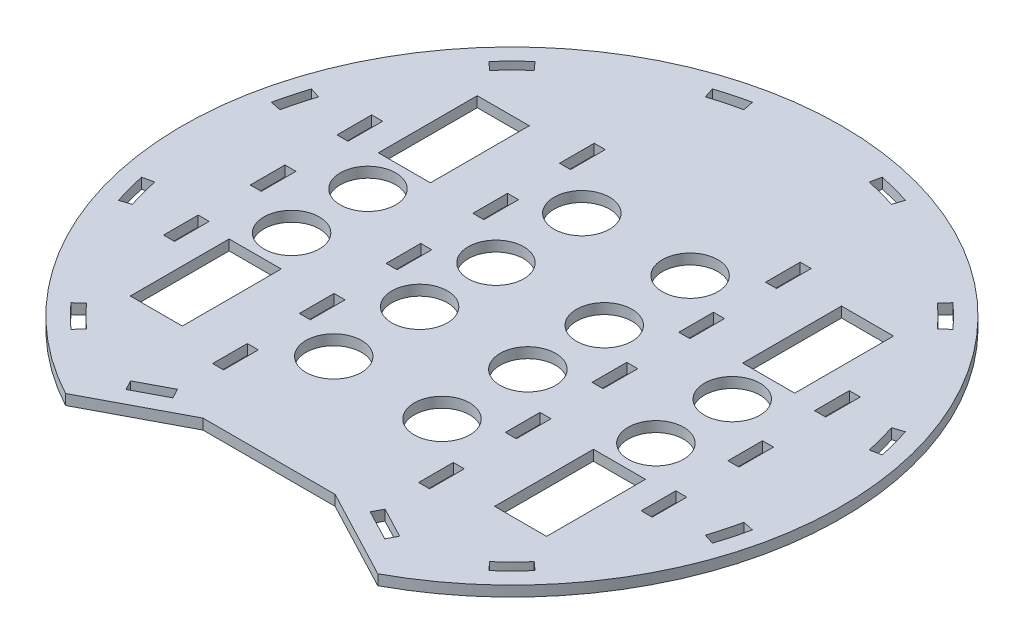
ISO-10303-21;
HEADER;
FILE_DESCRIPTION(('STEP AP214'),'2;1');
FILE_NAME('part.step','',(''),(''),'','','');
FILE_SCHEMA(('AUTOMOTIVE_DESIGN { 1 0 10303 214 1 1 1 1 }'));
ENDSEC;
DATA;
#1=APPLICATION_CONTEXT('core data for automotive mechanical design processes');
#2=APPLICATION_PROTOCOL_DEFINITION('international standard','automotive_design',2000,#1);
#3=PRODUCT_CONTEXT('',#1,'mechanical');
#4=PRODUCT('Part','Part','',(#3));
#5=PRODUCT_RELATED_PRODUCT_CATEGORY('part','',(#4));
#6=PRODUCT_DEFINITION_FORMATION('','',#4);
#7=PRODUCT_DEFINITION_CONTEXT('part definition',#1,'design');
#8=PRODUCT_DEFINITION('design','',#6,#7);
#9=PRODUCT_DEFINITION_SHAPE('','',#8);
#10=(LENGTH_UNIT() NAMED_UNIT(*) SI_UNIT(.MILLI.,.METRE.));
#11=(NAMED_UNIT(*) PLANE_ANGLE_UNIT() SI_UNIT($,.RADIAN.));
#12=(NAMED_UNIT(*) SI_UNIT($,.STERADIAN.) SOLID_ANGLE_UNIT());
#13=UNCERTAINTY_MEASURE_WITH_UNIT(LENGTH_MEASURE(1.E-05),#10,'distance_accuracy_value','');
#14=(GEOMETRIC_REPRESENTATION_CONTEXT(3) GLOBAL_UNCERTAINTY_ASSIGNED_CONTEXT((#13)) GLOBAL_UNIT_ASSIGNED_CONTEXT((#10,
#11,#12)) REPRESENTATION_CONTEXT('',''));
#15=CARTESIAN_POINT('',(0.,0.,0.));
#16=DIRECTION('',(0.,0.,1.));
#17=DIRECTION('',(1.,0.,0.));
#18=AXIS2_PLACEMENT_3D('',#15,#16,#17);
#19=CARTESIAN_POINT('',(0.,6.,0.));
#20=DIRECTION('',(-0.669130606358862,0.,-0.743144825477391));
#21=DIRECTION('',(-0.743144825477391,0.,0.669130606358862));
#22=AXIS2_PLACEMENT_3D('',#19,#20,#21);
#23=PLANE('',#22);
#24=DIRECTION('',(0.743144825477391,0.,-0.669130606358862));
#25=VECTOR('',#24,1.);
#26=CARTESIAN_POINT('',(0.,0.,0.));
#27=LINE('',#26,#25);
#28=CARTESIAN_POINT('',(129.047098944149,0.,-116.194529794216));
#29=VERTEX_POINT('',#28);
#30=CARTESIAN_POINT('',(133.766068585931,0.,-120.443509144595));
#31=VERTEX_POINT('',#30);
#32=EDGE_CURVE('E1299',#29,#31,#27,.T.);
#33=ORIENTED_EDGE('',*,*,#32,.F.);
#34=DIRECTION('',(0.,-1.,0.));
#35=VECTOR('',#34,1.);
#36=CARTESIAN_POINT('',(129.047098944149,6.,-116.194529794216));
#37=LINE('',#36,#35);
#38=CARTESIAN_POINT('',(129.047098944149,6.,-116.194529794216));
#39=VERTEX_POINT('',#38);
#40=EDGE_CURVE('E11',#39,#29,#37,.T.);
#41=ORIENTED_EDGE('',*,*,#40,.F.);
#42=DIRECTION('',(0.743144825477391,0.,-0.669130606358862));
#43=VECTOR('',#42,1.);
#44=CARTESIAN_POINT('',(0.,6.,0.));
#45=LINE('',#44,#43);
#46=CARTESIAN_POINT('',(133.766068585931,6.,-120.443509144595));
#47=VERTEX_POINT('',#46);
#48=EDGE_CURVE('E865',#39,#47,#45,.T.);
#49=ORIENTED_EDGE('',*,*,#48,.T.);
#50=DIRECTION('',(0.,-1.,0.));
#51=VECTOR('',#50,1.);
#52=CARTESIAN_POINT('',(133.766068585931,6.,-120.443509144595));
#53=LINE('',#52,#51);
#54=EDGE_CURVE('E60',#47,#31,#53,.T.);
#55=ORIENTED_EDGE('',*,*,#54,.T.);
#56=EDGE_LOOP('',(#33,#41,#49,#55));
#57=FACE_BOUND('',#56,.T.);
#58=ADVANCED_FACE('F41',(#57),#23,.T.);
#59=CARTESIAN_POINT('',(0.,6.,0.));
#60=DIRECTION('',(0.,-1.,0.));
#61=DIRECTION('',(0.,0.,-1.));
#62=AXIS2_PLACEMENT_3D('',#59,#60,#61);
#63=CYLINDRICAL_SURFACE('',#62,173.65);
#64=CARTESIAN_POINT('',(0.,0.,0.));
#65=DIRECTION('',(0.,1.,0.));
#66=DIRECTION('',(0.,0.,1.));
#67=AXIS2_PLACEMENT_3D('',#64,#65,#66);
#68=CIRCLE('',#67,173.65);
#69=CARTESIAN_POINT('',(116.194529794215,0.,-129.04709894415));
#70=VERTEX_POINT('',#69);
#71=EDGE_CURVE('E871',#29,#70,#68,.T.);
#72=ORIENTED_EDGE('',*,*,#71,.T.);
#73=DIRECTION('',(0.,-1.,0.));
#74=VECTOR('',#73,1.);
#75=CARTESIAN_POINT('',(116.194529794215,6.,-129.04709894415));
#76=LINE('',#75,#74);
#77=CARTESIAN_POINT('',(116.194529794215,6.,-129.04709894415));
#78=VERTEX_POINT('',#77);
#79=EDGE_CURVE('E51',#78,#70,#76,.T.);
#80=ORIENTED_EDGE('',*,*,#79,.F.);
#81=CARTESIAN_POINT('',(0.,6.,0.));
#82=DIRECTION('',(0.,1.,0.));
#83=DIRECTION('',(0.,0.,1.));
#84=AXIS2_PLACEMENT_3D('',#81,#82,#83);
#85=CIRCLE('',#84,173.65);
#86=EDGE_CURVE('E858',#39,#78,#85,.T.);
#87=ORIENTED_EDGE('',*,*,#86,.F.);
#88=ORIENTED_EDGE('',*,*,#40,.T.);
#89=EDGE_LOOP('',(#72,#80,#87,#88));
#90=FACE_BOUND('',#89,.T.);
#91=ADVANCED_FACE('F869',(#90),#63,.T.);
#92=CARTESIAN_POINT('',(-9.28188557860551E-13,6.,-8.35744731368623E-13));
#93=DIRECTION('',(0.743144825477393,0.,0.66913060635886));
#94=DIRECTION('',(0.66913060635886,0.,-0.743144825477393));
#95=AXIS2_PLACEMENT_3D('',#92,#93,#94);
#96=PLANE('',#95);
#97=DIRECTION('',(-0.66913060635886,0.,0.743144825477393));
#98=VECTOR('',#97,1.);
#99=CARTESIAN_POINT('',(-9.28188557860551E-13,0.,-8.35744731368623E-13));
#100=LINE('',#99,#98);
#101=CARTESIAN_POINT('',(120.443509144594,0.,-133.766068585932));
#102=VERTEX_POINT('',#101);
#103=EDGE_CURVE('E1302',#102,#70,#100,.T.);
#104=ORIENTED_EDGE('',*,*,#103,.F.);
#105=DIRECTION('',(0.,-1.,0.));
#106=VECTOR('',#105,1.);
#107=CARTESIAN_POINT('',(120.443509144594,6.,-133.766068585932));
#108=LINE('',#107,#106);
#109=CARTESIAN_POINT('',(120.443509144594,6.,-133.766068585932));
#110=VERTEX_POINT('',#109);
#111=EDGE_CURVE('E457',#110,#102,#108,.T.);
#112=ORIENTED_EDGE('',*,*,#111,.F.);
#113=DIRECTION('',(-0.66913060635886,0.,0.743144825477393));
#114=VECTOR('',#113,1.);
#115=CARTESIAN_POINT('',(-9.28188557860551E-13,6.,-8.35744731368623E-13));
#116=LINE('',#115,#114);
#117=EDGE_CURVE('E864',#110,#78,#116,.T.);
#118=ORIENTED_EDGE('',*,*,#117,.T.);
#119=ORIENTED_EDGE('',*,*,#79,.T.);
#120=EDGE_LOOP('',(#104,#112,#118,#119));
#121=FACE_BOUND('',#120,.T.);
#122=ADVANCED_FACE('F875',(#121),#96,.T.);
#123=CARTESIAN_POINT('',(0.,6.,2.17192397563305E-13));
#124=DIRECTION('',(-0.207911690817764,0.,-0.978147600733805));
#125=DIRECTION('',(-0.978147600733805,0.,0.207911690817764));
#126=AXIS2_PLACEMENT_3D('',#123,#124,#125);
#127=PLANE('',#126);
#128=DIRECTION('',(0.978147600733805,0.,-0.207911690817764));
#129=VECTOR('',#128,1.);
#130=CARTESIAN_POINT('',(0.,0.,2.17192397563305E-13));
#131=LINE('',#130,#129);
#132=CARTESIAN_POINT('',(169.855330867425,0.,-36.1038651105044));
#133=VERTEX_POINT('',#132);
#134=CARTESIAN_POINT('',(176.066568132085,0.,-37.4241043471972));
#135=VERTEX_POINT('',#134);
#136=EDGE_CURVE('E1287',#133,#135,#131,.T.);
#137=ORIENTED_EDGE('',*,*,#136,.F.);
#138=DIRECTION('',(0.,-1.,0.));
#139=VECTOR('',#138,1.);
#140=CARTESIAN_POINT('',(169.855330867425,6.,-36.1038651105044));
#141=LINE('',#140,#139);
#142=CARTESIAN_POINT('',(169.855330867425,6.,-36.1038651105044));
#143=VERTEX_POINT('',#142);
#144=EDGE_CURVE('E1315',#143,#133,#141,.T.);
#145=ORIENTED_EDGE('',*,*,#144,.F.);
#146=DIRECTION('',(0.978147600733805,0.,-0.207911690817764));
#147=VECTOR('',#146,1.);
#148=CARTESIAN_POINT('',(0.,6.,2.17192397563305E-13));
#149=LINE('',#148,#147);
#150=CARTESIAN_POINT('',(176.066568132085,6.,-37.4241043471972));
#151=VERTEX_POINT('',#150);
#152=EDGE_CURVE('E1971',#143,#151,#149,.T.);
#153=ORIENTED_EDGE('',*,*,#152,.T.);
#154=DIRECTION('',(0.,-1.,0.));
#155=VECTOR('',#154,1.);
#156=CARTESIAN_POINT('',(176.066568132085,6.,-37.4241043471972));
#157=LINE('',#156,#155);
#158=EDGE_CURVE('E1317',#151,#135,#157,.T.);
#159=ORIENTED_EDGE('',*,*,#158,.T.);
#160=EDGE_LOOP('',(#137,#145,#153,#159));
#161=FACE_BOUND('',#160,.T.);
#162=ADVANCED_FACE('F2011',(#161),#127,.T.);
#163=CARTESIAN_POINT('',(0.,6.,0.));
#164=DIRECTION('',(0.,-1.,0.));
#165=DIRECTION('',(0.,0.,-1.));
#166=AXIS2_PLACEMENT_3D('',#163,#164,#165);
#167=CYLINDRICAL_SURFACE('',#166,173.65);
#168=CARTESIAN_POINT('',(0.,0.,0.));
#169=DIRECTION('',(0.,1.,0.));
#170=DIRECTION('',(0.,0.,1.));
#171=AXIS2_PLACEMENT_3D('',#168,#169,#170);
#172=CIRCLE('',#171,173.65);
#173=CARTESIAN_POINT('',(165.150964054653,0.,-53.6608010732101));
#174=VERTEX_POINT('',#173);
#175=EDGE_CURVE('E1290',#133,#174,#172,.T.);
#176=ORIENTED_EDGE('',*,*,#175,.T.);
#177=DIRECTION('',(0.,-1.,0.));
#178=VECTOR('',#177,1.);
#179=CARTESIAN_POINT('',(165.150964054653,6.,-53.6608010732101));
#180=LINE('',#179,#178);
#181=CARTESIAN_POINT('',(165.150964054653,6.,-53.6608010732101));
#182=VERTEX_POINT('',#181);
#183=EDGE_CURVE('E1322',#182,#174,#180,.T.);
#184=ORIENTED_EDGE('',*,*,#183,.F.);
#185=CARTESIAN_POINT('',(0.,6.,0.));
#186=DIRECTION('',(0.,1.,0.));
#187=DIRECTION('',(0.,0.,1.));
#188=AXIS2_PLACEMENT_3D('',#185,#186,#187);
#189=CIRCLE('',#188,173.65);
#190=EDGE_CURVE('E1974',#143,#182,#189,.T.);
#191=ORIENTED_EDGE('',*,*,#190,.F.);
#192=ORIENTED_EDGE('',*,*,#144,.T.);
#193=EDGE_LOOP('',(#176,#184,#191,#192));
#194=FACE_BOUND('',#193,.T.);
#195=ADVANCED_FACE('F2007',(#194),#167,.T.);
#196=CARTESIAN_POINT('',(2.74891072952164E-12,6.,8.46027729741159E-12));
#197=DIRECTION('',(0.309016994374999,0.,0.951056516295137));
#198=DIRECTION('',(0.951056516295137,0.,-0.309016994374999));
#199=AXIS2_PLACEMENT_3D('',#196,#197,#198);
#200=PLANE('',#199);
#201=DIRECTION('',(-0.951056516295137,0.,0.309016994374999));
#202=VECTOR('',#201,1.);
#203=CARTESIAN_POINT('',(2.74891072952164E-12,0.,8.46027729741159E-12));
#204=LINE('',#203,#202);
#205=CARTESIAN_POINT('',(171.190172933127,0.,-55.6230589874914));
#206=VERTEX_POINT('',#205);
#207=EDGE_CURVE('E1293',#206,#174,#204,.T.);
#208=ORIENTED_EDGE('',*,*,#207,.F.);
#209=DIRECTION('',(0.,-1.,0.));
#210=VECTOR('',#209,1.);
#211=CARTESIAN_POINT('',(171.190172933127,6.,-55.6230589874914));
#212=LINE('',#211,#210);
#213=CARTESIAN_POINT('',(171.190172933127,6.,-55.6230589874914));
#214=VERTEX_POINT('',#213);
#215=EDGE_CURVE('E1319',#214,#206,#212,.T.);
#216=ORIENTED_EDGE('',*,*,#215,.F.);
#217=DIRECTION('',(-0.951056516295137,0.,0.309016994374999));
#218=VECTOR('',#217,1.);
#219=CARTESIAN_POINT('',(2.74891072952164E-12,6.,8.46027729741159E-12));
#220=LINE('',#219,#218);
#221=EDGE_CURVE('E1976',#214,#182,#220,.T.);
#222=ORIENTED_EDGE('',*,*,#221,.T.);
#223=ORIENTED_EDGE('',*,*,#183,.T.);
#224=EDGE_LOOP('',(#208,#216,#222,#223));
#225=FACE_BOUND('',#224,.T.);
#226=ADVANCED_FACE('F2003',(#225),#200,.T.);
#227=CARTESIAN_POINT('',(-3.50649010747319E-13,6.,3.15725787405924E-13));
#228=DIRECTION('',(0.743144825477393,0.,-0.66913060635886));
#229=DIRECTION('',(-0.66913060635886,0.,-0.743144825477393));
#230=AXIS2_PLACEMENT_3D('',#227,#228,#229);
#231=PLANE('',#230);
#232=DIRECTION('',(0.66913060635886,0.,0.743144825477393));
#233=VECTOR('',#232,1.);
#234=CARTESIAN_POINT('',(-3.50649010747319E-13,0.,3.15725787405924E-13));
#235=LINE('',#234,#233);
#236=CARTESIAN_POINT('',(116.194529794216,0.,129.04709894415));
#237=VERTEX_POINT('',#236);
#238=CARTESIAN_POINT('',(120.443509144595,0.,133.766068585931));
#239=VERTEX_POINT('',#238);
#240=EDGE_CURVE('E1275',#237,#239,#235,.T.);
#241=ORIENTED_EDGE('',*,*,#240,.F.);
#242=DIRECTION('',(0.,-1.,0.));
#243=VECTOR('',#242,1.);
#244=CARTESIAN_POINT('',(116.194529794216,6.,129.04709894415));
#245=LINE('',#244,#243);
#246=CARTESIAN_POINT('',(116.194529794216,6.,129.04709894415));
#247=VERTEX_POINT('',#246);
#248=EDGE_CURVE('E1320',#247,#237,#245,.T.);
#249=ORIENTED_EDGE('',*,*,#248,.F.);
#250=DIRECTION('',(0.66913060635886,0.,0.743144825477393));
#251=VECTOR('',#250,1.);
#252=CARTESIAN_POINT('',(-3.50649010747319E-13,6.,3.15725787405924E-13));
#253=LINE('',#252,#251);
#254=CARTESIAN_POINT('',(120.443509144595,6.,133.766068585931));
#255=VERTEX_POINT('',#254);
#256=EDGE_CURVE('E1960',#247,#255,#253,.T.);
#257=ORIENTED_EDGE('',*,*,#256,.T.);
#258=DIRECTION('',(0.,-1.,0.));
#259=VECTOR('',#258,1.);
#260=CARTESIAN_POINT('',(120.443509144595,6.,133.766068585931));
#261=LINE('',#260,#259);
#262=EDGE_CURVE('E1325',#255,#239,#261,.T.);
#263=ORIENTED_EDGE('',*,*,#262,.T.);
#264=EDGE_LOOP('',(#241,#249,#257,#263));
#265=FACE_BOUND('',#264,.T.);
#266=ADVANCED_FACE('F2006',(#265),#231,.T.);
#267=CARTESIAN_POINT('',(0.,6.,0.));
#268=DIRECTION('',(0.,-1.,0.));
#269=DIRECTION('',(0.,0.,-1.));
#270=AXIS2_PLACEMENT_3D('',#267,#268,#269);
#271=CYLINDRICAL_SURFACE('',#270,173.65);
#272=CARTESIAN_POINT('',(0.,0.,0.));
#273=DIRECTION('',(0.,1.,0.));
#274=DIRECTION('',(0.,0.,1.));
#275=AXIS2_PLACEMENT_3D('',#272,#273,#274);
#276=CIRCLE('',#275,173.65);
#277=CARTESIAN_POINT('',(129.047098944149,0.,116.194529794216));
#278=VERTEX_POINT('',#277);
#279=EDGE_CURVE('E1278',#237,#278,#276,.T.);
#280=ORIENTED_EDGE('',*,*,#279,.T.);
#281=DIRECTION('',(0.,-1.,0.));
#282=VECTOR('',#281,1.);
#283=CARTESIAN_POINT('',(129.047098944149,6.,116.194529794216));
#284=LINE('',#283,#282);
#285=CARTESIAN_POINT('',(129.047098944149,6.,116.194529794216));
#286=VERTEX_POINT('',#285);
#287=EDGE_CURVE('E1330',#286,#278,#284,.T.);
#288=ORIENTED_EDGE('',*,*,#287,.F.);
#289=CARTESIAN_POINT('',(0.,6.,0.));
#290=DIRECTION('',(0.,1.,0.));
#291=DIRECTION('',(0.,0.,1.));
#292=AXIS2_PLACEMENT_3D('',#289,#290,#291);
#293=CIRCLE('',#292,173.65);
#294=EDGE_CURVE('E1963',#247,#286,#293,.T.);
#295=ORIENTED_EDGE('',*,*,#294,.F.);
#296=ORIENTED_EDGE('',*,*,#248,.T.);
#297=EDGE_LOOP('',(#280,#288,#295,#296));
#298=FACE_BOUND('',#297,.T.);
#299=ADVANCED_FACE('F2024',(#298),#271,.T.);
#300=CARTESIAN_POINT('',(-5.55305943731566E-12,6.,6.16729730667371E-12));
#301=DIRECTION('',(-0.669130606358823,0.,0.743144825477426));
#302=DIRECTION('',(0.743144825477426,0.,0.669130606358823));
#303=AXIS2_PLACEMENT_3D('',#300,#301,#302);
#304=PLANE('',#303);
#305=DIRECTION('',(-0.743144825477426,0.,-0.669130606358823));
#306=VECTOR('',#305,1.);
#307=CARTESIAN_POINT('',(-5.55305943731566E-12,0.,6.16729730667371E-12));
#308=LINE('',#307,#306);
#309=CARTESIAN_POINT('',(133.766068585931,0.,120.443509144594));
#310=VERTEX_POINT('',#309);
#311=EDGE_CURVE('E1281',#310,#278,#308,.T.);
#312=ORIENTED_EDGE('',*,*,#311,.F.);
#313=DIRECTION('',(0.,-1.,0.));
#314=VECTOR('',#313,1.);
#315=CARTESIAN_POINT('',(133.766068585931,6.,120.443509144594));
#316=LINE('',#315,#314);
#317=CARTESIAN_POINT('',(133.766068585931,6.,120.443509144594));
#318=VERTEX_POINT('',#317);
#319=EDGE_CURVE('E1327',#318,#310,#316,.T.);
#320=ORIENTED_EDGE('',*,*,#319,.F.);
#321=DIRECTION('',(-0.743144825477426,0.,-0.669130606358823));
#322=VECTOR('',#321,1.);
#323=CARTESIAN_POINT('',(-5.55305943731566E-12,6.,6.16729730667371E-12));
#324=LINE('',#323,#322);
#325=EDGE_CURVE('E1965',#318,#286,#324,.T.);
#326=ORIENTED_EDGE('',*,*,#325,.T.);
#327=ORIENTED_EDGE('',*,*,#287,.T.);
#328=EDGE_LOOP('',(#312,#320,#326,#327));
#329=FACE_BOUND('',#328,.T.);
#330=ADVANCED_FACE('F2020',(#329),#304,.T.);
#331=CARTESIAN_POINT('',(62.5533280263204,6.,0.));
#332=DIRECTION('',(-1.,0.,0.));
#333=DIRECTION('',(0.,0.,1.));
#334=AXIS2_PLACEMENT_3D('',#331,#332,#333);
#335=PLANE('',#334);
#336=DIRECTION('',(0.,0.,-1.));
#337=VECTOR('',#336,1.);
#338=CARTESIAN_POINT('',(62.5533280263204,0.,0.));
#339=LINE('',#338,#337);
#340=CARTESIAN_POINT('',(62.5533280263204,0.,-40.));
#341=VERTEX_POINT('',#340);
#342=CARTESIAN_POINT('',(62.5533280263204,0.,-60.));
#343=VERTEX_POINT('',#342);
#344=EDGE_CURVE('E1263',#341,#343,#339,.T.);
#345=ORIENTED_EDGE('',*,*,#344,.F.);
#346=DIRECTION('',(0.,-1.,0.));
#347=VECTOR('',#346,1.);
#348=CARTESIAN_POINT('',(62.5533280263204,6.,-40.));
#349=LINE('',#348,#347);
#350=CARTESIAN_POINT('',(62.5533280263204,6.,-40.));
#351=VERTEX_POINT('',#350);
#352=EDGE_CURVE('E1328',#351,#341,#349,.T.);
#353=ORIENTED_EDGE('',*,*,#352,.F.);
#354=DIRECTION('',(0.,0.,-1.));
#355=VECTOR('',#354,1.);
#356=CARTESIAN_POINT('',(62.5533280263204,6.,0.));
#357=LINE('',#356,#355);
#358=CARTESIAN_POINT('',(62.5533280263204,6.,-60.));
#359=VERTEX_POINT('',#358);
#360=EDGE_CURVE('E1949',#351,#359,#357,.T.);
#361=ORIENTED_EDGE('',*,*,#360,.T.);
#362=DIRECTION('',(0.,-1.,0.));
#363=VECTOR('',#362,1.);
#364=CARTESIAN_POINT('',(62.5533280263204,6.,-60.));
#365=LINE('',#364,#363);
#366=EDGE_CURVE('E1333',#359,#343,#365,.T.);
#367=ORIENTED_EDGE('',*,*,#366,.T.);
#368=EDGE_LOOP('',(#345,#353,#361,#367));
#369=FACE_BOUND('',#368,.T.);
#370=ADVANCED_FACE('F2023',(#369),#335,.T.);
#371=CARTESIAN_POINT('',(0.,6.,-40.));
#372=DIRECTION('',(0.,0.,1.));
#373=DIRECTION('',(1.,0.,0.));
#374=AXIS2_PLACEMENT_3D('',#371,#372,#373);
#375=PLANE('',#374);
#376=DIRECTION('',(-1.,0.,0.));
#377=VECTOR('',#376,1.);
#378=CARTESIAN_POINT('',(0.,0.,-40.));
#379=LINE('',#378,#377);
#380=CARTESIAN_POINT('',(56.2033280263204,0.,-40.));
#381=VERTEX_POINT('',#380);
#382=EDGE_CURVE('E1266',#341,#381,#379,.T.);
#383=ORIENTED_EDGE('',*,*,#382,.T.);
#384=DIRECTION('',(0.,-1.,0.));
#385=VECTOR('',#384,1.);
#386=CARTESIAN_POINT('',(56.2033280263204,6.,-40.));
#387=LINE('',#386,#385);
#388=CARTESIAN_POINT('',(56.2033280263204,6.,-40.));
#389=VERTEX_POINT('',#388);
#390=EDGE_CURVE('E1338',#389,#381,#387,.T.);
#391=ORIENTED_EDGE('',*,*,#390,.F.);
#392=DIRECTION('',(-1.,0.,0.));
#393=VECTOR('',#392,1.);
#394=CARTESIAN_POINT('',(0.,6.,-40.));
#395=LINE('',#394,#393);
#396=EDGE_CURVE('E1952',#351,#389,#395,.T.);
#397=ORIENTED_EDGE('',*,*,#396,.F.);
#398=ORIENTED_EDGE('',*,*,#352,.T.);
#399=EDGE_LOOP('',(#383,#391,#397,#398));
#400=FACE_BOUND('',#399,.T.);
#401=ADVANCED_FACE('F2040',(#400),#375,.F.);
#402=CARTESIAN_POINT('',(56.2033280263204,6.,0.));
#403=DIRECTION('',(-1.,0.,0.));
#404=DIRECTION('',(0.,0.,1.));
#405=AXIS2_PLACEMENT_3D('',#402,#403,#404);
#406=PLANE('',#405);
#407=DIRECTION('',(0.,0.,-1.));
#408=VECTOR('',#407,1.);
#409=CARTESIAN_POINT('',(56.2033280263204,0.,0.));
#410=LINE('',#409,#408);
#411=CARTESIAN_POINT('',(56.2033280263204,0.,-60.));
#412=VERTEX_POINT('',#411);
#413=EDGE_CURVE('E1269',#381,#412,#410,.T.);
#414=ORIENTED_EDGE('',*,*,#413,.T.);
#415=DIRECTION('',(0.,-1.,0.));
#416=VECTOR('',#415,1.);
#417=CARTESIAN_POINT('',(56.2033280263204,6.,-60.));
#418=LINE('',#417,#416);
#419=CARTESIAN_POINT('',(56.2033280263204,6.,-60.));
#420=VERTEX_POINT('',#419);
#421=EDGE_CURVE('E1335',#420,#412,#418,.T.);
#422=ORIENTED_EDGE('',*,*,#421,.F.);
#423=DIRECTION('',(0.,0.,-1.));
#424=VECTOR('',#423,1.);
#425=CARTESIAN_POINT('',(56.2033280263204,6.,0.));
#426=LINE('',#425,#424);
#427=EDGE_CURVE('E1955',#389,#420,#426,.T.);
#428=ORIENTED_EDGE('',*,*,#427,.F.);
#429=ORIENTED_EDGE('',*,*,#390,.T.);
#430=EDGE_LOOP('',(#414,#422,#428,#429));
#431=FACE_BOUND('',#430,.T.);
#432=ADVANCED_FACE('F2036',(#431),#406,.F.);
#433=CARTESIAN_POINT('',(56.2033280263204,6.,0.));
#434=DIRECTION('',(1.,0.,0.));
#435=DIRECTION('',(0.,0.,-1.));
#436=AXIS2_PLACEMENT_3D('',#433,#434,#435);
#437=PLANE('',#436);
#438=DIRECTION('',(0.,0.,1.));
#439=VECTOR('',#438,1.);
#440=CARTESIAN_POINT('',(56.2033280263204,0.,0.));
#441=LINE('',#440,#439);
#442=CARTESIAN_POINT('',(56.2033280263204,0.,-10.));
#443=VERTEX_POINT('',#442);
#444=CARTESIAN_POINT('',(56.2033280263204,0.,10.));
#445=VERTEX_POINT('',#444);
#446=EDGE_CURVE('E1251',#443,#445,#441,.T.);
#447=ORIENTED_EDGE('',*,*,#446,.F.);
#448=DIRECTION('',(0.,-1.,0.));
#449=VECTOR('',#448,1.);
#450=CARTESIAN_POINT('',(56.2033280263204,6.,-10.));
#451=LINE('',#450,#449);
#452=CARTESIAN_POINT('',(56.2033280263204,6.,-10.));
#453=VERTEX_POINT('',#452);
#454=EDGE_CURVE('E1336',#453,#443,#451,.T.);
#455=ORIENTED_EDGE('',*,*,#454,.F.);
#456=DIRECTION('',(0.,0.,1.));
#457=VECTOR('',#456,1.);
#458=CARTESIAN_POINT('',(56.2033280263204,6.,0.));
#459=LINE('',#458,#457);
#460=CARTESIAN_POINT('',(56.2033280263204,6.,10.));
#461=VERTEX_POINT('',#460);
#462=EDGE_CURVE('E1938',#453,#461,#459,.T.);
#463=ORIENTED_EDGE('',*,*,#462,.T.);
#464=DIRECTION('',(0.,-1.,0.));
#465=VECTOR('',#464,1.);
#466=CARTESIAN_POINT('',(56.2033280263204,6.,10.));
#467=LINE('',#466,#465);
#468=EDGE_CURVE('E1342',#461,#445,#467,.T.);
#469=ORIENTED_EDGE('',*,*,#468,.T.);
#470=EDGE_LOOP('',(#447,#455,#463,#469));
#471=FACE_BOUND('',#470,.T.);
#472=ADVANCED_FACE('F2039',(#471),#437,.T.);
#473=CARTESIAN_POINT('',(0.,6.,-9.99999999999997));
#474=DIRECTION('',(0.,0.,-1.));
#475=DIRECTION('',(-1.,0.,0.));
#476=AXIS2_PLACEMENT_3D('',#473,#474,#475);
#477=PLANE('',#476);
#478=DIRECTION('',(1.,0.,0.));
#479=VECTOR('',#478,1.);
#480=CARTESIAN_POINT('',(0.,0.,-9.99999999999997));
#481=LINE('',#480,#479);
#482=CARTESIAN_POINT('',(62.5533280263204,0.,-10.));
#483=VERTEX_POINT('',#482);
#484=EDGE_CURVE('E1254',#443,#483,#481,.T.);
#485=ORIENTED_EDGE('',*,*,#484,.T.);
#486=DIRECTION('',(0.,-1.,0.));
#487=VECTOR('',#486,1.);
#488=CARTESIAN_POINT('',(62.5533280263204,6.,-10.));
#489=LINE('',#488,#487);
#490=CARTESIAN_POINT('',(62.5533280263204,6.,-10.));
#491=VERTEX_POINT('',#490);
#492=EDGE_CURVE('E1347',#491,#483,#489,.T.);
#493=ORIENTED_EDGE('',*,*,#492,.F.);
#494=DIRECTION('',(1.,0.,0.));
#495=VECTOR('',#494,1.);
#496=CARTESIAN_POINT('',(0.,6.,-9.99999999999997));
#497=LINE('',#496,#495);
#498=EDGE_CURVE('E1941',#453,#491,#497,.T.);
#499=ORIENTED_EDGE('',*,*,#498,.F.);
#500=ORIENTED_EDGE('',*,*,#454,.T.);
#501=EDGE_LOOP('',(#485,#493,#499,#500));
#502=FACE_BOUND('',#501,.T.);
#503=ADVANCED_FACE('F2056',(#502),#477,.F.);
#504=CARTESIAN_POINT('',(62.5533280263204,6.,0.));
#505=DIRECTION('',(1.,0.,0.));
#506=DIRECTION('',(0.,0.,-1.));
#507=AXIS2_PLACEMENT_3D('',#504,#505,#506);
#508=PLANE('',#507);
#509=DIRECTION('',(0.,0.,1.));
#510=VECTOR('',#509,1.);
#511=CARTESIAN_POINT('',(62.5533280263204,0.,0.));
#512=LINE('',#511,#510);
#513=CARTESIAN_POINT('',(62.5533280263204,0.,9.99999999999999));
#514=VERTEX_POINT('',#513);
#515=EDGE_CURVE('E1257',#483,#514,#512,.T.);
#516=ORIENTED_EDGE('',*,*,#515,.T.);
#517=DIRECTION('',(0.,-1.,0.));
#518=VECTOR('',#517,1.);
#519=CARTESIAN_POINT('',(62.5533280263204,6.,9.99999999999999));
#520=LINE('',#519,#518);
#521=CARTESIAN_POINT('',(62.5533280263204,6.,9.99999999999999));
#522=VERTEX_POINT('',#521);
#523=EDGE_CURVE('E1344',#522,#514,#520,.T.);
#524=ORIENTED_EDGE('',*,*,#523,.F.);
#525=DIRECTION('',(0.,0.,1.));
#526=VECTOR('',#525,1.);
#527=CARTESIAN_POINT('',(62.5533280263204,6.,0.));
#528=LINE('',#527,#526);
#529=EDGE_CURVE('E1944',#491,#522,#528,.T.);
#530=ORIENTED_EDGE('',*,*,#529,.F.);
#531=ORIENTED_EDGE('',*,*,#492,.T.);
#532=EDGE_LOOP('',(#516,#524,#530,#531));
#533=FACE_BOUND('',#532,.T.);
#534=ADVANCED_FACE('F2052',(#533),#508,.F.);
#535=CARTESIAN_POINT('',(62.5533280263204,6.,0.));
#536=DIRECTION('',(-1.,0.,0.));
#537=DIRECTION('',(0.,0.,1.));
#538=AXIS2_PLACEMENT_3D('',#535,#536,#537);
#539=PLANE('',#538);
#540=DIRECTION('',(0.,0.,-1.));
#541=VECTOR('',#540,1.);
#542=CARTESIAN_POINT('',(62.5533280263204,0.,0.));
#543=LINE('',#542,#541);
#544=CARTESIAN_POINT('',(62.5533280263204,0.,-90.));
#545=VERTEX_POINT('',#544);
#546=CARTESIAN_POINT('',(62.5533280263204,0.,-110.));
#547=VERTEX_POINT('',#546);
#548=EDGE_CURVE('E1239',#545,#547,#543,.T.);
#549=ORIENTED_EDGE('',*,*,#548,.F.);
#550=DIRECTION('',(0.,-1.,0.));
#551=VECTOR('',#550,1.);
#552=CARTESIAN_POINT('',(62.5533280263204,6.,-90.));
#553=LINE('',#552,#551);
#554=CARTESIAN_POINT('',(62.5533280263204,6.,-90.));
#555=VERTEX_POINT('',#554);
#556=EDGE_CURVE('E1345',#555,#545,#553,.T.);
#557=ORIENTED_EDGE('',*,*,#556,.F.);
#558=DIRECTION('',(0.,0.,-1.));
#559=VECTOR('',#558,1.);
#560=CARTESIAN_POINT('',(62.5533280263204,6.,0.));
#561=LINE('',#560,#559);
#562=CARTESIAN_POINT('',(62.5533280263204,6.,-110.));
#563=VERTEX_POINT('',#562);
#564=EDGE_CURVE('E1927',#555,#563,#561,.T.);
#565=ORIENTED_EDGE('',*,*,#564,.T.);
#566=DIRECTION('',(0.,-1.,0.));
#567=VECTOR('',#566,1.);
#568=CARTESIAN_POINT('',(62.5533280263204,6.,-110.));
#569=LINE('',#568,#567);
#570=EDGE_CURVE('E1351',#563,#547,#569,.T.);
#571=ORIENTED_EDGE('',*,*,#570,.T.);
#572=EDGE_LOOP('',(#549,#557,#565,#571));
#573=FACE_BOUND('',#572,.T.);
#574=ADVANCED_FACE('F2055',(#573),#539,.T.);
#575=CARTESIAN_POINT('',(0.,6.,-90.));
#576=DIRECTION('',(0.,0.,1.));
#577=DIRECTION('',(1.,0.,0.));
#578=AXIS2_PLACEMENT_3D('',#575,#576,#577);
#579=PLANE('',#578);
#580=DIRECTION('',(-1.,0.,0.));
#581=VECTOR('',#580,1.);
#582=CARTESIAN_POINT('',(0.,0.,-90.));
#583=LINE('',#582,#581);
#584=CARTESIAN_POINT('',(56.2033280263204,0.,-90.));
#585=VERTEX_POINT('',#584);
#586=EDGE_CURVE('E1242',#545,#585,#583,.T.);
#587=ORIENTED_EDGE('',*,*,#586,.T.);
#588=DIRECTION('',(0.,-1.,0.));
#589=VECTOR('',#588,1.);
#590=CARTESIAN_POINT('',(56.2033280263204,6.,-90.));
#591=LINE('',#590,#589);
#592=CARTESIAN_POINT('',(56.2033280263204,6.,-90.));
#593=VERTEX_POINT('',#592);
#594=EDGE_CURVE('E1356',#593,#585,#591,.T.);
#595=ORIENTED_EDGE('',*,*,#594,.F.);
#596=DIRECTION('',(-1.,0.,0.));
#597=VECTOR('',#596,1.);
#598=CARTESIAN_POINT('',(0.,6.,-90.));
#599=LINE('',#598,#597);
#600=EDGE_CURVE('E1930',#555,#593,#599,.T.);
#601=ORIENTED_EDGE('',*,*,#600,.F.);
#602=ORIENTED_EDGE('',*,*,#556,.T.);
#603=EDGE_LOOP('',(#587,#595,#601,#602));
#604=FACE_BOUND('',#603,.T.);
#605=ADVANCED_FACE('F2072',(#604),#579,.F.);
#606=CARTESIAN_POINT('',(56.2033280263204,6.,0.));
#607=DIRECTION('',(-1.,0.,0.));
#608=DIRECTION('',(0.,0.,1.));
#609=AXIS2_PLACEMENT_3D('',#606,#607,#608);
#610=PLANE('',#609);
#611=DIRECTION('',(0.,0.,-1.));
#612=VECTOR('',#611,1.);
#613=CARTESIAN_POINT('',(56.2033280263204,0.,0.));
#614=LINE('',#613,#612);
#615=CARTESIAN_POINT('',(56.2033280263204,0.,-110.));
#616=VERTEX_POINT('',#615);
#617=EDGE_CURVE('E1245',#585,#616,#614,.T.);
#618=ORIENTED_EDGE('',*,*,#617,.T.);
#619=DIRECTION('',(0.,-1.,0.));
#620=VECTOR('',#619,1.);
#621=CARTESIAN_POINT('',(56.2033280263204,6.,-110.));
#622=LINE('',#621,#620);
#623=CARTESIAN_POINT('',(56.2033280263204,6.,-110.));
#624=VERTEX_POINT('',#623);
#625=EDGE_CURVE('E1353',#624,#616,#622,.T.);
#626=ORIENTED_EDGE('',*,*,#625,.F.);
#627=DIRECTION('',(0.,0.,-1.));
#628=VECTOR('',#627,1.);
#629=CARTESIAN_POINT('',(56.2033280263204,6.,0.));
#630=LINE('',#629,#628);
#631=EDGE_CURVE('E1933',#593,#624,#630,.T.);
#632=ORIENTED_EDGE('',*,*,#631,.F.);
#633=ORIENTED_EDGE('',*,*,#594,.T.);
#634=EDGE_LOOP('',(#618,#626,#632,#633));
#635=FACE_BOUND('',#634,.T.);
#636=ADVANCED_FACE('F2068',(#635),#610,.F.);
#637=CARTESIAN_POINT('',(0.,6.,90.));
#638=DIRECTION('',(0.,0.,1.));
#639=DIRECTION('',(1.,0.,0.));
#640=AXIS2_PLACEMENT_3D('',#637,#638,#639);
#641=PLANE('',#640);
#642=DIRECTION('',(-1.,0.,0.));
#643=VECTOR('',#642,1.);
#644=CARTESIAN_POINT('',(0.,0.,90.));
#645=LINE('',#644,#643);
#646=CARTESIAN_POINT('',(62.5533280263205,0.,90.));
#647=VERTEX_POINT('',#646);
#648=CARTESIAN_POINT('',(56.2033280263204,0.,90.));
#649=VERTEX_POINT('',#648);
#650=EDGE_CURVE('E1227',#647,#649,#645,.T.);
#651=ORIENTED_EDGE('',*,*,#650,.F.);
#652=DIRECTION('',(0.,-1.,0.));
#653=VECTOR('',#652,1.);
#654=CARTESIAN_POINT('',(62.5533280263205,6.,90.));
#655=LINE('',#654,#653);
#656=CARTESIAN_POINT('',(62.5533280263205,6.,90.));
#657=VERTEX_POINT('',#656);
#658=EDGE_CURVE('E1354',#657,#647,#655,.T.);
#659=ORIENTED_EDGE('',*,*,#658,.F.);
#660=DIRECTION('',(-1.,0.,0.));
#661=VECTOR('',#660,1.);
#662=CARTESIAN_POINT('',(0.,6.,90.));
#663=LINE('',#662,#661);
#664=CARTESIAN_POINT('',(56.2033280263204,6.,90.));
#665=VERTEX_POINT('',#664);
#666=EDGE_CURVE('E1916',#657,#665,#663,.T.);
#667=ORIENTED_EDGE('',*,*,#666,.T.);
#668=DIRECTION('',(0.,-1.,0.));
#669=VECTOR('',#668,1.);
#670=CARTESIAN_POINT('',(56.2033280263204,6.,90.));
#671=LINE('',#670,#669);
#672=EDGE_CURVE('E1360',#665,#649,#671,.T.);
#673=ORIENTED_EDGE('',*,*,#672,.T.);
#674=EDGE_LOOP('',(#651,#659,#667,#673));
#675=FACE_BOUND('',#674,.T.);
#676=ADVANCED_FACE('F2071',(#675),#641,.T.);
#677=CARTESIAN_POINT('',(62.5533280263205,6.,0.));
#678=DIRECTION('',(1.,0.,0.));
#679=DIRECTION('',(0.,0.,-1.));
#680=AXIS2_PLACEMENT_3D('',#677,#678,#679);
#681=PLANE('',#680);
#682=DIRECTION('',(0.,0.,1.));
#683=VECTOR('',#682,1.);
#684=CARTESIAN_POINT('',(62.5533280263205,0.,0.));
#685=LINE('',#684,#683);
#686=CARTESIAN_POINT('',(62.5533280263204,0.,110.));
#687=VERTEX_POINT('',#686);
#688=EDGE_CURVE('E1230',#647,#687,#685,.T.);
#689=ORIENTED_EDGE('',*,*,#688,.T.);
#690=DIRECTION('',(0.,-1.,0.));
#691=VECTOR('',#690,1.);
#692=CARTESIAN_POINT('',(62.5533280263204,6.,110.));
#693=LINE('',#692,#691);
#694=CARTESIAN_POINT('',(62.5533280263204,6.,110.));
#695=VERTEX_POINT('',#694);
#696=EDGE_CURVE('E1365',#695,#687,#693,.T.);
#697=ORIENTED_EDGE('',*,*,#696,.F.);
#698=DIRECTION('',(0.,0.,1.));
#699=VECTOR('',#698,1.);
#700=CARTESIAN_POINT('',(62.5533280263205,6.,0.));
#701=LINE('',#700,#699);
#702=EDGE_CURVE('E1919',#657,#695,#701,.T.);
#703=ORIENTED_EDGE('',*,*,#702,.F.);
#704=ORIENTED_EDGE('',*,*,#658,.T.);
#705=EDGE_LOOP('',(#689,#697,#703,#704));
#706=FACE_BOUND('',#705,.T.);
#707=ADVANCED_FACE('F2088',(#706),#681,.F.);
#708=CARTESIAN_POINT('',(0.,6.,110.));
#709=DIRECTION('',(0.,0.,1.));
#710=DIRECTION('',(1.,0.,0.));
#711=AXIS2_PLACEMENT_3D('',#708,#709,#710);
#712=PLANE('',#711);
#713=DIRECTION('',(-1.,0.,0.));
#714=VECTOR('',#713,1.);
#715=CARTESIAN_POINT('',(0.,0.,110.));
#716=LINE('',#715,#714);
#717=CARTESIAN_POINT('',(56.2033280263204,0.,110.));
#718=VERTEX_POINT('',#717);
#719=EDGE_CURVE('E1233',#687,#718,#716,.T.);
#720=ORIENTED_EDGE('',*,*,#719,.T.);
#721=DIRECTION('',(0.,-1.,0.));
#722=VECTOR('',#721,1.);
#723=CARTESIAN_POINT('',(56.2033280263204,6.,110.));
#724=LINE('',#723,#722);
#725=CARTESIAN_POINT('',(56.2033280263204,6.,110.));
#726=VERTEX_POINT('',#725);
#727=EDGE_CURVE('E1362',#726,#718,#724,.T.);
#728=ORIENTED_EDGE('',*,*,#727,.F.);
#729=DIRECTION('',(-1.,0.,0.));
#730=VECTOR('',#729,1.);
#731=CARTESIAN_POINT('',(0.,6.,110.));
#732=LINE('',#731,#730);
#733=EDGE_CURVE('E1922',#695,#726,#732,.T.);
#734=ORIENTED_EDGE('',*,*,#733,.F.);
#735=ORIENTED_EDGE('',*,*,#696,.T.);
#736=EDGE_LOOP('',(#720,#728,#734,#735));
#737=FACE_BOUND('',#736,.T.);
#738=ADVANCED_FACE('F2084',(#737),#712,.F.);
#739=CARTESIAN_POINT('',(0.,6.,90.));
#740=DIRECTION('',(0.,0.,-1.));
#741=DIRECTION('',(-1.,0.,0.));
#742=AXIS2_PLACEMENT_3D('',#739,#740,#741);
#743=PLANE('',#742);
#744=DIRECTION('',(1.,0.,0.));
#745=VECTOR('',#744,1.);
#746=CARTESIAN_POINT('',(0.,0.,90.));
#747=LINE('',#746,#745);
#748=CARTESIAN_POINT('',(-62.5533280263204,0.,90.));
#749=VERTEX_POINT('',#748);
#750=CARTESIAN_POINT('',(-56.2033280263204,0.,90.));
#751=VERTEX_POINT('',#750);
#752=EDGE_CURVE('E1215',#749,#751,#747,.T.);
#753=ORIENTED_EDGE('',*,*,#752,.T.);
#754=DIRECTION('',(0.,-1.,0.));
#755=VECTOR('',#754,1.);
#756=CARTESIAN_POINT('',(-56.2033280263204,6.,90.));
#757=LINE('',#756,#755);
#758=CARTESIAN_POINT('',(-56.2033280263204,6.,90.));
#759=VERTEX_POINT('',#758);
#760=EDGE_CURVE('E1363',#759,#751,#757,.T.);
#761=ORIENTED_EDGE('',*,*,#760,.F.);
#762=DIRECTION('',(1.,0.,0.));
#763=VECTOR('',#762,1.);
#764=CARTESIAN_POINT('',(0.,6.,90.));
#765=LINE('',#764,#763);
#766=CARTESIAN_POINT('',(-62.5533280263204,6.,90.));
#767=VERTEX_POINT('',#766);
#768=EDGE_CURVE('E1905',#767,#759,#765,.T.);
#769=ORIENTED_EDGE('',*,*,#768,.F.);
#770=DIRECTION('',(0.,-1.,0.));
#771=VECTOR('',#770,1.);
#772=CARTESIAN_POINT('',(-62.5533280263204,6.,90.));
#773=LINE('',#772,#771);
#774=EDGE_CURVE('E1369',#767,#749,#773,.T.);
#775=ORIENTED_EDGE('',*,*,#774,.T.);
#776=EDGE_LOOP('',(#753,#761,#769,#775));
#777=FACE_BOUND('',#776,.T.);
#778=ADVANCED_FACE('F2087',(#777),#743,.F.);
#779=CARTESIAN_POINT('',(-56.2033280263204,6.,0.));
#780=DIRECTION('',(1.,0.,0.));
#781=DIRECTION('',(0.,0.,-1.));
#782=AXIS2_PLACEMENT_3D('',#779,#780,#781);
#783=PLANE('',#782);
#784=DIRECTION('',(0.,0.,1.));
#785=VECTOR('',#784,1.);
#786=CARTESIAN_POINT('',(-56.2033280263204,0.,0.));
#787=LINE('',#786,#785);
#788=CARTESIAN_POINT('',(-56.2033280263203,0.,110.));
#789=VERTEX_POINT('',#788);
#790=EDGE_CURVE('E1218',#751,#789,#787,.T.);
#791=ORIENTED_EDGE('',*,*,#790,.T.);
#792=DIRECTION('',(0.,-1.,0.));
#793=VECTOR('',#792,1.);
#794=CARTESIAN_POINT('',(-56.2033280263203,6.,110.));
#795=LINE('',#794,#793);
#796=CARTESIAN_POINT('',(-56.2033280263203,6.,110.));
#797=VERTEX_POINT('',#796);
#798=EDGE_CURVE('E1374',#797,#789,#795,.T.);
#799=ORIENTED_EDGE('',*,*,#798,.F.);
#800=DIRECTION('',(0.,0.,1.));
#801=VECTOR('',#800,1.);
#802=CARTESIAN_POINT('',(-56.2033280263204,6.,0.));
#803=LINE('',#802,#801);
#804=EDGE_CURVE('E1908',#759,#797,#803,.T.);
#805=ORIENTED_EDGE('',*,*,#804,.F.);
#806=ORIENTED_EDGE('',*,*,#760,.T.);
#807=EDGE_LOOP('',(#791,#799,#805,#806));
#808=FACE_BOUND('',#807,.T.);
#809=ADVANCED_FACE('F2104',(#808),#783,.F.);
#810=CARTESIAN_POINT('',(0.,6.,110.));
#811=DIRECTION('',(0.,0.,-1.));
#812=DIRECTION('',(-1.,0.,0.));
#813=AXIS2_PLACEMENT_3D('',#810,#811,#812);
#814=PLANE('',#813);
#815=DIRECTION('',(1.,0.,0.));
#816=VECTOR('',#815,1.);
#817=CARTESIAN_POINT('',(0.,0.,110.));
#818=LINE('',#817,#816);
#819=CARTESIAN_POINT('',(-62.5533280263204,0.,110.));
#820=VERTEX_POINT('',#819);
#821=EDGE_CURVE('E1221',#820,#789,#818,.T.);
#822=ORIENTED_EDGE('',*,*,#821,.F.);
#823=DIRECTION('',(0.,-1.,0.));
#824=VECTOR('',#823,1.);
#825=CARTESIAN_POINT('',(-62.5533280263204,6.,110.));
#826=LINE('',#825,#824);
#827=CARTESIAN_POINT('',(-62.5533280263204,6.,110.));
#828=VERTEX_POINT('',#827);
#829=EDGE_CURVE('E1371',#828,#820,#826,.T.);
#830=ORIENTED_EDGE('',*,*,#829,.F.);
#831=DIRECTION('',(1.,0.,0.));
#832=VECTOR('',#831,1.);
#833=CARTESIAN_POINT('',(0.,6.,110.));
#834=LINE('',#833,#832);
#835=EDGE_CURVE('E1910',#828,#797,#834,.T.);
#836=ORIENTED_EDGE('',*,*,#835,.T.);
#837=ORIENTED_EDGE('',*,*,#798,.T.);
#838=EDGE_LOOP('',(#822,#830,#836,#837));
#839=FACE_BOUND('',#838,.T.);
#840=ADVANCED_FACE('F2100',(#839),#814,.T.);
#841=CARTESIAN_POINT('',(0.,6.,40.));
#842=DIRECTION('',(0.,0.,-1.));
#843=DIRECTION('',(-1.,0.,0.));
#844=AXIS2_PLACEMENT_3D('',#841,#842,#843);
#845=PLANE('',#844);
#846=DIRECTION('',(1.,0.,0.));
#847=VECTOR('',#846,1.);
#848=CARTESIAN_POINT('',(0.,0.,40.));
#849=LINE('',#848,#847);
#850=CARTESIAN_POINT('',(-62.5533280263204,0.,40.));
#851=VERTEX_POINT('',#850);
#852=CARTESIAN_POINT('',(-56.2033280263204,0.,40.));
#853=VERTEX_POINT('',#852);
#854=EDGE_CURVE('E1203',#851,#853,#849,.T.);
#855=ORIENTED_EDGE('',*,*,#854,.T.);
#856=DIRECTION('',(0.,-1.,0.));
#857=VECTOR('',#856,1.);
#858=CARTESIAN_POINT('',(-56.2033280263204,6.,40.));
#859=LINE('',#858,#857);
#860=CARTESIAN_POINT('',(-56.2033280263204,6.,40.));
#861=VERTEX_POINT('',#860);
#862=EDGE_CURVE('E1372',#861,#853,#859,.T.);
#863=ORIENTED_EDGE('',*,*,#862,.F.);
#864=DIRECTION('',(1.,0.,0.));
#865=VECTOR('',#864,1.);
#866=CARTESIAN_POINT('',(0.,6.,40.));
#867=LINE('',#866,#865);
#868=CARTESIAN_POINT('',(-62.5533280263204,6.,40.));
#869=VERTEX_POINT('',#868);
#870=EDGE_CURVE('E1894',#869,#861,#867,.T.);
#871=ORIENTED_EDGE('',*,*,#870,.F.);
#872=DIRECTION('',(0.,-1.,0.));
#873=VECTOR('',#872,1.);
#874=CARTESIAN_POINT('',(-62.5533280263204,6.,40.));
#875=LINE('',#874,#873);
#876=EDGE_CURVE('E1378',#869,#851,#875,.T.);
#877=ORIENTED_EDGE('',*,*,#876,.T.);
#878=EDGE_LOOP('',(#855,#863,#871,#877));
#879=FACE_BOUND('',#878,.T.);
#880=ADVANCED_FACE('F2103',(#879),#845,.F.);
#881=CARTESIAN_POINT('',(-56.2033280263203,6.,0.));
#882=DIRECTION('',(1.,0.,0.));
#883=DIRECTION('',(0.,0.,-1.));
#884=AXIS2_PLACEMENT_3D('',#881,#882,#883);
#885=PLANE('',#884);
#886=DIRECTION('',(0.,0.,1.));
#887=VECTOR('',#886,1.);
#888=CARTESIAN_POINT('',(-56.2033280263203,0.,0.));
#889=LINE('',#888,#887);
#890=CARTESIAN_POINT('',(-56.2033280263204,0.,60.));
#891=VERTEX_POINT('',#890);
#892=EDGE_CURVE('E1206',#853,#891,#889,.T.);
#893=ORIENTED_EDGE('',*,*,#892,.T.);
#894=DIRECTION('',(0.,-1.,0.));
#895=VECTOR('',#894,1.);
#896=CARTESIAN_POINT('',(-56.2033280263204,6.,60.));
#897=LINE('',#896,#895);
#898=CARTESIAN_POINT('',(-56.2033280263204,6.,60.));
#899=VERTEX_POINT('',#898);
#900=EDGE_CURVE('E1383',#899,#891,#897,.T.);
#901=ORIENTED_EDGE('',*,*,#900,.F.);
#902=DIRECTION('',(0.,0.,1.));
#903=VECTOR('',#902,1.);
#904=CARTESIAN_POINT('',(-56.2033280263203,6.,0.));
#905=LINE('',#904,#903);
#906=EDGE_CURVE('E1897',#861,#899,#905,.T.);
#907=ORIENTED_EDGE('',*,*,#906,.F.);
#908=ORIENTED_EDGE('',*,*,#862,.T.);
#909=EDGE_LOOP('',(#893,#901,#907,#908));
#910=FACE_BOUND('',#909,.T.);
#911=ADVANCED_FACE('F2120',(#910),#885,.F.);
#912=CARTESIAN_POINT('',(0.,6.,60.));
#913=DIRECTION('',(0.,0.,-1.));
#914=DIRECTION('',(-1.,0.,0.));
#915=AXIS2_PLACEMENT_3D('',#912,#913,#914);
#916=PLANE('',#915);
#917=DIRECTION('',(1.,0.,0.));
#918=VECTOR('',#917,1.);
#919=CARTESIAN_POINT('',(0.,0.,60.));
#920=LINE('',#919,#918);
#921=CARTESIAN_POINT('',(-62.5533280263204,0.,60.));
#922=VERTEX_POINT('',#921);
#923=EDGE_CURVE('E1209',#922,#891,#920,.T.);
#924=ORIENTED_EDGE('',*,*,#923,.F.);
#925=DIRECTION('',(0.,-1.,0.));
#926=VECTOR('',#925,1.);
#927=CARTESIAN_POINT('',(-62.5533280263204,6.,60.));
#928=LINE('',#927,#926);
#929=CARTESIAN_POINT('',(-62.5533280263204,6.,60.));
#930=VERTEX_POINT('',#929);
#931=EDGE_CURVE('E1380',#930,#922,#928,.T.);
#932=ORIENTED_EDGE('',*,*,#931,.F.);
#933=DIRECTION('',(1.,0.,0.));
#934=VECTOR('',#933,1.);
#935=CARTESIAN_POINT('',(0.,6.,60.));
#936=LINE('',#935,#934);
#937=EDGE_CURVE('E1899',#930,#899,#936,.T.);
#938=ORIENTED_EDGE('',*,*,#937,.T.);
#939=ORIENTED_EDGE('',*,*,#900,.T.);
#940=EDGE_LOOP('',(#924,#932,#938,#939));
#941=FACE_BOUND('',#940,.T.);
#942=ADVANCED_FACE('F2116',(#941),#916,.T.);
#943=CARTESIAN_POINT('',(101.667360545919,6.,53.5409024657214));
#944=DIRECTION('',(-0.884804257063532,0.,-0.465962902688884));
#945=DIRECTION('',(-0.465962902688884,0.,0.884804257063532));
#946=AXIS2_PLACEMENT_3D('',#943,#944,#945);
#947=PLANE('',#946);
#948=DIRECTION('',(0.465962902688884,0.,-0.884804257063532));
#949=VECTOR('',#948,1.);
#950=CARTESIAN_POINT('',(101.667360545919,0.,53.5409024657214));
#951=LINE('',#950,#949);
#952=CARTESIAN_POINT('',(56.8792815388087,0.,138.587765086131));
#953=VERTEX_POINT('',#952);
#954=CARTESIAN_POINT('',(59.8381459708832,0.,132.969258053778));
#955=VERTEX_POINT('',#954);
#956=EDGE_CURVE('E1194',#953,#955,#951,.T.);
#957=ORIENTED_EDGE('',*,*,#956,.T.);
#958=DIRECTION('',(0.,-1.,0.));
#959=VECTOR('',#958,1.);
#960=CARTESIAN_POINT('',(59.8381459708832,6.,132.969258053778));
#961=LINE('',#960,#959);
#962=CARTESIAN_POINT('',(59.8381459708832,6.,132.969258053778));
#963=VERTEX_POINT('',#962);
#964=EDGE_CURVE('E1381',#963,#955,#961,.T.);
#965=ORIENTED_EDGE('',*,*,#964,.F.);
#966=DIRECTION('',(0.465962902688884,0.,-0.884804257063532));
#967=VECTOR('',#966,1.);
#968=CARTESIAN_POINT('',(101.667360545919,6.,53.5409024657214));
#969=LINE('',#968,#967);
#970=CARTESIAN_POINT('',(56.8792815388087,6.,138.587765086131));
#971=VERTEX_POINT('',#970);
#972=EDGE_CURVE('E1885',#971,#963,#969,.T.);
#973=ORIENTED_EDGE('',*,*,#972,.F.);
#974=DIRECTION('',(0.,-1.,0.));
#975=VECTOR('',#974,1.);
#976=CARTESIAN_POINT('',(56.8792815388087,6.,138.587765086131));
#977=LINE('',#976,#975);
#978=EDGE_CURVE('E1387',#971,#953,#977,.T.);
#979=ORIENTED_EDGE('',*,*,#978,.T.);
#980=EDGE_LOOP('',(#957,#965,#973,#979));
#981=FACE_BOUND('',#980,.T.);
#982=ADVANCED_FACE('F2119',(#981),#947,.F.);
#983=CARTESIAN_POINT('',(-41.8292145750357,6.,79.4283555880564));
#984=DIRECTION('',(0.465962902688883,0.,-0.884804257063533));
#985=DIRECTION('',(-0.884804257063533,0.,-0.465962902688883));
#986=AXIS2_PLACEMENT_3D('',#983,#984,#985);
#987=PLANE('',#986);
#988=DIRECTION('',(0.884804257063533,0.,0.465962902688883));
#989=VECTOR('',#988,1.);
#990=CARTESIAN_POINT('',(-41.8292145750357,0.,79.4283555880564));
#991=LINE('',#990,#989);
#992=CARTESIAN_POINT('',(77.5342311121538,0.,142.288516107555));
#993=VERTEX_POINT('',#992);
#994=EDGE_CURVE('E1197',#955,#993,#991,.T.);
#995=ORIENTED_EDGE('',*,*,#994,.T.);
#996=DIRECTION('',(0.,-1.,0.));
#997=VECTOR('',#996,1.);
#998=CARTESIAN_POINT('',(77.5342311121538,6.,142.288516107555));
#999=LINE('',#998,#997);
#1000=CARTESIAN_POINT('',(77.5342311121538,6.,142.288516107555));
#1001=VERTEX_POINT('',#1000);
#1002=EDGE_CURVE('E1394',#1001,#993,#999,.T.);
#1003=ORIENTED_EDGE('',*,*,#1002,.F.);
#1004=DIRECTION('',(0.884804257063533,0.,0.465962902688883));
#1005=VECTOR('',#1004,1.);
#1006=CARTESIAN_POINT('',(-41.8292145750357,6.,79.4283555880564));
#1007=LINE('',#1006,#1005);
#1008=EDGE_CURVE('E1888',#963,#1001,#1007,.T.);
#1009=ORIENTED_EDGE('',*,*,#1008,.F.);
#1010=ORIENTED_EDGE('',*,*,#964,.T.);
#1011=EDGE_LOOP('',(#995,#1003,#1009,#1010));
#1012=FACE_BOUND('',#1011,.T.);
#1013=ADVANCED_FACE('F2136',(#1012),#987,.F.);
#1014=CARTESIAN_POINT('',(119.36344568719,6.,62.8601605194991));
#1015=DIRECTION('',(0.884804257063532,0.,0.465962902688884));
#1016=DIRECTION('',(0.465962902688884,0.,-0.884804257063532));
#1017=AXIS2_PLACEMENT_3D('',#1014,#1015,#1016);
#1018=PLANE('',#1017);
#1019=DIRECTION('',(-0.465962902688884,0.,0.884804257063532));
#1020=VECTOR('',#1019,1.);
#1021=CARTESIAN_POINT('',(119.36344568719,0.,62.8601605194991));
#1022=LINE('',#1021,#1020);
#1023=CARTESIAN_POINT('',(74.5753666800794,0.,147.907023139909));
#1024=VERTEX_POINT('',#1023);
#1025=EDGE_CURVE('E1199',#993,#1024,#1022,.T.);
#1026=ORIENTED_EDGE('',*,*,#1025,.T.);
#1027=DIRECTION('',(0.,-1.,0.));
#1028=VECTOR('',#1027,1.);
#1029=CARTESIAN_POINT('',(74.5753666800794,6.,147.907023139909));
#1030=LINE('',#1029,#1028);
#1031=CARTESIAN_POINT('',(74.5753666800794,6.,147.907023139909));
#1032=VERTEX_POINT('',#1031);
#1033=EDGE_CURVE('E1390',#1032,#1024,#1030,.T.);
#1034=ORIENTED_EDGE('',*,*,#1033,.F.);
#1035=DIRECTION('',(-0.465962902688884,0.,0.884804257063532));
#1036=VECTOR('',#1035,1.);
#1037=CARTESIAN_POINT('',(119.36344568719,6.,62.8601605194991));
#1038=LINE('',#1037,#1036);
#1039=EDGE_CURVE('E1890',#1001,#1032,#1038,.T.);
#1040=ORIENTED_EDGE('',*,*,#1039,.F.);
#1041=ORIENTED_EDGE('',*,*,#1002,.T.);
#1042=EDGE_LOOP('',(#1026,#1034,#1040,#1041));
#1043=FACE_BOUND('',#1042,.T.);
#1044=ADVANCED_FACE('F2132',(#1043),#1018,.F.);
#1045=CARTESIAN_POINT('',(134.5,6.,0.));
#1046=DIRECTION('',(1.,0.,0.));
#1047=DIRECTION('',(0.,0.,-1.));
#1048=AXIS2_PLACEMENT_3D('',#1045,#1046,#1047);
#1049=PLANE('',#1048);
#1050=DIRECTION('',(0.,0.,1.));
#1051=VECTOR('',#1050,1.);
#1052=CARTESIAN_POINT('',(134.5,0.,0.));
#1053=LINE('',#1052,#1051);
#1054=CARTESIAN_POINT('',(134.5,0.,-10.));
#1055=VERTEX_POINT('',#1054);
#1056=CARTESIAN_POINT('',(134.5,0.,10.));
#1057=VERTEX_POINT('',#1056);
#1058=EDGE_CURVE('E1182',#1055,#1057,#1053,.T.);
#1059=ORIENTED_EDGE('',*,*,#1058,.F.);
#1060=DIRECTION('',(0.,-1.,0.));
#1061=VECTOR('',#1060,1.);
#1062=CARTESIAN_POINT('',(134.5,6.,-10.));
#1063=LINE('',#1062,#1061);
#1064=CARTESIAN_POINT('',(134.5,6.,-10.));
#1065=VERTEX_POINT('',#1064);
#1066=EDGE_CURVE('E1391',#1065,#1055,#1063,.T.);
#1067=ORIENTED_EDGE('',*,*,#1066,.F.);
#1068=DIRECTION('',(0.,0.,1.));
#1069=VECTOR('',#1068,1.);
#1070=CARTESIAN_POINT('',(134.5,6.,0.));
#1071=LINE('',#1070,#1069);
#1072=CARTESIAN_POINT('',(134.5,6.,10.));
#1073=VERTEX_POINT('',#1072);
#1074=EDGE_CURVE('E1874',#1065,#1073,#1071,.T.);
#1075=ORIENTED_EDGE('',*,*,#1074,.T.);
#1076=DIRECTION('',(0.,-1.,0.));
#1077=VECTOR('',#1076,1.);
#1078=CARTESIAN_POINT('',(134.5,6.,10.));
#1079=LINE('',#1078,#1077);
#1080=EDGE_CURVE('E1399',#1073,#1057,#1079,.T.);
#1081=ORIENTED_EDGE('',*,*,#1080,.T.);
#1082=EDGE_LOOP('',(#1059,#1067,#1075,#1081));
#1083=FACE_BOUND('',#1082,.T.);
#1084=ADVANCED_FACE('F2135',(#1083),#1049,.T.);
#1085=CARTESIAN_POINT('',(0.,6.,-9.99999999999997));
#1086=DIRECTION('',(0.,0.,-1.));
#1087=DIRECTION('',(-1.,0.,0.));
#1088=AXIS2_PLACEMENT_3D('',#1085,#1086,#1087);
#1089=PLANE('',#1088);
#1090=DIRECTION('',(1.,0.,0.));
#1091=VECTOR('',#1090,1.);
#1092=CARTESIAN_POINT('',(0.,0.,-9.99999999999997));
#1093=LINE('',#1092,#1091);
#1094=CARTESIAN_POINT('',(140.85,0.,-10.));
#1095=VERTEX_POINT('',#1094);
#1096=EDGE_CURVE('E1185',#1055,#1095,#1093,.T.);
#1097=ORIENTED_EDGE('',*,*,#1096,.T.);
#1098=DIRECTION('',(0.,-1.,0.));
#1099=VECTOR('',#1098,1.);
#1100=CARTESIAN_POINT('',(140.85,6.,-10.));
#1101=LINE('',#1100,#1099);
#1102=CARTESIAN_POINT('',(140.85,6.,-10.));
#1103=VERTEX_POINT('',#1102);
#1104=EDGE_CURVE('E1404',#1103,#1095,#1101,.T.);
#1105=ORIENTED_EDGE('',*,*,#1104,.F.);
#1106=DIRECTION('',(1.,0.,0.));
#1107=VECTOR('',#1106,1.);
#1108=CARTESIAN_POINT('',(0.,6.,-9.99999999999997));
#1109=LINE('',#1108,#1107);
#1110=EDGE_CURVE('E1877',#1065,#1103,#1109,.T.);
#1111=ORIENTED_EDGE('',*,*,#1110,.F.);
#1112=ORIENTED_EDGE('',*,*,#1066,.T.);
#1113=EDGE_LOOP('',(#1097,#1105,#1111,#1112));
#1114=FACE_BOUND('',#1113,.T.);
#1115=ADVANCED_FACE('F2152',(#1114),#1089,.F.);
#1116=CARTESIAN_POINT('',(140.85,6.,0.));
#1117=DIRECTION('',(1.,0.,0.));
#1118=DIRECTION('',(0.,0.,-1.));
#1119=AXIS2_PLACEMENT_3D('',#1116,#1117,#1118);
#1120=PLANE('',#1119);
#1121=DIRECTION('',(0.,0.,1.));
#1122=VECTOR('',#1121,1.);
#1123=CARTESIAN_POINT('',(140.85,0.,0.));
#1124=LINE('',#1123,#1122);
#1125=CARTESIAN_POINT('',(140.85,0.,10.));
#1126=VERTEX_POINT('',#1125);
#1127=EDGE_CURVE('E1188',#1095,#1126,#1124,.T.);
#1128=ORIENTED_EDGE('',*,*,#1127,.T.);
#1129=DIRECTION('',(0.,-1.,0.));
#1130=VECTOR('',#1129,1.);
#1131=CARTESIAN_POINT('',(140.85,6.,10.));
#1132=LINE('',#1131,#1130);
#1133=CARTESIAN_POINT('',(140.85,6.,10.));
#1134=VERTEX_POINT('',#1133);
#1135=EDGE_CURVE('E1401',#1134,#1126,#1132,.T.);
#1136=ORIENTED_EDGE('',*,*,#1135,.F.);
#1137=DIRECTION('',(0.,0.,1.));
#1138=VECTOR('',#1137,1.);
#1139=CARTESIAN_POINT('',(140.85,6.,0.));
#1140=LINE('',#1139,#1138);
#1141=EDGE_CURVE('E1880',#1103,#1134,#1140,.T.);
#1142=ORIENTED_EDGE('',*,*,#1141,.F.);
#1143=ORIENTED_EDGE('',*,*,#1104,.T.);
#1144=EDGE_LOOP('',(#1128,#1136,#1142,#1143));
#1145=FACE_BOUND('',#1144,.T.);
#1146=ADVANCED_FACE('F2148',(#1145),#1120,.F.);
#1147=CARTESIAN_POINT('',(134.5,6.,0.));
#1148=DIRECTION('',(1.,0.,0.));
#1149=DIRECTION('',(0.,0.,-1.));
#1150=AXIS2_PLACEMENT_3D('',#1147,#1148,#1149);
#1151=PLANE('',#1150);
#1152=DIRECTION('',(0.,0.,1.));
#1153=VECTOR('',#1152,1.);
#1154=CARTESIAN_POINT('',(134.5,0.,0.));
#1155=LINE('',#1154,#1153);
#1156=CARTESIAN_POINT('',(134.5,0.,40.));
#1157=VERTEX_POINT('',#1156);
#1158=CARTESIAN_POINT('',(134.5,0.,60.));
#1159=VERTEX_POINT('',#1158);
#1160=EDGE_CURVE('E1170',#1157,#1159,#1155,.T.);
#1161=ORIENTED_EDGE('',*,*,#1160,.F.);
#1162=DIRECTION('',(0.,-1.,0.));
#1163=VECTOR('',#1162,1.);
#1164=CARTESIAN_POINT('',(134.5,6.,40.));
#1165=LINE('',#1164,#1163);
#1166=CARTESIAN_POINT('',(134.5,6.,40.));
#1167=VERTEX_POINT('',#1166);
#1168=EDGE_CURVE('E1402',#1167,#1157,#1165,.T.);
#1169=ORIENTED_EDGE('',*,*,#1168,.F.);
#1170=DIRECTION('',(0.,0.,1.));
#1171=VECTOR('',#1170,1.);
#1172=CARTESIAN_POINT('',(134.5,6.,0.));
#1173=LINE('',#1172,#1171);
#1174=CARTESIAN_POINT('',(134.5,6.,60.));
#1175=VERTEX_POINT('',#1174);
#1176=EDGE_CURVE('E1863',#1167,#1175,#1173,.T.);
#1177=ORIENTED_EDGE('',*,*,#1176,.T.);
#1178=DIRECTION('',(0.,-1.,0.));
#1179=VECTOR('',#1178,1.);
#1180=CARTESIAN_POINT('',(134.5,6.,60.));
#1181=LINE('',#1180,#1179);
#1182=EDGE_CURVE('E1408',#1175,#1159,#1181,.T.);
#1183=ORIENTED_EDGE('',*,*,#1182,.T.);
#1184=EDGE_LOOP('',(#1161,#1169,#1177,#1183));
#1185=FACE_BOUND('',#1184,.T.);
#1186=ADVANCED_FACE('F2151',(#1185),#1151,.T.);
#1187=CARTESIAN_POINT('',(0.,6.,40.));
#1188=DIRECTION('',(0.,0.,-1.));
#1189=DIRECTION('',(-1.,0.,0.));
#1190=AXIS2_PLACEMENT_3D('',#1187,#1188,#1189);
#1191=PLANE('',#1190);
#1192=DIRECTION('',(1.,0.,0.));
#1193=VECTOR('',#1192,1.);
#1194=CARTESIAN_POINT('',(0.,0.,40.));
#1195=LINE('',#1194,#1193);
#1196=CARTESIAN_POINT('',(140.85,0.,40.));
#1197=VERTEX_POINT('',#1196);
#1198=EDGE_CURVE('E1173',#1157,#1197,#1195,.T.);
#1199=ORIENTED_EDGE('',*,*,#1198,.T.);
#1200=DIRECTION('',(0.,-1.,0.));
#1201=VECTOR('',#1200,1.);
#1202=CARTESIAN_POINT('',(140.85,6.,40.));
#1203=LINE('',#1202,#1201);
#1204=CARTESIAN_POINT('',(140.85,6.,40.));
#1205=VERTEX_POINT('',#1204);
#1206=EDGE_CURVE('E1413',#1205,#1197,#1203,.T.);
#1207=ORIENTED_EDGE('',*,*,#1206,.F.);
#1208=DIRECTION('',(1.,0.,0.));
#1209=VECTOR('',#1208,1.);
#1210=CARTESIAN_POINT('',(0.,6.,40.));
#1211=LINE('',#1210,#1209);
#1212=EDGE_CURVE('E1866',#1167,#1205,#1211,.T.);
#1213=ORIENTED_EDGE('',*,*,#1212,.F.);
#1214=ORIENTED_EDGE('',*,*,#1168,.T.);
#1215=EDGE_LOOP('',(#1199,#1207,#1213,#1214));
#1216=FACE_BOUND('',#1215,.T.);
#1217=ADVANCED_FACE('F2168',(#1216),#1191,.F.);
#1218=CARTESIAN_POINT('',(140.85,6.,0.));
#1219=DIRECTION('',(1.,0.,0.));
#1220=DIRECTION('',(0.,0.,-1.));
#1221=AXIS2_PLACEMENT_3D('',#1218,#1219,#1220);
#1222=PLANE('',#1221);
#1223=DIRECTION('',(0.,0.,1.));
#1224=VECTOR('',#1223,1.);
#1225=CARTESIAN_POINT('',(140.85,0.,0.));
#1226=LINE('',#1225,#1224);
#1227=CARTESIAN_POINT('',(140.85,0.,60.));
#1228=VERTEX_POINT('',#1227);
#1229=EDGE_CURVE('E1176',#1197,#1228,#1226,.T.);
#1230=ORIENTED_EDGE('',*,*,#1229,.T.);
#1231=DIRECTION('',(0.,-1.,0.));
#1232=VECTOR('',#1231,1.);
#1233=CARTESIAN_POINT('',(140.85,6.,60.));
#1234=LINE('',#1233,#1232);
#1235=CARTESIAN_POINT('',(140.85,6.,60.));
#1236=VERTEX_POINT('',#1235);
#1237=EDGE_CURVE('E1410',#1236,#1228,#1234,.T.);
#1238=ORIENTED_EDGE('',*,*,#1237,.F.);
#1239=DIRECTION('',(0.,0.,1.));
#1240=VECTOR('',#1239,1.);
#1241=CARTESIAN_POINT('',(140.85,6.,0.));
#1242=LINE('',#1241,#1240);
#1243=EDGE_CURVE('E1869',#1205,#1236,#1242,.T.);
#1244=ORIENTED_EDGE('',*,*,#1243,.F.);
#1245=ORIENTED_EDGE('',*,*,#1206,.T.);
#1246=EDGE_LOOP('',(#1230,#1238,#1244,#1245));
#1247=FACE_BOUND('',#1246,.T.);
#1248=ADVANCED_FACE('F2164',(#1247),#1222,.F.);
#1249=CARTESIAN_POINT('',(0.,6.,-40.));
#1250=DIRECTION('',(0.,0.,1.));
#1251=DIRECTION('',(1.,0.,0.));
#1252=AXIS2_PLACEMENT_3D('',#1249,#1250,#1251);
#1253=PLANE('',#1252);
#1254=DIRECTION('',(-1.,0.,0.));
#1255=VECTOR('',#1254,1.);
#1256=CARTESIAN_POINT('',(0.,0.,-40.));
#1257=LINE('',#1256,#1255);
#1258=CARTESIAN_POINT('',(-134.5,0.,-40.));
#1259=VERTEX_POINT('',#1258);
#1260=CARTESIAN_POINT('',(-140.85,0.,-40.));
#1261=VERTEX_POINT('',#1260);
#1262=EDGE_CURVE('E1158',#1259,#1261,#1257,.T.);
#1263=ORIENTED_EDGE('',*,*,#1262,.T.);
#1264=DIRECTION('',(0.,-1.,0.));
#1265=VECTOR('',#1264,1.);
#1266=CARTESIAN_POINT('',(-140.85,6.,-40.));
#1267=LINE('',#1266,#1265);
#1268=CARTESIAN_POINT('',(-140.85,6.,-40.));
#1269=VERTEX_POINT('',#1268);
#1270=EDGE_CURVE('E1411',#1269,#1261,#1267,.T.);
#1271=ORIENTED_EDGE('',*,*,#1270,.F.);
#1272=DIRECTION('',(-1.,0.,0.));
#1273=VECTOR('',#1272,1.);
#1274=CARTESIAN_POINT('',(0.,6.,-40.));
#1275=LINE('',#1274,#1273);
#1276=CARTESIAN_POINT('',(-134.5,6.,-40.));
#1277=VERTEX_POINT('',#1276);
#1278=EDGE_CURVE('E1852',#1277,#1269,#1275,.T.);
#1279=ORIENTED_EDGE('',*,*,#1278,.F.);
#1280=DIRECTION('',(0.,-1.,0.));
#1281=VECTOR('',#1280,1.);
#1282=CARTESIAN_POINT('',(-134.5,6.,-40.));
#1283=LINE('',#1282,#1281);
#1284=EDGE_CURVE('E1417',#1277,#1259,#1283,.T.);
#1285=ORIENTED_EDGE('',*,*,#1284,.T.);
#1286=EDGE_LOOP('',(#1263,#1271,#1279,#1285));
#1287=FACE_BOUND('',#1286,.T.);
#1288=ADVANCED_FACE('F2167',(#1287),#1253,.F.);
#1289=CARTESIAN_POINT('',(-140.85,6.,-1.95468641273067E-13));
#1290=DIRECTION('',(-1.,0.,0.));
#1291=DIRECTION('',(0.,0.,1.));
#1292=AXIS2_PLACEMENT_3D('',#1289,#1290,#1291);
#1293=PLANE('',#1292);
#1294=DIRECTION('',(0.,0.,-1.));
#1295=VECTOR('',#1294,1.);
#1296=CARTESIAN_POINT('',(-140.85,0.,-1.95468641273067E-13));
#1297=LINE('',#1296,#1295);
#1298=CARTESIAN_POINT('',(-140.85,0.,-60.));
#1299=VERTEX_POINT('',#1298);
#1300=EDGE_CURVE('E1161',#1261,#1299,#1297,.T.);
#1301=ORIENTED_EDGE('',*,*,#1300,.T.);
#1302=DIRECTION('',(0.,-1.,0.));
#1303=VECTOR('',#1302,1.);
#1304=CARTESIAN_POINT('',(-140.85,6.,-60.));
#1305=LINE('',#1304,#1303);
#1306=CARTESIAN_POINT('',(-140.85,6.,-60.));
#1307=VERTEX_POINT('',#1306);
#1308=EDGE_CURVE('E1422',#1307,#1299,#1305,.T.);
#1309=ORIENTED_EDGE('',*,*,#1308,.F.);
#1310=DIRECTION('',(0.,0.,-1.));
#1311=VECTOR('',#1310,1.);
#1312=CARTESIAN_POINT('',(-140.85,6.,-1.95468641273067E-13));
#1313=LINE('',#1312,#1311);
#1314=EDGE_CURVE('E1855',#1269,#1307,#1313,.T.);
#1315=ORIENTED_EDGE('',*,*,#1314,.F.);
#1316=ORIENTED_EDGE('',*,*,#1270,.T.);
#1317=EDGE_LOOP('',(#1301,#1309,#1315,#1316));
#1318=FACE_BOUND('',#1317,.T.);
#1319=ADVANCED_FACE('F2184',(#1318),#1293,.F.);
#1320=CARTESIAN_POINT('',(0.,6.,-60.));
#1321=DIRECTION('',(0.,0.,1.));
#1322=DIRECTION('',(1.,0.,0.));
#1323=AXIS2_PLACEMENT_3D('',#1320,#1321,#1322);
#1324=PLANE('',#1323);
#1325=DIRECTION('',(-1.,0.,0.));
#1326=VECTOR('',#1325,1.);
#1327=CARTESIAN_POINT('',(0.,0.,-60.));
#1328=LINE('',#1327,#1326);
#1329=CARTESIAN_POINT('',(-134.5,0.,-60.));
#1330=VERTEX_POINT('',#1329);
#1331=EDGE_CURVE('E1164',#1330,#1299,#1328,.T.);
#1332=ORIENTED_EDGE('',*,*,#1331,.F.);
#1333=DIRECTION('',(0.,-1.,0.));
#1334=VECTOR('',#1333,1.);
#1335=CARTESIAN_POINT('',(-134.5,6.,-60.));
#1336=LINE('',#1335,#1334);
#1337=CARTESIAN_POINT('',(-134.5,6.,-60.));
#1338=VERTEX_POINT('',#1337);
#1339=EDGE_CURVE('E1419',#1338,#1330,#1336,.T.);
#1340=ORIENTED_EDGE('',*,*,#1339,.F.);
#1341=DIRECTION('',(-1.,0.,0.));
#1342=VECTOR('',#1341,1.);
#1343=CARTESIAN_POINT('',(0.,6.,-60.));
#1344=LINE('',#1343,#1342);
#1345=EDGE_CURVE('E1857',#1338,#1307,#1344,.T.);
#1346=ORIENTED_EDGE('',*,*,#1345,.T.);
#1347=ORIENTED_EDGE('',*,*,#1308,.T.);
#1348=EDGE_LOOP('',(#1332,#1340,#1346,#1347));
#1349=FACE_BOUND('',#1348,.T.);
#1350=ADVANCED_FACE('F2180',(#1349),#1324,.T.);
#1351=CARTESIAN_POINT('',(0.,6.,-100.009925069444));
#1352=DIRECTION('',(0.,0.,-1.));
#1353=DIRECTION('',(-1.,0.,0.));
#1354=AXIS2_PLACEMENT_3D('',#1351,#1352,#1353);
#1355=PLANE('',#1354);
#1356=DIRECTION('',(1.,0.,0.));
#1357=VECTOR('',#1356,1.);
#1358=CARTESIAN_POINT('',(0.,0.,-100.009925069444));
#1359=LINE('',#1358,#1357);
#1360=CARTESIAN_POINT('',(90.,0.,-100.009925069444));
#1361=VERTEX_POINT('',#1360);
#1362=CARTESIAN_POINT('',(120.,0.,-100.009925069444));
#1363=VERTEX_POINT('',#1362);
#1364=EDGE_CURVE('E1146',#1361,#1363,#1359,.T.);
#1365=ORIENTED_EDGE('',*,*,#1364,.T.);
#1366=DIRECTION('',(0.,-1.,0.));
#1367=VECTOR('',#1366,1.);
#1368=CARTESIAN_POINT('',(120.,6.,-100.009925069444));
#1369=LINE('',#1368,#1367);
#1370=CARTESIAN_POINT('',(120.,6.,-100.009925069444));
#1371=VERTEX_POINT('',#1370);
#1372=EDGE_CURVE('E1420',#1371,#1363,#1369,.T.);
#1373=ORIENTED_EDGE('',*,*,#1372,.F.);
#1374=DIRECTION('',(1.,0.,0.));
#1375=VECTOR('',#1374,1.);
#1376=CARTESIAN_POINT('',(0.,6.,-100.009925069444));
#1377=LINE('',#1376,#1375);
#1378=CARTESIAN_POINT('',(90.,6.,-100.009925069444));
#1379=VERTEX_POINT('',#1378);
#1380=EDGE_CURVE('E1841',#1379,#1371,#1377,.T.);
#1381=ORIENTED_EDGE('',*,*,#1380,.F.);
#1382=DIRECTION('',(0.,-1.,0.));
#1383=VECTOR('',#1382,1.);
#1384=CARTESIAN_POINT('',(90.,6.,-100.009925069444));
#1385=LINE('',#1384,#1383);
#1386=EDGE_CURVE('E1426',#1379,#1361,#1385,.T.);
#1387=ORIENTED_EDGE('',*,*,#1386,.T.);
#1388=EDGE_LOOP('',(#1365,#1373,#1381,#1387));
#1389=FACE_BOUND('',#1388,.T.);
#1390=ADVANCED_FACE('F2183',(#1389),#1355,.F.);
#1391=CARTESIAN_POINT('',(120.,6.,0.));
#1392=DIRECTION('',(1.,0.,0.));
#1393=DIRECTION('',(0.,0.,-1.));
#1394=AXIS2_PLACEMENT_3D('',#1391,#1392,#1393);
#1395=PLANE('',#1394);
#1396=DIRECTION('',(0.,0.,1.));
#1397=VECTOR('',#1396,1.);
#1398=CARTESIAN_POINT('',(120.,0.,0.));
#1399=LINE('',#1398,#1397);
#1400=CARTESIAN_POINT('',(120.,0.,-43.0099250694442));
#1401=VERTEX_POINT('',#1400);
#1402=EDGE_CURVE('E1149',#1363,#1401,#1399,.T.);
#1403=ORIENTED_EDGE('',*,*,#1402,.T.);
#1404=DIRECTION('',(0.,-1.,0.));
#1405=VECTOR('',#1404,1.);
#1406=CARTESIAN_POINT('',(120.,6.,-43.0099250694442));
#1407=LINE('',#1406,#1405);
#1408=CARTESIAN_POINT('',(120.,6.,-43.0099250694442));
#1409=VERTEX_POINT('',#1408);
#1410=EDGE_CURVE('E1431',#1409,#1401,#1407,.T.);
#1411=ORIENTED_EDGE('',*,*,#1410,.F.);
#1412=DIRECTION('',(0.,0.,1.));
#1413=VECTOR('',#1412,1.);
#1414=CARTESIAN_POINT('',(120.,6.,0.));
#1415=LINE('',#1414,#1413);
#1416=EDGE_CURVE('E1844',#1371,#1409,#1415,.T.);
#1417=ORIENTED_EDGE('',*,*,#1416,.F.);
#1418=ORIENTED_EDGE('',*,*,#1372,.T.);
#1419=EDGE_LOOP('',(#1403,#1411,#1417,#1418));
#1420=FACE_BOUND('',#1419,.T.);
#1421=ADVANCED_FACE('F2200',(#1420),#1395,.F.);
#1422=CARTESIAN_POINT('',(0.,6.,-43.0099250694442));
#1423=DIRECTION('',(0.,0.,-1.));
#1424=DIRECTION('',(-1.,0.,0.));
#1425=AXIS2_PLACEMENT_3D('',#1422,#1423,#1424);
#1426=PLANE('',#1425);
#1427=DIRECTION('',(1.,0.,0.));
#1428=VECTOR('',#1427,1.);
#1429=CARTESIAN_POINT('',(0.,0.,-43.0099250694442));
#1430=LINE('',#1429,#1428);
#1431=CARTESIAN_POINT('',(90.,0.,-43.0099250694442));
#1432=VERTEX_POINT('',#1431);
#1433=EDGE_CURVE('E1152',#1432,#1401,#1430,.T.);
#1434=ORIENTED_EDGE('',*,*,#1433,.F.);
#1435=DIRECTION('',(0.,-1.,0.));
#1436=VECTOR('',#1435,1.);
#1437=CARTESIAN_POINT('',(90.,6.,-43.0099250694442));
#1438=LINE('',#1437,#1436);
#1439=CARTESIAN_POINT('',(90.,6.,-43.0099250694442));
#1440=VERTEX_POINT('',#1439);
#1441=EDGE_CURVE('E1428',#1440,#1432,#1438,.T.);
#1442=ORIENTED_EDGE('',*,*,#1441,.F.);
#1443=DIRECTION('',(1.,0.,0.));
#1444=VECTOR('',#1443,1.);
#1445=CARTESIAN_POINT('',(0.,6.,-43.0099250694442));
#1446=LINE('',#1445,#1444);
#1447=EDGE_CURVE('E1846',#1440,#1409,#1446,.T.);
#1448=ORIENTED_EDGE('',*,*,#1447,.T.);
#1449=ORIENTED_EDGE('',*,*,#1410,.T.);
#1450=EDGE_LOOP('',(#1434,#1442,#1448,#1449));
#1451=FACE_BOUND('',#1450,.T.);
#1452=ADVANCED_FACE('F2196',(#1451),#1426,.T.);
#1453=CARTESIAN_POINT('',(-90.,6.,0.));
#1454=DIRECTION('',(-1.,0.,0.));
#1455=DIRECTION('',(0.,0.,1.));
#1456=AXIS2_PLACEMENT_3D('',#1453,#1454,#1455);
#1457=PLANE('',#1456);
#1458=DIRECTION('',(0.,0.,-1.));
#1459=VECTOR('',#1458,1.);
#1460=CARTESIAN_POINT('',(-90.,0.,0.));
#1461=LINE('',#1460,#1459);
#1462=CARTESIAN_POINT('',(-90.,0.,100.009925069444));
#1463=VERTEX_POINT('',#1462);
#1464=CARTESIAN_POINT('',(-90.,0.,43.0099250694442));
#1465=VERTEX_POINT('',#1464);
#1466=EDGE_CURVE('E1134',#1463,#1465,#1461,.T.);
#1467=ORIENTED_EDGE('',*,*,#1466,.F.);
#1468=DIRECTION('',(0.,-1.,0.));
#1469=VECTOR('',#1468,1.);
#1470=CARTESIAN_POINT('',(-90.,6.,100.009925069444));
#1471=LINE('',#1470,#1469);
#1472=CARTESIAN_POINT('',(-90.,6.,100.009925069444));
#1473=VERTEX_POINT('',#1472);
#1474=EDGE_CURVE('E1429',#1473,#1463,#1471,.T.);
#1475=ORIENTED_EDGE('',*,*,#1474,.F.);
#1476=DIRECTION('',(0.,0.,-1.));
#1477=VECTOR('',#1476,1.);
#1478=CARTESIAN_POINT('',(-90.,6.,0.));
#1479=LINE('',#1478,#1477);
#1480=CARTESIAN_POINT('',(-90.,6.,43.0099250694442));
#1481=VERTEX_POINT('',#1480);
#1482=EDGE_CURVE('E1830',#1473,#1481,#1479,.T.);
#1483=ORIENTED_EDGE('',*,*,#1482,.T.);
#1484=DIRECTION('',(0.,-1.,0.));
#1485=VECTOR('',#1484,1.);
#1486=CARTESIAN_POINT('',(-90.,6.,43.0099250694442));
#1487=LINE('',#1486,#1485);
#1488=EDGE_CURVE('E1435',#1481,#1465,#1487,.T.);
#1489=ORIENTED_EDGE('',*,*,#1488,.T.);
#1490=EDGE_LOOP('',(#1467,#1475,#1483,#1489));
#1491=FACE_BOUND('',#1490,.T.);
#1492=ADVANCED_FACE('F2199',(#1491),#1457,.T.);
#1493=CARTESIAN_POINT('',(0.,6.,100.009925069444));
#1494=DIRECTION('',(0.,0.,-1.));
#1495=DIRECTION('',(-1.,0.,0.));
#1496=AXIS2_PLACEMENT_3D('',#1493,#1494,#1495);
#1497=PLANE('',#1496);
#1498=DIRECTION('',(1.,0.,0.));
#1499=VECTOR('',#1498,1.);
#1500=CARTESIAN_POINT('',(0.,0.,100.009925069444));
#1501=LINE('',#1500,#1499);
#1502=CARTESIAN_POINT('',(-120.,0.,100.009925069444));
#1503=VERTEX_POINT('',#1502);
#1504=EDGE_CURVE('E1137',#1503,#1463,#1501,.T.);
#1505=ORIENTED_EDGE('',*,*,#1504,.F.);
#1506=DIRECTION('',(0.,-1.,0.));
#1507=VECTOR('',#1506,1.);
#1508=CARTESIAN_POINT('',(-120.,6.,100.009925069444));
#1509=LINE('',#1508,#1507);
#1510=CARTESIAN_POINT('',(-120.,6.,100.009925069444));
#1511=VERTEX_POINT('',#1510);
#1512=EDGE_CURVE('E1441',#1511,#1503,#1509,.T.);
#1513=ORIENTED_EDGE('',*,*,#1512,.F.);
#1514=DIRECTION('',(1.,0.,0.));
#1515=VECTOR('',#1514,1.);
#1516=CARTESIAN_POINT('',(0.,6.,100.009925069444));
#1517=LINE('',#1516,#1515);
#1518=EDGE_CURVE('E1833',#1511,#1473,#1517,.T.);
#1519=ORIENTED_EDGE('',*,*,#1518,.T.);
#1520=ORIENTED_EDGE('',*,*,#1474,.T.);
#1521=EDGE_LOOP('',(#1505,#1513,#1519,#1520));
#1522=FACE_BOUND('',#1521,.T.);
#1523=ADVANCED_FACE('F2216',(#1522),#1497,.T.);
#1524=CARTESIAN_POINT('',(-120.,6.,0.));
#1525=DIRECTION('',(-1.,0.,0.));
#1526=DIRECTION('',(0.,0.,1.));
#1527=AXIS2_PLACEMENT_3D('',#1524,#1525,#1526);
#1528=PLANE('',#1527);
#1529=DIRECTION('',(0.,0.,-1.));
#1530=VECTOR('',#1529,1.);
#1531=CARTESIAN_POINT('',(-120.,0.,0.));
#1532=LINE('',#1531,#1530);
#1533=CARTESIAN_POINT('',(-120.,0.,43.0099250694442));
#1534=VERTEX_POINT('',#1533);
#1535=EDGE_CURVE('E1140',#1503,#1534,#1532,.T.);
#1536=ORIENTED_EDGE('',*,*,#1535,.T.);
#1537=DIRECTION('',(0.,-1.,0.));
#1538=VECTOR('',#1537,1.);
#1539=CARTESIAN_POINT('',(-120.,6.,43.0099250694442));
#1540=LINE('',#1539,#1538);
#1541=CARTESIAN_POINT('',(-120.,6.,43.0099250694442));
#1542=VERTEX_POINT('',#1541);
#1543=EDGE_CURVE('E1437',#1542,#1534,#1540,.T.);
#1544=ORIENTED_EDGE('',*,*,#1543,.F.);
#1545=DIRECTION('',(0.,0.,-1.));
#1546=VECTOR('',#1545,1.);
#1547=CARTESIAN_POINT('',(-120.,6.,0.));
#1548=LINE('',#1547,#1546);
#1549=EDGE_CURVE('E1836',#1511,#1542,#1548,.T.);
#1550=ORIENTED_EDGE('',*,*,#1549,.F.);
#1551=ORIENTED_EDGE('',*,*,#1512,.T.);
#1552=EDGE_LOOP('',(#1536,#1544,#1550,#1551));
#1553=FACE_BOUND('',#1552,.T.);
#1554=ADVANCED_FACE('F2212',(#1553),#1528,.F.);
#1555=CARTESIAN_POINT('',(-90.0000000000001,6.,0.));
#1556=DIRECTION('',(-1.,0.,0.));
#1557=DIRECTION('',(0.,0.,1.));
#1558=AXIS2_PLACEMENT_3D('',#1555,#1556,#1557);
#1559=PLANE('',#1558);
#1560=DIRECTION('',(0.,0.,-1.));
#1561=VECTOR('',#1560,1.);
#1562=CARTESIAN_POINT('',(-90.0000000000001,0.,0.));
#1563=LINE('',#1562,#1561);
#1564=CARTESIAN_POINT('',(-90.0000000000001,0.,-43.0099250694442));
#1565=VERTEX_POINT('',#1564);
#1566=CARTESIAN_POINT('',(-90.,0.,-100.009925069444));
#1567=VERTEX_POINT('',#1566);
#1568=EDGE_CURVE('E1122',#1565,#1567,#1563,.T.);
#1569=ORIENTED_EDGE('',*,*,#1568,.F.);
#1570=DIRECTION('',(0.,-1.,0.));
#1571=VECTOR('',#1570,1.);
#1572=CARTESIAN_POINT('',(-90.0000000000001,6.,-43.0099250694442));
#1573=LINE('',#1572,#1571);
#1574=CARTESIAN_POINT('',(-90.0000000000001,6.,-43.0099250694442));
#1575=VERTEX_POINT('',#1574);
#1576=EDGE_CURVE('E1438',#1575,#1565,#1573,.T.);
#1577=ORIENTED_EDGE('',*,*,#1576,.F.);
#1578=DIRECTION('',(0.,0.,-1.));
#1579=VECTOR('',#1578,1.);
#1580=CARTESIAN_POINT('',(-90.0000000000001,6.,0.));
#1581=LINE('',#1580,#1579);
#1582=CARTESIAN_POINT('',(-90.,6.,-100.009925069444));
#1583=VERTEX_POINT('',#1582);
#1584=EDGE_CURVE('E1819',#1575,#1583,#1581,.T.);
#1585=ORIENTED_EDGE('',*,*,#1584,.T.);
#1586=DIRECTION('',(0.,-1.,0.));
#1587=VECTOR('',#1586,1.);
#1588=CARTESIAN_POINT('',(-90.,6.,-100.009925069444));
#1589=LINE('',#1588,#1587);
#1590=EDGE_CURVE('E1444',#1583,#1567,#1589,.T.);
#1591=ORIENTED_EDGE('',*,*,#1590,.T.);
#1592=EDGE_LOOP('',(#1569,#1577,#1585,#1591));
#1593=FACE_BOUND('',#1592,.T.);
#1594=ADVANCED_FACE('F2215',(#1593),#1559,.T.);
#1595=CARTESIAN_POINT('',(0.,6.,-43.0099250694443));
#1596=DIRECTION('',(0.,0.,-1.));
#1597=DIRECTION('',(-1.,0.,0.));
#1598=AXIS2_PLACEMENT_3D('',#1595,#1596,#1597);
#1599=PLANE('',#1598);
#1600=DIRECTION('',(1.,0.,0.));
#1601=VECTOR('',#1600,1.);
#1602=CARTESIAN_POINT('',(0.,0.,-43.0099250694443));
#1603=LINE('',#1602,#1601);
#1604=CARTESIAN_POINT('',(-120.,0.,-43.0099250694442));
#1605=VERTEX_POINT('',#1604);
#1606=EDGE_CURVE('E1125',#1605,#1565,#1603,.T.);
#1607=ORIENTED_EDGE('',*,*,#1606,.F.);
#1608=DIRECTION('',(0.,-1.,0.));
#1609=VECTOR('',#1608,1.);
#1610=CARTESIAN_POINT('',(-120.,6.,-43.0099250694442));
#1611=LINE('',#1610,#1609);
#1612=CARTESIAN_POINT('',(-120.,6.,-43.0099250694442));
#1613=VERTEX_POINT('',#1612);
#1614=EDGE_CURVE('E1450',#1613,#1605,#1611,.T.);
#1615=ORIENTED_EDGE('',*,*,#1614,.F.);
#1616=DIRECTION('',(1.,0.,0.));
#1617=VECTOR('',#1616,1.);
#1618=CARTESIAN_POINT('',(0.,6.,-43.0099250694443));
#1619=LINE('',#1618,#1617);
#1620=EDGE_CURVE('E1822',#1613,#1575,#1619,.T.);
#1621=ORIENTED_EDGE('',*,*,#1620,.T.);
#1622=ORIENTED_EDGE('',*,*,#1576,.T.);
#1623=EDGE_LOOP('',(#1607,#1615,#1621,#1622));
#1624=FACE_BOUND('',#1623,.T.);
#1625=ADVANCED_FACE('F2232',(#1624),#1599,.T.);
#1626=CARTESIAN_POINT('',(-120.,6.,0.));
#1627=DIRECTION('',(-1.,0.,0.));
#1628=DIRECTION('',(0.,0.,1.));
#1629=AXIS2_PLACEMENT_3D('',#1626,#1627,#1628);
#1630=PLANE('',#1629);
#1631=DIRECTION('',(0.,0.,-1.));
#1632=VECTOR('',#1631,1.);
#1633=CARTESIAN_POINT('',(-120.,0.,0.));
#1634=LINE('',#1633,#1632);
#1635=CARTESIAN_POINT('',(-120.,0.,-100.009925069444));
#1636=VERTEX_POINT('',#1635);
#1637=EDGE_CURVE('E1128',#1605,#1636,#1634,.T.);
#1638=ORIENTED_EDGE('',*,*,#1637,.T.);
#1639=DIRECTION('',(0.,-1.,0.));
#1640=VECTOR('',#1639,1.);
#1641=CARTESIAN_POINT('',(-120.,6.,-100.009925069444));
#1642=LINE('',#1641,#1640);
#1643=CARTESIAN_POINT('',(-120.,6.,-100.009925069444));
#1644=VERTEX_POINT('',#1643);
#1645=EDGE_CURVE('E1446',#1644,#1636,#1642,.T.);
#1646=ORIENTED_EDGE('',*,*,#1645,.F.);
#1647=DIRECTION('',(0.,0.,-1.));
#1648=VECTOR('',#1647,1.);
#1649=CARTESIAN_POINT('',(-120.,6.,0.));
#1650=LINE('',#1649,#1648);
#1651=EDGE_CURVE('E1825',#1613,#1644,#1650,.T.);
#1652=ORIENTED_EDGE('',*,*,#1651,.F.);
#1653=ORIENTED_EDGE('',*,*,#1614,.T.);
#1654=EDGE_LOOP('',(#1638,#1646,#1652,#1653));
#1655=FACE_BOUND('',#1654,.T.);
#1656=ADVANCED_FACE('F2228',(#1655),#1630,.F.);
#1657=CARTESIAN_POINT('',(90.,6.,0.));
#1658=DIRECTION('',(1.,0.,0.));
#1659=DIRECTION('',(0.,0.,-1.));
#1660=AXIS2_PLACEMENT_3D('',#1657,#1658,#1659);
#1661=PLANE('',#1660);
#1662=DIRECTION('',(0.,0.,1.));
#1663=VECTOR('',#1662,1.);
#1664=CARTESIAN_POINT('',(90.,0.,0.));
#1665=LINE('',#1664,#1663);
#1666=CARTESIAN_POINT('',(90.,0.,43.0099250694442));
#1667=VERTEX_POINT('',#1666);
#1668=CARTESIAN_POINT('',(90.,0.,100.009925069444));
#1669=VERTEX_POINT('',#1668);
#1670=EDGE_CURVE('E1110',#1667,#1669,#1665,.T.);
#1671=ORIENTED_EDGE('',*,*,#1670,.F.);
#1672=DIRECTION('',(0.,-1.,0.));
#1673=VECTOR('',#1672,1.);
#1674=CARTESIAN_POINT('',(90.,6.,43.0099250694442));
#1675=LINE('',#1674,#1673);
#1676=CARTESIAN_POINT('',(90.,6.,43.0099250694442));
#1677=VERTEX_POINT('',#1676);
#1678=EDGE_CURVE('E1447',#1677,#1667,#1675,.T.);
#1679=ORIENTED_EDGE('',*,*,#1678,.F.);
#1680=DIRECTION('',(0.,0.,1.));
#1681=VECTOR('',#1680,1.);
#1682=CARTESIAN_POINT('',(90.,6.,0.));
#1683=LINE('',#1682,#1681);
#1684=CARTESIAN_POINT('',(90.,6.,100.009925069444));
#1685=VERTEX_POINT('',#1684);
#1686=EDGE_CURVE('E1808',#1677,#1685,#1683,.T.);
#1687=ORIENTED_EDGE('',*,*,#1686,.T.);
#1688=DIRECTION('',(0.,-1.,0.));
#1689=VECTOR('',#1688,1.);
#1690=CARTESIAN_POINT('',(90.,6.,100.009925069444));
#1691=LINE('',#1690,#1689);
#1692=EDGE_CURVE('E1453',#1685,#1669,#1691,.T.);
#1693=ORIENTED_EDGE('',*,*,#1692,.T.);
#1694=EDGE_LOOP('',(#1671,#1679,#1687,#1693));
#1695=FACE_BOUND('',#1694,.T.);
#1696=ADVANCED_FACE('F2231',(#1695),#1661,.T.);
#1697=CARTESIAN_POINT('',(0.,6.,43.0099250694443));
#1698=DIRECTION('',(0.,0.,1.));
#1699=DIRECTION('',(1.,0.,0.));
#1700=AXIS2_PLACEMENT_3D('',#1697,#1698,#1699);
#1701=PLANE('',#1700);
#1702=DIRECTION('',(-1.,0.,0.));
#1703=VECTOR('',#1702,1.);
#1704=CARTESIAN_POINT('',(0.,0.,43.0099250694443));
#1705=LINE('',#1704,#1703);
#1706=CARTESIAN_POINT('',(120.,0.,43.0099250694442));
#1707=VERTEX_POINT('',#1706);
#1708=EDGE_CURVE('E1113',#1707,#1667,#1705,.T.);
#1709=ORIENTED_EDGE('',*,*,#1708,.F.);
#1710=DIRECTION('',(0.,-1.,0.));
#1711=VECTOR('',#1710,1.);
#1712=CARTESIAN_POINT('',(120.,6.,43.0099250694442));
#1713=LINE('',#1712,#1711);
#1714=CARTESIAN_POINT('',(120.,6.,43.0099250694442));
#1715=VERTEX_POINT('',#1714);
#1716=EDGE_CURVE('E1459',#1715,#1707,#1713,.T.);
#1717=ORIENTED_EDGE('',*,*,#1716,.F.);
#1718=DIRECTION('',(-1.,0.,0.));
#1719=VECTOR('',#1718,1.);
#1720=CARTESIAN_POINT('',(0.,6.,43.0099250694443));
#1721=LINE('',#1720,#1719);
#1722=EDGE_CURVE('E1811',#1715,#1677,#1721,.T.);
#1723=ORIENTED_EDGE('',*,*,#1722,.T.);
#1724=ORIENTED_EDGE('',*,*,#1678,.T.);
#1725=EDGE_LOOP('',(#1709,#1717,#1723,#1724));
#1726=FACE_BOUND('',#1725,.T.);
#1727=ADVANCED_FACE('F2248',(#1726),#1701,.T.);
#1728=CARTESIAN_POINT('',(120.,6.,0.));
#1729=DIRECTION('',(1.,0.,0.));
#1730=DIRECTION('',(0.,0.,-1.));
#1731=AXIS2_PLACEMENT_3D('',#1728,#1729,#1730);
#1732=PLANE('',#1731);
#1733=DIRECTION('',(0.,0.,1.));
#1734=VECTOR('',#1733,1.);
#1735=CARTESIAN_POINT('',(120.,0.,0.));
#1736=LINE('',#1735,#1734);
#1737=CARTESIAN_POINT('',(120.,0.,100.009925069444));
#1738=VERTEX_POINT('',#1737);
#1739=EDGE_CURVE('E1116',#1707,#1738,#1736,.T.);
#1740=ORIENTED_EDGE('',*,*,#1739,.T.);
#1741=DIRECTION('',(0.,-1.,0.));
#1742=VECTOR('',#1741,1.);
#1743=CARTESIAN_POINT('',(120.,6.,100.009925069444));
#1744=LINE('',#1743,#1742);
#1745=CARTESIAN_POINT('',(120.,6.,100.009925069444));
#1746=VERTEX_POINT('',#1745);
#1747=EDGE_CURVE('E1455',#1746,#1738,#1744,.T.);
#1748=ORIENTED_EDGE('',*,*,#1747,.F.);
#1749=DIRECTION('',(0.,0.,1.));
#1750=VECTOR('',#1749,1.);
#1751=CARTESIAN_POINT('',(120.,6.,0.));
#1752=LINE('',#1751,#1750);
#1753=EDGE_CURVE('E1814',#1715,#1746,#1752,.T.);
#1754=ORIENTED_EDGE('',*,*,#1753,.F.);
#1755=ORIENTED_EDGE('',*,*,#1716,.T.);
#1756=EDGE_LOOP('',(#1740,#1748,#1754,#1755));
#1757=FACE_BOUND('',#1756,.T.);
#1758=ADVANCED_FACE('F2244',(#1757),#1732,.F.);
#1759=CARTESIAN_POINT('',(-140.85,6.,0.));
#1760=DIRECTION('',(1.,0.,0.));
#1761=DIRECTION('',(0.,0.,-1.));
#1762=AXIS2_PLACEMENT_3D('',#1759,#1760,#1761);
#1763=PLANE('',#1762);
#1764=DIRECTION('',(0.,0.,1.));
#1765=VECTOR('',#1764,1.);
#1766=CARTESIAN_POINT('',(-140.85,0.,0.));
#1767=LINE('',#1766,#1765);
#1768=CARTESIAN_POINT('',(-140.85,0.,-10.));
#1769=VERTEX_POINT('',#1768);
#1770=CARTESIAN_POINT('',(-140.85,0.,10.));
#1771=VERTEX_POINT('',#1770);
#1772=EDGE_CURVE('E1098',#1769,#1771,#1767,.T.);
#1773=ORIENTED_EDGE('',*,*,#1772,.F.);
#1774=DIRECTION('',(0.,-1.,0.));
#1775=VECTOR('',#1774,1.);
#1776=CARTESIAN_POINT('',(-140.85,6.,-10.));
#1777=LINE('',#1776,#1775);
#1778=CARTESIAN_POINT('',(-140.85,6.,-10.));
#1779=VERTEX_POINT('',#1778);
#1780=EDGE_CURVE('E1456',#1779,#1769,#1777,.T.);
#1781=ORIENTED_EDGE('',*,*,#1780,.F.);
#1782=DIRECTION('',(0.,0.,1.));
#1783=VECTOR('',#1782,1.);
#1784=CARTESIAN_POINT('',(-140.85,6.,0.));
#1785=LINE('',#1784,#1783);
#1786=CARTESIAN_POINT('',(-140.85,6.,10.));
#1787=VERTEX_POINT('',#1786);
#1788=EDGE_CURVE('E1797',#1779,#1787,#1785,.T.);
#1789=ORIENTED_EDGE('',*,*,#1788,.T.);
#1790=DIRECTION('',(0.,-1.,0.));
#1791=VECTOR('',#1790,1.);
#1792=CARTESIAN_POINT('',(-140.85,6.,10.));
#1793=LINE('',#1792,#1791);
#1794=EDGE_CURVE('E1462',#1787,#1771,#1793,.T.);
#1795=ORIENTED_EDGE('',*,*,#1794,.T.);
#1796=EDGE_LOOP('',(#1773,#1781,#1789,#1795));
#1797=FACE_BOUND('',#1796,.T.);
#1798=ADVANCED_FACE('F2247',(#1797),#1763,.T.);
#1799=CARTESIAN_POINT('',(0.,6.,-9.99999999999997));
#1800=DIRECTION('',(0.,0.,1.));
#1801=DIRECTION('',(1.,0.,0.));
#1802=AXIS2_PLACEMENT_3D('',#1799,#1800,#1801);
#1803=PLANE('',#1802);
#1804=DIRECTION('',(-1.,0.,0.));
#1805=VECTOR('',#1804,1.);
#1806=CARTESIAN_POINT('',(0.,0.,-9.99999999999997));
#1807=LINE('',#1806,#1805);
#1808=CARTESIAN_POINT('',(-134.5,0.,-10.));
#1809=VERTEX_POINT('',#1808);
#1810=EDGE_CURVE('E1101',#1809,#1769,#1807,.T.);
#1811=ORIENTED_EDGE('',*,*,#1810,.F.);
#1812=DIRECTION('',(0.,-1.,0.));
#1813=VECTOR('',#1812,1.);
#1814=CARTESIAN_POINT('',(-134.5,6.,-10.));
#1815=LINE('',#1814,#1813);
#1816=CARTESIAN_POINT('',(-134.5,6.,-10.));
#1817=VERTEX_POINT('',#1816);
#1818=EDGE_CURVE('E1468',#1817,#1809,#1815,.T.);
#1819=ORIENTED_EDGE('',*,*,#1818,.F.);
#1820=DIRECTION('',(-1.,0.,0.));
#1821=VECTOR('',#1820,1.);
#1822=CARTESIAN_POINT('',(0.,6.,-9.99999999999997));
#1823=LINE('',#1822,#1821);
#1824=EDGE_CURVE('E1800',#1817,#1779,#1823,.T.);
#1825=ORIENTED_EDGE('',*,*,#1824,.T.);
#1826=ORIENTED_EDGE('',*,*,#1780,.T.);
#1827=EDGE_LOOP('',(#1811,#1819,#1825,#1826));
#1828=FACE_BOUND('',#1827,.T.);
#1829=ADVANCED_FACE('F2264',(#1828),#1803,.T.);
#1830=CARTESIAN_POINT('',(-134.5,6.,0.));
#1831=DIRECTION('',(1.,0.,0.));
#1832=DIRECTION('',(0.,0.,-1.));
#1833=AXIS2_PLACEMENT_3D('',#1830,#1831,#1832);
#1834=PLANE('',#1833);
#1835=DIRECTION('',(0.,0.,1.));
#1836=VECTOR('',#1835,1.);
#1837=CARTESIAN_POINT('',(-134.5,0.,0.));
#1838=LINE('',#1837,#1836);
#1839=CARTESIAN_POINT('',(-134.5,0.,10.));
#1840=VERTEX_POINT('',#1839);
#1841=EDGE_CURVE('E1104',#1809,#1840,#1838,.T.);
#1842=ORIENTED_EDGE('',*,*,#1841,.T.);
#1843=DIRECTION('',(0.,-1.,0.));
#1844=VECTOR('',#1843,1.);
#1845=CARTESIAN_POINT('',(-134.5,6.,10.));
#1846=LINE('',#1845,#1844);
#1847=CARTESIAN_POINT('',(-134.5,6.,10.));
#1848=VERTEX_POINT('',#1847);
#1849=EDGE_CURVE('E1464',#1848,#1840,#1846,.T.);
#1850=ORIENTED_EDGE('',*,*,#1849,.F.);
#1851=DIRECTION('',(0.,0.,1.));
#1852=VECTOR('',#1851,1.);
#1853=CARTESIAN_POINT('',(-134.5,6.,0.));
#1854=LINE('',#1853,#1852);
#1855=EDGE_CURVE('E1803',#1817,#1848,#1854,.T.);
#1856=ORIENTED_EDGE('',*,*,#1855,.F.);
#1857=ORIENTED_EDGE('',*,*,#1818,.T.);
#1858=EDGE_LOOP('',(#1842,#1850,#1856,#1857));
#1859=FACE_BOUND('',#1858,.T.);
#1860=ADVANCED_FACE('F2260',(#1859),#1834,.F.);
#1861=CARTESIAN_POINT('',(-140.85,6.,0.));
#1862=DIRECTION('',(1.,0.,0.));
#1863=DIRECTION('',(0.,0.,-1.));
#1864=AXIS2_PLACEMENT_3D('',#1861,#1862,#1863);
#1865=PLANE('',#1864);
#1866=DIRECTION('',(0.,0.,1.));
#1867=VECTOR('',#1866,1.);
#1868=CARTESIAN_POINT('',(-140.85,0.,0.));
#1869=LINE('',#1868,#1867);
#1870=CARTESIAN_POINT('',(-140.85,0.,40.));
#1871=VERTEX_POINT('',#1870);
#1872=CARTESIAN_POINT('',(-140.85,0.,60.));
#1873=VERTEX_POINT('',#1872);
#1874=EDGE_CURVE('E1086',#1871,#1873,#1869,.T.);
#1875=ORIENTED_EDGE('',*,*,#1874,.F.);
#1876=DIRECTION('',(0.,-1.,0.));
#1877=VECTOR('',#1876,1.);
#1878=CARTESIAN_POINT('',(-140.85,6.,40.));
#1879=LINE('',#1878,#1877);
#1880=CARTESIAN_POINT('',(-140.85,6.,40.));
#1881=VERTEX_POINT('',#1880);
#1882=EDGE_CURVE('E1465',#1881,#1871,#1879,.T.);
#1883=ORIENTED_EDGE('',*,*,#1882,.F.);
#1884=DIRECTION('',(0.,0.,1.));
#1885=VECTOR('',#1884,1.);
#1886=CARTESIAN_POINT('',(-140.85,6.,0.));
#1887=LINE('',#1886,#1885);
#1888=CARTESIAN_POINT('',(-140.85,6.,60.));
#1889=VERTEX_POINT('',#1888);
#1890=EDGE_CURVE('E1786',#1881,#1889,#1887,.T.);
#1891=ORIENTED_EDGE('',*,*,#1890,.T.);
#1892=DIRECTION('',(0.,-1.,0.));
#1893=VECTOR('',#1892,1.);
#1894=CARTESIAN_POINT('',(-140.85,6.,60.));
#1895=LINE('',#1894,#1893);
#1896=EDGE_CURVE('E1471',#1889,#1873,#1895,.T.);
#1897=ORIENTED_EDGE('',*,*,#1896,.T.);
#1898=EDGE_LOOP('',(#1875,#1883,#1891,#1897));
#1899=FACE_BOUND('',#1898,.T.);
#1900=ADVANCED_FACE('F2263',(#1899),#1865,.T.);
#1901=CARTESIAN_POINT('',(0.,6.,40.));
#1902=DIRECTION('',(0.,0.,1.));
#1903=DIRECTION('',(1.,0.,0.));
#1904=AXIS2_PLACEMENT_3D('',#1901,#1902,#1903);
#1905=PLANE('',#1904);
#1906=DIRECTION('',(-1.,0.,0.));
#1907=VECTOR('',#1906,1.);
#1908=CARTESIAN_POINT('',(0.,0.,40.));
#1909=LINE('',#1908,#1907);
#1910=CARTESIAN_POINT('',(-134.5,0.,40.));
#1911=VERTEX_POINT('',#1910);
#1912=EDGE_CURVE('E1089',#1911,#1871,#1909,.T.);
#1913=ORIENTED_EDGE('',*,*,#1912,.F.);
#1914=DIRECTION('',(0.,-1.,0.));
#1915=VECTOR('',#1914,1.);
#1916=CARTESIAN_POINT('',(-134.5,6.,40.));
#1917=LINE('',#1916,#1915);
#1918=CARTESIAN_POINT('',(-134.5,6.,40.));
#1919=VERTEX_POINT('',#1918);
#1920=EDGE_CURVE('E1477',#1919,#1911,#1917,.T.);
#1921=ORIENTED_EDGE('',*,*,#1920,.F.);
#1922=DIRECTION('',(-1.,0.,0.));
#1923=VECTOR('',#1922,1.);
#1924=CARTESIAN_POINT('',(0.,6.,40.));
#1925=LINE('',#1924,#1923);
#1926=EDGE_CURVE('E1789',#1919,#1881,#1925,.T.);
#1927=ORIENTED_EDGE('',*,*,#1926,.T.);
#1928=ORIENTED_EDGE('',*,*,#1882,.T.);
#1929=EDGE_LOOP('',(#1913,#1921,#1927,#1928));
#1930=FACE_BOUND('',#1929,.T.);
#1931=ADVANCED_FACE('F2280',(#1930),#1905,.T.);
#1932=CARTESIAN_POINT('',(-134.5,6.,0.));
#1933=DIRECTION('',(1.,0.,0.));
#1934=DIRECTION('',(0.,0.,-1.));
#1935=AXIS2_PLACEMENT_3D('',#1932,#1933,#1934);
#1936=PLANE('',#1935);
#1937=DIRECTION('',(0.,0.,1.));
#1938=VECTOR('',#1937,1.);
#1939=CARTESIAN_POINT('',(-134.5,0.,0.));
#1940=LINE('',#1939,#1938);
#1941=CARTESIAN_POINT('',(-134.5,0.,60.));
#1942=VERTEX_POINT('',#1941);
#1943=EDGE_CURVE('E1092',#1911,#1942,#1940,.T.);
#1944=ORIENTED_EDGE('',*,*,#1943,.T.);
#1945=DIRECTION('',(0.,-1.,0.));
#1946=VECTOR('',#1945,1.);
#1947=CARTESIAN_POINT('',(-134.5,6.,60.));
#1948=LINE('',#1947,#1946);
#1949=CARTESIAN_POINT('',(-134.5,6.,60.));
#1950=VERTEX_POINT('',#1949);
#1951=EDGE_CURVE('E1473',#1950,#1942,#1948,.T.);
#1952=ORIENTED_EDGE('',*,*,#1951,.F.);
#1953=DIRECTION('',(0.,0.,1.));
#1954=VECTOR('',#1953,1.);
#1955=CARTESIAN_POINT('',(-134.5,6.,0.));
#1956=LINE('',#1955,#1954);
#1957=EDGE_CURVE('E1792',#1919,#1950,#1956,.T.);
#1958=ORIENTED_EDGE('',*,*,#1957,.F.);
#1959=ORIENTED_EDGE('',*,*,#1920,.T.);
#1960=EDGE_LOOP('',(#1944,#1952,#1958,#1959));
#1961=FACE_BOUND('',#1960,.T.);
#1962=ADVANCED_FACE('F2276',(#1961),#1936,.F.);
#1963=CARTESIAN_POINT('',(0.,6.,-40.));
#1964=DIRECTION('',(0.,0.,-1.));
#1965=DIRECTION('',(-1.,0.,0.));
#1966=AXIS2_PLACEMENT_3D('',#1963,#1964,#1965);
#1967=PLANE('',#1966);
#1968=DIRECTION('',(1.,0.,0.));
#1969=VECTOR('',#1968,1.);
#1970=CARTESIAN_POINT('',(0.,0.,-40.));
#1971=LINE('',#1970,#1969);
#1972=CARTESIAN_POINT('',(134.5,0.,-40.));
#1973=VERTEX_POINT('',#1972);
#1974=CARTESIAN_POINT('',(140.85,0.,-40.));
#1975=VERTEX_POINT('',#1974);
#1976=EDGE_CURVE('E1074',#1973,#1975,#1971,.T.);
#1977=ORIENTED_EDGE('',*,*,#1976,.F.);
#1978=DIRECTION('',(0.,-1.,0.));
#1979=VECTOR('',#1978,1.);
#1980=CARTESIAN_POINT('',(134.5,6.,-40.));
#1981=LINE('',#1980,#1979);
#1982=CARTESIAN_POINT('',(134.5,6.,-40.));
#1983=VERTEX_POINT('',#1982);
#1984=EDGE_CURVE('E1474',#1983,#1973,#1981,.T.);
#1985=ORIENTED_EDGE('',*,*,#1984,.F.);
#1986=DIRECTION('',(1.,0.,0.));
#1987=VECTOR('',#1986,1.);
#1988=CARTESIAN_POINT('',(0.,6.,-40.));
#1989=LINE('',#1988,#1987);
#1990=CARTESIAN_POINT('',(140.85,6.,-40.));
#1991=VERTEX_POINT('',#1990);
#1992=EDGE_CURVE('E1775',#1983,#1991,#1989,.T.);
#1993=ORIENTED_EDGE('',*,*,#1992,.T.);
#1994=DIRECTION('',(0.,-1.,0.));
#1995=VECTOR('',#1994,1.);
#1996=CARTESIAN_POINT('',(140.85,6.,-40.));
#1997=LINE('',#1996,#1995);
#1998=EDGE_CURVE('E1480',#1991,#1975,#1997,.T.);
#1999=ORIENTED_EDGE('',*,*,#1998,.T.);
#2000=EDGE_LOOP('',(#1977,#1985,#1993,#1999));
#2001=FACE_BOUND('',#2000,.T.);
#2002=ADVANCED_FACE('F2279',(#2001),#1967,.T.);
#2003=CARTESIAN_POINT('',(134.5,6.,0.));
#2004=DIRECTION('',(-1.,0.,0.));
#2005=DIRECTION('',(0.,0.,1.));
#2006=AXIS2_PLACEMENT_3D('',#2003,#2004,#2005);
#2007=PLANE('',#2006);
#2008=DIRECTION('',(0.,0.,-1.));
#2009=VECTOR('',#2008,1.);
#2010=CARTESIAN_POINT('',(134.5,0.,0.));
#2011=LINE('',#2010,#2009);
#2012=CARTESIAN_POINT('',(134.5,0.,-60.));
#2013=VERTEX_POINT('',#2012);
#2014=EDGE_CURVE('E1077',#1973,#2013,#2011,.T.);
#2015=ORIENTED_EDGE('',*,*,#2014,.T.);
#2016=DIRECTION('',(0.,-1.,0.));
#2017=VECTOR('',#2016,1.);
#2018=CARTESIAN_POINT('',(134.5,6.,-60.));
#2019=LINE('',#2018,#2017);
#2020=CARTESIAN_POINT('',(134.5,6.,-60.));
#2021=VERTEX_POINT('',#2020);
#2022=EDGE_CURVE('E1485',#2021,#2013,#2019,.T.);
#2023=ORIENTED_EDGE('',*,*,#2022,.F.);
#2024=DIRECTION('',(0.,0.,-1.));
#2025=VECTOR('',#2024,1.);
#2026=CARTESIAN_POINT('',(134.5,6.,0.));
#2027=LINE('',#2026,#2025);
#2028=EDGE_CURVE('E1778',#1983,#2021,#2027,.T.);
#2029=ORIENTED_EDGE('',*,*,#2028,.F.);
#2030=ORIENTED_EDGE('',*,*,#1984,.T.);
#2031=EDGE_LOOP('',(#2015,#2023,#2029,#2030));
#2032=FACE_BOUND('',#2031,.T.);
#2033=ADVANCED_FACE('F2296',(#2032),#2007,.F.);
#2034=CARTESIAN_POINT('',(0.,6.,-60.));
#2035=DIRECTION('',(0.,0.,-1.));
#2036=DIRECTION('',(-1.,0.,0.));
#2037=AXIS2_PLACEMENT_3D('',#2034,#2035,#2036);
#2038=PLANE('',#2037);
#2039=DIRECTION('',(1.,0.,0.));
#2040=VECTOR('',#2039,1.);
#2041=CARTESIAN_POINT('',(0.,0.,-60.));
#2042=LINE('',#2041,#2040);
#2043=CARTESIAN_POINT('',(140.85,0.,-60.));
#2044=VERTEX_POINT('',#2043);
#2045=EDGE_CURVE('E1080',#2013,#2044,#2042,.T.);
#2046=ORIENTED_EDGE('',*,*,#2045,.T.);
#2047=DIRECTION('',(0.,-1.,0.));
#2048=VECTOR('',#2047,1.);
#2049=CARTESIAN_POINT('',(140.85,6.,-60.));
#2050=LINE('',#2049,#2048);
#2051=CARTESIAN_POINT('',(140.85,6.,-60.));
#2052=VERTEX_POINT('',#2051);
#2053=EDGE_CURVE('E1482',#2052,#2044,#2050,.T.);
#2054=ORIENTED_EDGE('',*,*,#2053,.F.);
#2055=DIRECTION('',(1.,0.,0.));
#2056=VECTOR('',#2055,1.);
#2057=CARTESIAN_POINT('',(0.,6.,-60.));
#2058=LINE('',#2057,#2056);
#2059=EDGE_CURVE('E1781',#2021,#2052,#2058,.T.);
#2060=ORIENTED_EDGE('',*,*,#2059,.F.);
#2061=ORIENTED_EDGE('',*,*,#2022,.T.);
#2062=EDGE_LOOP('',(#2046,#2054,#2060,#2061));
#2063=FACE_BOUND('',#2062,.T.);
#2064=ADVANCED_FACE('F2292',(#2063),#2038,.F.);
#2065=CARTESIAN_POINT('',(44.7880790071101,6.,85.0468626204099));
#2066=DIRECTION('',(-0.465962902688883,0.,-0.884804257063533));
#2067=DIRECTION('',(-0.884804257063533,0.,0.465962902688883));
#2068=AXIS2_PLACEMENT_3D('',#2065,#2066,#2067);
#2069=PLANE('',#2068);
#2070=DIRECTION('',(0.884804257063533,0.,-0.465962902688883));
#2071=VECTOR('',#2070,1.);
#2072=CARTESIAN_POINT('',(44.7880790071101,0.,85.0468626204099));
#2073=LINE('',#2072,#2071);
#2074=CARTESIAN_POINT('',(-74.5753666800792,0.,147.907023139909));
#2075=VERTEX_POINT('',#2074);
#2076=CARTESIAN_POINT('',(-56.8792815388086,0.,138.587765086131));
#2077=VERTEX_POINT('',#2076);
#2078=EDGE_CURVE('E1062',#2075,#2077,#2073,.T.);
#2079=ORIENTED_EDGE('',*,*,#2078,.F.);
#2080=DIRECTION('',(0.,-1.,0.));
#2081=VECTOR('',#2080,1.);
#2082=CARTESIAN_POINT('',(-74.5753666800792,6.,147.907023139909));
#2083=LINE('',#2082,#2081);
#2084=CARTESIAN_POINT('',(-74.5753666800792,6.,147.907023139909));
#2085=VERTEX_POINT('',#2084);
#2086=EDGE_CURVE('E1483',#2085,#2075,#2083,.T.);
#2087=ORIENTED_EDGE('',*,*,#2086,.F.);
#2088=DIRECTION('',(0.884804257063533,0.,-0.465962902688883));
#2089=VECTOR('',#2088,1.);
#2090=CARTESIAN_POINT('',(44.7880790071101,6.,85.0468626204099));
#2091=LINE('',#2090,#2089);
#2092=CARTESIAN_POINT('',(-56.8792815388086,6.,138.587765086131));
#2093=VERTEX_POINT('',#2092);
#2094=EDGE_CURVE('E1763',#2085,#2093,#2091,.T.);
#2095=ORIENTED_EDGE('',*,*,#2094,.T.);
#2096=DIRECTION('',(0.,-1.,0.));
#2097=VECTOR('',#2096,1.);
#2098=CARTESIAN_POINT('',(-56.8792815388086,6.,138.587765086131));
#2099=LINE('',#2098,#2097);
#2100=EDGE_CURVE('E1489',#2093,#2077,#2099,.T.);
#2101=ORIENTED_EDGE('',*,*,#2100,.T.);
#2102=EDGE_LOOP('',(#2079,#2087,#2095,#2101));
#2103=FACE_BOUND('',#2102,.T.);
#2104=ADVANCED_FACE('F2295',(#2103),#2069,.T.);
#2105=CARTESIAN_POINT('',(-119.363445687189,6.,62.8601605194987));
#2106=DIRECTION('',(0.884804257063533,0.,-0.465962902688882));
#2107=DIRECTION('',(-0.465962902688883,0.,-0.884804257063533));
#2108=AXIS2_PLACEMENT_3D('',#2105,#2106,#2107);
#2109=PLANE('',#2108);
#2110=DIRECTION('',(0.465962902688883,0.,0.884804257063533));
#2111=VECTOR('',#2110,1.);
#2112=CARTESIAN_POINT('',(-119.363445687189,0.,62.8601605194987));
#2113=LINE('',#2112,#2111);
#2114=CARTESIAN_POINT('',(-77.5342311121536,0.,142.288516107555));
#2115=VERTEX_POINT('',#2114);
#2116=EDGE_CURVE('E1065',#2115,#2075,#2113,.T.);
#2117=ORIENTED_EDGE('',*,*,#2116,.F.);
#2118=DIRECTION('',(0.,-1.,0.));
#2119=VECTOR('',#2118,1.);
#2120=CARTESIAN_POINT('',(-77.5342311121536,6.,142.288516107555));
#2121=LINE('',#2120,#2119);
#2122=CARTESIAN_POINT('',(-77.5342311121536,6.,142.288516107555));
#2123=VERTEX_POINT('',#2122);
#2124=EDGE_CURVE('E1494',#2123,#2115,#2121,.T.);
#2125=ORIENTED_EDGE('',*,*,#2124,.F.);
#2126=DIRECTION('',(0.465962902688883,0.,0.884804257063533));
#2127=VECTOR('',#2126,1.);
#2128=CARTESIAN_POINT('',(-119.363445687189,6.,62.8601605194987));
#2129=LINE('',#2128,#2127);
#2130=EDGE_CURVE('E1766',#2123,#2085,#2129,.T.);
#2131=ORIENTED_EDGE('',*,*,#2130,.T.);
#2132=ORIENTED_EDGE('',*,*,#2086,.T.);
#2133=EDGE_LOOP('',(#2117,#2125,#2131,#2132));
#2134=FACE_BOUND('',#2133,.T.);
#2135=ADVANCED_FACE('F2312',(#2134),#2109,.T.);
#2136=CARTESIAN_POINT('',(41.8292145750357,6.,79.4283555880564));
#2137=DIRECTION('',(0.465962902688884,0.,0.884804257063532));
#2138=DIRECTION('',(0.884804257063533,0.,-0.465962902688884));
#2139=AXIS2_PLACEMENT_3D('',#2136,#2137,#2138);
#2140=PLANE('',#2139);
#2141=DIRECTION('',(-0.884804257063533,0.,0.465962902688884));
#2142=VECTOR('',#2141,1.);
#2143=CARTESIAN_POINT('',(41.8292145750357,0.,79.4283555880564));
#2144=LINE('',#2143,#2142);
#2145=CARTESIAN_POINT('',(-59.838145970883,0.,132.969258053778));
#2146=VERTEX_POINT('',#2145);
#2147=EDGE_CURVE('E1068',#2146,#2115,#2144,.T.);
#2148=ORIENTED_EDGE('',*,*,#2147,.F.);
#2149=DIRECTION('',(0.,-1.,0.));
#2150=VECTOR('',#2149,1.);
#2151=CARTESIAN_POINT('',(-59.838145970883,6.,132.969258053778));
#2152=LINE('',#2151,#2150);
#2153=CARTESIAN_POINT('',(-59.838145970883,6.,132.969258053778));
#2154=VERTEX_POINT('',#2153);
#2155=EDGE_CURVE('E1491',#2154,#2146,#2152,.T.);
#2156=ORIENTED_EDGE('',*,*,#2155,.F.);
#2157=DIRECTION('',(-0.884804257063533,0.,0.465962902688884));
#2158=VECTOR('',#2157,1.);
#2159=CARTESIAN_POINT('',(41.8292145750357,6.,79.4283555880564));
#2160=LINE('',#2159,#2158);
#2161=EDGE_CURVE('E1769',#2154,#2123,#2160,.T.);
#2162=ORIENTED_EDGE('',*,*,#2161,.T.);
#2163=ORIENTED_EDGE('',*,*,#2124,.T.);
#2164=EDGE_LOOP('',(#2148,#2156,#2162,#2163));
#2165=FACE_BOUND('',#2164,.T.);
#2166=ADVANCED_FACE('F2308',(#2165),#2140,.T.);
#2167=CARTESIAN_POINT('',(-62.5533280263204,6.,0.));
#2168=DIRECTION('',(1.,0.,0.));
#2169=DIRECTION('',(0.,0.,-1.));
#2170=AXIS2_PLACEMENT_3D('',#2167,#2168,#2169);
#2171=PLANE('',#2170);
#2172=DIRECTION('',(0.,0.,1.));
#2173=VECTOR('',#2172,1.);
#2174=CARTESIAN_POINT('',(-62.5533280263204,0.,0.));
#2175=LINE('',#2174,#2173);
#2176=CARTESIAN_POINT('',(-62.5533280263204,0.,-10.));
#2177=VERTEX_POINT('',#2176);
#2178=CARTESIAN_POINT('',(-62.5533280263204,0.,9.99999999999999));
#2179=VERTEX_POINT('',#2178);
#2180=EDGE_CURVE('E1050',#2177,#2179,#2175,.T.);
#2181=ORIENTED_EDGE('',*,*,#2180,.F.);
#2182=DIRECTION('',(0.,-1.,0.));
#2183=VECTOR('',#2182,1.);
#2184=CARTESIAN_POINT('',(-62.5533280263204,6.,-10.));
#2185=LINE('',#2184,#2183);
#2186=CARTESIAN_POINT('',(-62.5533280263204,6.,-10.));
#2187=VERTEX_POINT('',#2186);
#2188=EDGE_CURVE('E1492',#2187,#2177,#2185,.T.);
#2189=ORIENTED_EDGE('',*,*,#2188,.F.);
#2190=DIRECTION('',(0.,0.,1.));
#2191=VECTOR('',#2190,1.);
#2192=CARTESIAN_POINT('',(-62.5533280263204,6.,0.));
#2193=LINE('',#2192,#2191);
#2194=CARTESIAN_POINT('',(-62.5533280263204,6.,9.99999999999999));
#2195=VERTEX_POINT('',#2194);
#2196=EDGE_CURVE('E1752',#2187,#2195,#2193,.T.);
#2197=ORIENTED_EDGE('',*,*,#2196,.T.);
#2198=DIRECTION('',(0.,-1.,0.));
#2199=VECTOR('',#2198,1.);
#2200=CARTESIAN_POINT('',(-62.5533280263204,6.,9.99999999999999));
#2201=LINE('',#2200,#2199);
#2202=EDGE_CURVE('E1497',#2195,#2179,#2201,.T.);
#2203=ORIENTED_EDGE('',*,*,#2202,.T.);
#2204=EDGE_LOOP('',(#2181,#2189,#2197,#2203));
#2205=FACE_BOUND('',#2204,.T.);
#2206=ADVANCED_FACE('F2311',(#2205),#2171,.T.);
#2207=CARTESIAN_POINT('',(0.,6.,-9.99999999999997));
#2208=DIRECTION('',(0.,0.,1.));
#2209=DIRECTION('',(1.,0.,0.));
#2210=AXIS2_PLACEMENT_3D('',#2207,#2208,#2209);
#2211=PLANE('',#2210);
#2212=DIRECTION('',(-1.,0.,0.));
#2213=VECTOR('',#2212,1.);
#2214=CARTESIAN_POINT('',(0.,0.,-9.99999999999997));
#2215=LINE('',#2214,#2213);
#2216=CARTESIAN_POINT('',(-56.2033280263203,0.,-10.));
#2217=VERTEX_POINT('',#2216);
#2218=EDGE_CURVE('E1053',#2217,#2177,#2215,.T.);
#2219=ORIENTED_EDGE('',*,*,#2218,.F.);
#2220=DIRECTION('',(0.,-1.,0.));
#2221=VECTOR('',#2220,1.);
#2222=CARTESIAN_POINT('',(-56.2033280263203,6.,-10.));
#2223=LINE('',#2222,#2221);
#2224=CARTESIAN_POINT('',(-56.2033280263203,6.,-10.));
#2225=VERTEX_POINT('',#2224);
#2226=EDGE_CURVE('E1503',#2225,#2217,#2223,.T.);
#2227=ORIENTED_EDGE('',*,*,#2226,.F.);
#2228=DIRECTION('',(-1.,0.,0.));
#2229=VECTOR('',#2228,1.);
#2230=CARTESIAN_POINT('',(0.,6.,-9.99999999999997));
#2231=LINE('',#2230,#2229);
#2232=EDGE_CURVE('E1755',#2225,#2187,#2231,.T.);
#2233=ORIENTED_EDGE('',*,*,#2232,.T.);
#2234=ORIENTED_EDGE('',*,*,#2188,.T.);
#2235=EDGE_LOOP('',(#2219,#2227,#2233,#2234));
#2236=FACE_BOUND('',#2235,.T.);
#2237=ADVANCED_FACE('F2328',(#2236),#2211,.T.);
#2238=CARTESIAN_POINT('',(-56.2033280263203,6.,0.));
#2239=DIRECTION('',(1.,0.,0.));
#2240=DIRECTION('',(0.,0.,-1.));
#2241=AXIS2_PLACEMENT_3D('',#2238,#2239,#2240);
#2242=PLANE('',#2241);
#2243=DIRECTION('',(0.,0.,1.));
#2244=VECTOR('',#2243,1.);
#2245=CARTESIAN_POINT('',(-56.2033280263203,0.,0.));
#2246=LINE('',#2245,#2244);
#2247=CARTESIAN_POINT('',(-56.2033280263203,0.,10.));
#2248=VERTEX_POINT('',#2247);
#2249=EDGE_CURVE('E1056',#2217,#2248,#2246,.T.);
#2250=ORIENTED_EDGE('',*,*,#2249,.T.);
#2251=DIRECTION('',(0.,-1.,0.));
#2252=VECTOR('',#2251,1.);
#2253=CARTESIAN_POINT('',(-56.2033280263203,6.,10.));
#2254=LINE('',#2253,#2252);
#2255=CARTESIAN_POINT('',(-56.2033280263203,6.,10.));
#2256=VERTEX_POINT('',#2255);
#2257=EDGE_CURVE('E1499',#2256,#2248,#2254,.T.);
#2258=ORIENTED_EDGE('',*,*,#2257,.F.);
#2259=DIRECTION('',(0.,0.,1.));
#2260=VECTOR('',#2259,1.);
#2261=CARTESIAN_POINT('',(-56.2033280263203,6.,0.));
#2262=LINE('',#2261,#2260);
#2263=EDGE_CURVE('E1758',#2225,#2256,#2262,.T.);
#2264=ORIENTED_EDGE('',*,*,#2263,.F.);
#2265=ORIENTED_EDGE('',*,*,#2226,.T.);
#2266=EDGE_LOOP('',(#2250,#2258,#2264,#2265));
#2267=FACE_BOUND('',#2266,.T.);
#2268=ADVANCED_FACE('F2324',(#2267),#2242,.F.);
#2269=CARTESIAN_POINT('',(-56.2033280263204,6.,0.));
#2270=DIRECTION('',(-1.,0.,0.));
#2271=DIRECTION('',(0.,0.,1.));
#2272=AXIS2_PLACEMENT_3D('',#2269,#2270,#2271);
#2273=PLANE('',#2272);
#2274=DIRECTION('',(0.,0.,-1.));
#2275=VECTOR('',#2274,1.);
#2276=CARTESIAN_POINT('',(-56.2033280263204,0.,0.));
#2277=LINE('',#2276,#2275);
#2278=CARTESIAN_POINT('',(-56.2033280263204,0.,-40.));
#2279=VERTEX_POINT('',#2278);
#2280=CARTESIAN_POINT('',(-56.2033280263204,0.,-60.));
#2281=VERTEX_POINT('',#2280);
#2282=EDGE_CURVE('E1038',#2279,#2281,#2277,.T.);
#2283=ORIENTED_EDGE('',*,*,#2282,.F.);
#2284=DIRECTION('',(0.,-1.,0.));
#2285=VECTOR('',#2284,1.);
#2286=CARTESIAN_POINT('',(-56.2033280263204,6.,-40.));
#2287=LINE('',#2286,#2285);
#2288=CARTESIAN_POINT('',(-56.2033280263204,6.,-40.));
#2289=VERTEX_POINT('',#2288);
#2290=EDGE_CURVE('E1500',#2289,#2279,#2287,.T.);
#2291=ORIENTED_EDGE('',*,*,#2290,.F.);
#2292=DIRECTION('',(0.,0.,-1.));
#2293=VECTOR('',#2292,1.);
#2294=CARTESIAN_POINT('',(-56.2033280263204,6.,0.));
#2295=LINE('',#2294,#2293);
#2296=CARTESIAN_POINT('',(-56.2033280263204,6.,-60.));
#2297=VERTEX_POINT('',#2296);
#2298=EDGE_CURVE('E1741',#2289,#2297,#2295,.T.);
#2299=ORIENTED_EDGE('',*,*,#2298,.T.);
#2300=DIRECTION('',(0.,-1.,0.));
#2301=VECTOR('',#2300,1.);
#2302=CARTESIAN_POINT('',(-56.2033280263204,6.,-60.));
#2303=LINE('',#2302,#2301);
#2304=EDGE_CURVE('E1506',#2297,#2281,#2303,.T.);
#2305=ORIENTED_EDGE('',*,*,#2304,.T.);
#2306=EDGE_LOOP('',(#2283,#2291,#2299,#2305));
#2307=FACE_BOUND('',#2306,.T.);
#2308=ADVANCED_FACE('F2327',(#2307),#2273,.T.);
#2309=CARTESIAN_POINT('',(0.,6.,-40.));
#2310=DIRECTION('',(0.,0.,-1.));
#2311=DIRECTION('',(-1.,0.,0.));
#2312=AXIS2_PLACEMENT_3D('',#2309,#2310,#2311);
#2313=PLANE('',#2312);
#2314=DIRECTION('',(1.,0.,0.));
#2315=VECTOR('',#2314,1.);
#2316=CARTESIAN_POINT('',(0.,0.,-40.));
#2317=LINE('',#2316,#2315);
#2318=CARTESIAN_POINT('',(-62.5533280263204,0.,-40.));
#2319=VERTEX_POINT('',#2318);
#2320=EDGE_CURVE('E1041',#2319,#2279,#2317,.T.);
#2321=ORIENTED_EDGE('',*,*,#2320,.F.);
#2322=DIRECTION('',(0.,-1.,0.));
#2323=VECTOR('',#2322,1.);
#2324=CARTESIAN_POINT('',(-62.5533280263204,6.,-40.));
#2325=LINE('',#2324,#2323);
#2326=CARTESIAN_POINT('',(-62.5533280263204,6.,-40.));
#2327=VERTEX_POINT('',#2326);
#2328=EDGE_CURVE('E1512',#2327,#2319,#2325,.T.);
#2329=ORIENTED_EDGE('',*,*,#2328,.F.);
#2330=DIRECTION('',(1.,0.,0.));
#2331=VECTOR('',#2330,1.);
#2332=CARTESIAN_POINT('',(0.,6.,-40.));
#2333=LINE('',#2332,#2331);
#2334=EDGE_CURVE('E1744',#2327,#2289,#2333,.T.);
#2335=ORIENTED_EDGE('',*,*,#2334,.T.);
#2336=ORIENTED_EDGE('',*,*,#2290,.T.);
#2337=EDGE_LOOP('',(#2321,#2329,#2335,#2336));
#2338=FACE_BOUND('',#2337,.T.);
#2339=ADVANCED_FACE('F2344',(#2338),#2313,.T.);
#2340=CARTESIAN_POINT('',(-62.5533280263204,6.,0.));
#2341=DIRECTION('',(-1.,0.,0.));
#2342=DIRECTION('',(0.,0.,1.));
#2343=AXIS2_PLACEMENT_3D('',#2340,#2341,#2342);
#2344=PLANE('',#2343);
#2345=DIRECTION('',(0.,0.,-1.));
#2346=VECTOR('',#2345,1.);
#2347=CARTESIAN_POINT('',(-62.5533280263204,0.,0.));
#2348=LINE('',#2347,#2346);
#2349=CARTESIAN_POINT('',(-62.5533280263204,0.,-60.));
#2350=VERTEX_POINT('',#2349);
#2351=EDGE_CURVE('E1044',#2319,#2350,#2348,.T.);
#2352=ORIENTED_EDGE('',*,*,#2351,.T.);
#2353=DIRECTION('',(0.,-1.,0.));
#2354=VECTOR('',#2353,1.);
#2355=CARTESIAN_POINT('',(-62.5533280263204,6.,-60.));
#2356=LINE('',#2355,#2354);
#2357=CARTESIAN_POINT('',(-62.5533280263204,6.,-60.));
#2358=VERTEX_POINT('',#2357);
#2359=EDGE_CURVE('E1508',#2358,#2350,#2356,.T.);
#2360=ORIENTED_EDGE('',*,*,#2359,.F.);
#2361=DIRECTION('',(0.,0.,-1.));
#2362=VECTOR('',#2361,1.);
#2363=CARTESIAN_POINT('',(-62.5533280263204,6.,0.));
#2364=LINE('',#2363,#2362);
#2365=EDGE_CURVE('E1747',#2327,#2358,#2364,.T.);
#2366=ORIENTED_EDGE('',*,*,#2365,.F.);
#2367=ORIENTED_EDGE('',*,*,#2328,.T.);
#2368=EDGE_LOOP('',(#2352,#2360,#2366,#2367));
#2369=FACE_BOUND('',#2368,.T.);
#2370=ADVANCED_FACE('F2340',(#2369),#2344,.F.);
#2371=CARTESIAN_POINT('',(-56.2033280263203,6.,0.));
#2372=DIRECTION('',(-1.,0.,0.));
#2373=DIRECTION('',(0.,0.,1.));
#2374=AXIS2_PLACEMENT_3D('',#2371,#2372,#2373);
#2375=PLANE('',#2374);
#2376=DIRECTION('',(0.,0.,-1.));
#2377=VECTOR('',#2376,1.);
#2378=CARTESIAN_POINT('',(-56.2033280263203,0.,0.));
#2379=LINE('',#2378,#2377);
#2380=CARTESIAN_POINT('',(-56.2033280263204,0.,-90.));
#2381=VERTEX_POINT('',#2380);
#2382=CARTESIAN_POINT('',(-56.2033280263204,0.,-110.));
#2383=VERTEX_POINT('',#2382);
#2384=EDGE_CURVE('E1026',#2381,#2383,#2379,.T.);
#2385=ORIENTED_EDGE('',*,*,#2384,.F.);
#2386=DIRECTION('',(0.,-1.,0.));
#2387=VECTOR('',#2386,1.);
#2388=CARTESIAN_POINT('',(-56.2033280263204,6.,-90.));
#2389=LINE('',#2388,#2387);
#2390=CARTESIAN_POINT('',(-56.2033280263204,6.,-90.));
#2391=VERTEX_POINT('',#2390);
#2392=EDGE_CURVE('E1509',#2391,#2381,#2389,.T.);
#2393=ORIENTED_EDGE('',*,*,#2392,.F.);
#2394=DIRECTION('',(0.,0.,-1.));
#2395=VECTOR('',#2394,1.);
#2396=CARTESIAN_POINT('',(-56.2033280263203,6.,0.));
#2397=LINE('',#2396,#2395);
#2398=CARTESIAN_POINT('',(-56.2033280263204,6.,-110.));
#2399=VERTEX_POINT('',#2398);
#2400=EDGE_CURVE('E1730',#2391,#2399,#2397,.T.);
#2401=ORIENTED_EDGE('',*,*,#2400,.T.);
#2402=DIRECTION('',(0.,-1.,0.));
#2403=VECTOR('',#2402,1.);
#2404=CARTESIAN_POINT('',(-56.2033280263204,6.,-110.));
#2405=LINE('',#2404,#2403);
#2406=EDGE_CURVE('E1515',#2399,#2383,#2405,.T.);
#2407=ORIENTED_EDGE('',*,*,#2406,.T.);
#2408=EDGE_LOOP('',(#2385,#2393,#2401,#2407));
#2409=FACE_BOUND('',#2408,.T.);
#2410=ADVANCED_FACE('F2343',(#2409),#2375,.T.);
#2411=CARTESIAN_POINT('',(0.,6.,-90.));
#2412=DIRECTION('',(0.,0.,-1.));
#2413=DIRECTION('',(-1.,0.,0.));
#2414=AXIS2_PLACEMENT_3D('',#2411,#2412,#2413);
#2415=PLANE('',#2414);
#2416=DIRECTION('',(1.,0.,0.));
#2417=VECTOR('',#2416,1.);
#2418=CARTESIAN_POINT('',(0.,0.,-90.));
#2419=LINE('',#2418,#2417);
#2420=CARTESIAN_POINT('',(-62.5533280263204,0.,-90.));
#2421=VERTEX_POINT('',#2420);
#2422=EDGE_CURVE('E1029',#2421,#2381,#2419,.T.);
#2423=ORIENTED_EDGE('',*,*,#2422,.F.);
#2424=DIRECTION('',(0.,-1.,0.));
#2425=VECTOR('',#2424,1.);
#2426=CARTESIAN_POINT('',(-62.5533280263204,6.,-90.));
#2427=LINE('',#2426,#2425);
#2428=CARTESIAN_POINT('',(-62.5533280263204,6.,-90.));
#2429=VERTEX_POINT('',#2428);
#2430=EDGE_CURVE('E1521',#2429,#2421,#2427,.T.);
#2431=ORIENTED_EDGE('',*,*,#2430,.F.);
#2432=DIRECTION('',(1.,0.,0.));
#2433=VECTOR('',#2432,1.);
#2434=CARTESIAN_POINT('',(0.,6.,-90.));
#2435=LINE('',#2434,#2433);
#2436=EDGE_CURVE('E1733',#2429,#2391,#2435,.T.);
#2437=ORIENTED_EDGE('',*,*,#2436,.T.);
#2438=ORIENTED_EDGE('',*,*,#2392,.T.);
#2439=EDGE_LOOP('',(#2423,#2431,#2437,#2438));
#2440=FACE_BOUND('',#2439,.T.);
#2441=ADVANCED_FACE('F2360',(#2440),#2415,.T.);
#2442=CARTESIAN_POINT('',(-62.5533280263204,6.,0.));
#2443=DIRECTION('',(-1.,0.,0.));
#2444=DIRECTION('',(0.,0.,1.));
#2445=AXIS2_PLACEMENT_3D('',#2442,#2443,#2444);
#2446=PLANE('',#2445);
#2447=DIRECTION('',(0.,0.,-1.));
#2448=VECTOR('',#2447,1.);
#2449=CARTESIAN_POINT('',(-62.5533280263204,0.,0.));
#2450=LINE('',#2449,#2448);
#2451=CARTESIAN_POINT('',(-62.5533280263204,0.,-110.));
#2452=VERTEX_POINT('',#2451);
#2453=EDGE_CURVE('E1032',#2421,#2452,#2450,.T.);
#2454=ORIENTED_EDGE('',*,*,#2453,.T.);
#2455=DIRECTION('',(0.,-1.,0.));
#2456=VECTOR('',#2455,1.);
#2457=CARTESIAN_POINT('',(-62.5533280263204,6.,-110.));
#2458=LINE('',#2457,#2456);
#2459=CARTESIAN_POINT('',(-62.5533280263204,6.,-110.));
#2460=VERTEX_POINT('',#2459);
#2461=EDGE_CURVE('E1517',#2460,#2452,#2458,.T.);
#2462=ORIENTED_EDGE('',*,*,#2461,.F.);
#2463=DIRECTION('',(0.,0.,-1.));
#2464=VECTOR('',#2463,1.);
#2465=CARTESIAN_POINT('',(-62.5533280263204,6.,0.));
#2466=LINE('',#2465,#2464);
#2467=EDGE_CURVE('E1736',#2429,#2460,#2466,.T.);
#2468=ORIENTED_EDGE('',*,*,#2467,.F.);
#2469=ORIENTED_EDGE('',*,*,#2430,.T.);
#2470=EDGE_LOOP('',(#2454,#2462,#2468,#2469));
#2471=FACE_BOUND('',#2470,.T.);
#2472=ADVANCED_FACE('F2356',(#2471),#2446,.F.);
#2473=CARTESIAN_POINT('',(0.,6.,40.));
#2474=DIRECTION('',(0.,0.,1.));
#2475=DIRECTION('',(1.,0.,0.));
#2476=AXIS2_PLACEMENT_3D('',#2473,#2474,#2475);
#2477=PLANE('',#2476);
#2478=DIRECTION('',(-1.,0.,0.));
#2479=VECTOR('',#2478,1.);
#2480=CARTESIAN_POINT('',(0.,0.,40.));
#2481=LINE('',#2480,#2479);
#2482=CARTESIAN_POINT('',(62.5533280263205,0.,40.));
#2483=VERTEX_POINT('',#2482);
#2484=CARTESIAN_POINT('',(56.2033280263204,0.,40.));
#2485=VERTEX_POINT('',#2484);
#2486=EDGE_CURVE('E1014',#2483,#2485,#2481,.T.);
#2487=ORIENTED_EDGE('',*,*,#2486,.F.);
#2488=DIRECTION('',(0.,-1.,0.));
#2489=VECTOR('',#2488,1.);
#2490=CARTESIAN_POINT('',(62.5533280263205,6.,40.));
#2491=LINE('',#2490,#2489);
#2492=CARTESIAN_POINT('',(62.5533280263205,6.,40.));
#2493=VERTEX_POINT('',#2492);
#2494=EDGE_CURVE('E1518',#2493,#2483,#2491,.T.);
#2495=ORIENTED_EDGE('',*,*,#2494,.F.);
#2496=DIRECTION('',(-1.,0.,0.));
#2497=VECTOR('',#2496,1.);
#2498=CARTESIAN_POINT('',(0.,6.,40.));
#2499=LINE('',#2498,#2497);
#2500=CARTESIAN_POINT('',(56.2033280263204,6.,40.));
#2501=VERTEX_POINT('',#2500);
#2502=EDGE_CURVE('E1719',#2493,#2501,#2499,.T.);
#2503=ORIENTED_EDGE('',*,*,#2502,.T.);
#2504=DIRECTION('',(0.,-1.,0.));
#2505=VECTOR('',#2504,1.);
#2506=CARTESIAN_POINT('',(56.2033280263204,6.,40.));
#2507=LINE('',#2506,#2505);
#2508=EDGE_CURVE('E1524',#2501,#2485,#2507,.T.);
#2509=ORIENTED_EDGE('',*,*,#2508,.T.);
#2510=EDGE_LOOP('',(#2487,#2495,#2503,#2509));
#2511=FACE_BOUND('',#2510,.T.);
#2512=ADVANCED_FACE('F2359',(#2511),#2477,.T.);
#2513=CARTESIAN_POINT('',(62.5533280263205,6.,0.));
#2514=DIRECTION('',(1.,0.,0.));
#2515=DIRECTION('',(0.,0.,-1.));
#2516=AXIS2_PLACEMENT_3D('',#2513,#2514,#2515);
#2517=PLANE('',#2516);
#2518=DIRECTION('',(0.,0.,1.));
#2519=VECTOR('',#2518,1.);
#2520=CARTESIAN_POINT('',(62.5533280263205,0.,0.));
#2521=LINE('',#2520,#2519);
#2522=CARTESIAN_POINT('',(62.5533280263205,0.,60.));
#2523=VERTEX_POINT('',#2522);
#2524=EDGE_CURVE('E1017',#2483,#2523,#2521,.T.);
#2525=ORIENTED_EDGE('',*,*,#2524,.T.);
#2526=DIRECTION('',(0.,-1.,0.));
#2527=VECTOR('',#2526,1.);
#2528=CARTESIAN_POINT('',(62.5533280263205,6.,60.));
#2529=LINE('',#2528,#2527);
#2530=CARTESIAN_POINT('',(62.5533280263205,6.,60.));
#2531=VERTEX_POINT('',#2530);
#2532=EDGE_CURVE('E1529',#2531,#2523,#2529,.T.);
#2533=ORIENTED_EDGE('',*,*,#2532,.F.);
#2534=DIRECTION('',(0.,0.,1.));
#2535=VECTOR('',#2534,1.);
#2536=CARTESIAN_POINT('',(62.5533280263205,6.,0.));
#2537=LINE('',#2536,#2535);
#2538=EDGE_CURVE('E1722',#2493,#2531,#2537,.T.);
#2539=ORIENTED_EDGE('',*,*,#2538,.F.);
#2540=ORIENTED_EDGE('',*,*,#2494,.T.);
#2541=EDGE_LOOP('',(#2525,#2533,#2539,#2540));
#2542=FACE_BOUND('',#2541,.T.);
#2543=ADVANCED_FACE('F2376',(#2542),#2517,.F.);
#2544=CARTESIAN_POINT('',(0.,6.,60.));
#2545=DIRECTION('',(0.,0.,1.));
#2546=DIRECTION('',(1.,0.,0.));
#2547=AXIS2_PLACEMENT_3D('',#2544,#2545,#2546);
#2548=PLANE('',#2547);
#2549=DIRECTION('',(-1.,0.,0.));
#2550=VECTOR('',#2549,1.);
#2551=CARTESIAN_POINT('',(0.,0.,60.));
#2552=LINE('',#2551,#2550);
#2553=CARTESIAN_POINT('',(56.2033280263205,0.,60.));
#2554=VERTEX_POINT('',#2553);
#2555=EDGE_CURVE('E1020',#2523,#2554,#2552,.T.);
#2556=ORIENTED_EDGE('',*,*,#2555,.T.);
#2557=DIRECTION('',(0.,-1.,0.));
#2558=VECTOR('',#2557,1.);
#2559=CARTESIAN_POINT('',(56.2033280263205,6.,60.));
#2560=LINE('',#2559,#2558);
#2561=CARTESIAN_POINT('',(56.2033280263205,6.,60.));
#2562=VERTEX_POINT('',#2561);
#2563=EDGE_CURVE('E1526',#2562,#2554,#2560,.T.);
#2564=ORIENTED_EDGE('',*,*,#2563,.F.);
#2565=DIRECTION('',(-1.,0.,0.));
#2566=VECTOR('',#2565,1.);
#2567=CARTESIAN_POINT('',(0.,6.,60.));
#2568=LINE('',#2567,#2566);
#2569=EDGE_CURVE('E1725',#2531,#2562,#2568,.T.);
#2570=ORIENTED_EDGE('',*,*,#2569,.F.);
#2571=ORIENTED_EDGE('',*,*,#2532,.T.);
#2572=EDGE_LOOP('',(#2556,#2564,#2570,#2571));
#2573=FACE_BOUND('',#2572,.T.);
#2574=ADVANCED_FACE('F2372',(#2573),#2548,.F.);
#2575=CARTESIAN_POINT('',(0.,6.,0.));
#2576=DIRECTION('',(0.,-1.,0.));
#2577=DIRECTION('',(0.,0.,-1.));
#2578=AXIS2_PLACEMENT_3D('',#2575,#2576,#2577);
#2579=CYLINDRICAL_SURFACE('',#2578,190.);
#2580=CARTESIAN_POINT('',(0.,0.,0.));
#2581=DIRECTION('',(0.,1.,0.));
#2582=DIRECTION('',(0.,0.,1.));
#2583=AXIS2_PLACEMENT_3D('',#2580,#2581,#2582);
#2584=CIRCLE('',#2583,190.);
#2585=CARTESIAN_POINT('',(-90.,0.,167.332005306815));
#2586=VERTEX_POINT('',#2585);
#2587=CARTESIAN_POINT('',(90.,0.,167.332005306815));
#2588=VERTEX_POINT('',#2587);
#2589=EDGE_CURVE('E1002',#2586,#2588,#2584,.F.);
#2590=ORIENTED_EDGE('',*,*,#2589,.F.);
#2591=DIRECTION('',(0.,-1.,0.));
#2592=VECTOR('',#2591,1.);
#2593=CARTESIAN_POINT('',(-90.,6.,167.332005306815));
#2594=LINE('',#2593,#2592);
#2595=CARTESIAN_POINT('',(-90.,6.,167.332005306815));
#2596=VERTEX_POINT('',#2595);
#2597=EDGE_CURVE('E1527',#2596,#2586,#2594,.T.);
#2598=ORIENTED_EDGE('',*,*,#2597,.F.);
#2599=CARTESIAN_POINT('',(0.,6.,0.));
#2600=DIRECTION('',(0.,1.,0.));
#2601=DIRECTION('',(0.,0.,1.));
#2602=AXIS2_PLACEMENT_3D('',#2599,#2600,#2601);
#2603=CIRCLE('',#2602,190.);
#2604=CARTESIAN_POINT('',(90.,6.,167.332005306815));
#2605=VERTEX_POINT('',#2604);
#2606=EDGE_CURVE('E1708',#2596,#2605,#2603,.F.);
#2607=ORIENTED_EDGE('',*,*,#2606,.T.);
#2608=DIRECTION('',(0.,-1.,0.));
#2609=VECTOR('',#2608,1.);
#2610=CARTESIAN_POINT('',(90.,6.,167.332005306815));
#2611=LINE('',#2610,#2609);
#2612=EDGE_CURVE('E1533',#2605,#2588,#2611,.T.);
#2613=ORIENTED_EDGE('',*,*,#2612,.T.);
#2614=EDGE_LOOP('',(#2590,#2598,#2607,#2613));
#2615=FACE_BOUND('',#2614,.T.);
#2616=ADVANCED_FACE('F2375',(#2615),#2579,.T.);
#2617=CARTESIAN_POINT('',(49.4477080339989,6.,93.8949051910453));
#2618=DIRECTION('',(-0.465962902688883,0.,-0.884804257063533));
#2619=DIRECTION('',(-0.884804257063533,0.,0.465962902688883));
#2620=AXIS2_PLACEMENT_3D('',#2617,#2618,#2619);
#2621=PLANE('',#2620);
#2622=DIRECTION('',(0.884804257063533,0.,-0.465962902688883));
#2623=VECTOR('',#2622,1.);
#2624=CARTESIAN_POINT('',(49.4477080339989,0.,93.8949051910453));
#2625=LINE('',#2624,#2623);
#2626=CARTESIAN_POINT('',(-38.1,0.,140.));
#2627=VERTEX_POINT('',#2626);
#2628=EDGE_CURVE('E1005',#2586,#2627,#2625,.T.);
#2629=ORIENTED_EDGE('',*,*,#2628,.T.);
#2630=DIRECTION('',(0.,-1.,0.));
#2631=VECTOR('',#2630,1.);
#2632=CARTESIAN_POINT('',(-38.1,6.,140.));
#2633=LINE('',#2632,#2631);
#2634=CARTESIAN_POINT('',(-38.1,6.,140.));
#2635=VERTEX_POINT('',#2634);
#2636=EDGE_CURVE('E1539',#2635,#2627,#2633,.T.);
#2637=ORIENTED_EDGE('',*,*,#2636,.F.);
#2638=DIRECTION('',(0.884804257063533,0.,-0.465962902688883));
#2639=VECTOR('',#2638,1.);
#2640=CARTESIAN_POINT('',(49.4477080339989,6.,93.8949051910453));
#2641=LINE('',#2640,#2639);
#2642=EDGE_CURVE('E1711',#2596,#2635,#2641,.T.);
#2643=ORIENTED_EDGE('',*,*,#2642,.F.);
#2644=ORIENTED_EDGE('',*,*,#2597,.T.);
#2645=EDGE_LOOP('',(#2629,#2637,#2643,#2644));
#2646=FACE_BOUND('',#2645,.T.);
#2647=ADVANCED_FACE('F2392',(#2646),#2621,.F.);
#2648=CARTESIAN_POINT('',(0.,6.,140.));
#2649=DIRECTION('',(0.,0.,-1.));
#2650=DIRECTION('',(-1.,0.,0.));
#2651=AXIS2_PLACEMENT_3D('',#2648,#2649,#2650);
#2652=PLANE('',#2651);
#2653=DIRECTION('',(1.,0.,0.));
#2654=VECTOR('',#2653,1.);
#2655=CARTESIAN_POINT('',(0.,0.,140.));
#2656=LINE('',#2655,#2654);
#2657=CARTESIAN_POINT('',(38.1,0.,140.));
#2658=VERTEX_POINT('',#2657);
#2659=EDGE_CURVE('E1008',#2627,#2658,#2656,.T.);
#2660=ORIENTED_EDGE('',*,*,#2659,.T.);
#2661=DIRECTION('',(0.,-1.,0.));
#2662=VECTOR('',#2661,1.);
#2663=CARTESIAN_POINT('',(38.1,6.,140.));
#2664=LINE('',#2663,#2662);
#2665=CARTESIAN_POINT('',(38.1,6.,140.));
#2666=VERTEX_POINT('',#2665);
#2667=EDGE_CURVE('E1535',#2666,#2658,#2664,.T.);
#2668=ORIENTED_EDGE('',*,*,#2667,.F.);
#2669=DIRECTION('',(1.,0.,0.));
#2670=VECTOR('',#2669,1.);
#2671=CARTESIAN_POINT('',(0.,6.,140.));
#2672=LINE('',#2671,#2670);
#2673=EDGE_CURVE('E1714',#2635,#2666,#2672,.T.);
#2674=ORIENTED_EDGE('',*,*,#2673,.F.);
#2675=ORIENTED_EDGE('',*,*,#2636,.T.);
#2676=EDGE_LOOP('',(#2660,#2668,#2674,#2675));
#2677=FACE_BOUND('',#2676,.T.);
#2678=ADVANCED_FACE('F2388',(#2677),#2652,.F.);
#2679=CARTESIAN_POINT('',(0.,6.,0.));
#2680=DIRECTION('',(0.,-1.,0.));
#2681=DIRECTION('',(0.,0.,-1.));
#2682=AXIS2_PLACEMENT_3D('',#2679,#2680,#2681);
#2683=CYLINDRICAL_SURFACE('',#2682,173.65);
#2684=CARTESIAN_POINT('',(0.,0.,0.));
#2685=DIRECTION('',(0.,1.,0.));
#2686=DIRECTION('',(0.,0.,1.));
#2687=AXIS2_PLACEMENT_3D('',#2684,#2685,#2686);
#2688=CIRCLE('',#2687,173.65);
#2689=CARTESIAN_POINT('',(-53.6608010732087,0.,-165.150964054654));
#2690=VERTEX_POINT('',#2689);
#2691=CARTESIAN_POINT('',(-36.1038651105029,0.,-169.855330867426));
#2692=VERTEX_POINT('',#2691);
#2693=EDGE_CURVE('E978',#2690,#2692,#2688,.F.);
#2694=ORIENTED_EDGE('',*,*,#2693,.F.);
#2695=DIRECTION('',(0.,-1.,0.));
#2696=VECTOR('',#2695,1.);
#2697=CARTESIAN_POINT('',(-53.6608010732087,6.,-165.150964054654));
#2698=LINE('',#2697,#2696);
#2699=CARTESIAN_POINT('',(-53.6608010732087,6.,-165.150964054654));
#2700=VERTEX_POINT('',#2699);
#2701=EDGE_CURVE('E1536',#2700,#2690,#2698,.T.);
#2702=ORIENTED_EDGE('',*,*,#2701,.F.);
#2703=CARTESIAN_POINT('',(0.,6.,0.));
#2704=DIRECTION('',(0.,1.,0.));
#2705=DIRECTION('',(0.,0.,1.));
#2706=AXIS2_PLACEMENT_3D('',#2703,#2704,#2705);
#2707=CIRCLE('',#2706,173.65);
#2708=CARTESIAN_POINT('',(-36.1038651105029,6.,-169.855330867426));
#2709=VERTEX_POINT('',#2708);
#2710=EDGE_CURVE('E1685',#2700,#2709,#2707,.F.);
#2711=ORIENTED_EDGE('',*,*,#2710,.T.);
#2712=DIRECTION('',(0.,-1.,0.));
#2713=VECTOR('',#2712,1.);
#2714=CARTESIAN_POINT('',(-36.1038651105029,6.,-169.855330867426));
#2715=LINE('',#2714,#2713);
#2716=EDGE_CURVE('E1543',#2709,#2692,#2715,.T.);
#2717=ORIENTED_EDGE('',*,*,#2716,.T.);
#2718=EDGE_LOOP('',(#2694,#2702,#2711,#2717));
#2719=FACE_BOUND('',#2718,.T.);
#2720=ADVANCED_FACE('F2391',(#2719),#2683,.T.);
#2721=CARTESIAN_POINT('',(0.,6.,0.));
#2722=DIRECTION('',(-0.951056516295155,0.,0.309016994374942));
#2723=DIRECTION('',(0.309016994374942,0.,0.951056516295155));
#2724=AXIS2_PLACEMENT_3D('',#2721,#2722,#2723);
#2725=PLANE('',#2724);
#2726=DIRECTION('',(-0.309016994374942,0.,-0.951056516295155));
#2727=VECTOR('',#2726,1.);
#2728=CARTESIAN_POINT('',(0.,0.,0.));
#2729=LINE('',#2728,#2727);
#2730=CARTESIAN_POINT('',(-55.6230589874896,0.,-171.190172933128));
#2731=VERTEX_POINT('',#2730);
#2732=EDGE_CURVE('E981',#2690,#2731,#2729,.T.);
#2733=ORIENTED_EDGE('',*,*,#2732,.T.);
#2734=DIRECTION('',(0.,-1.,0.));
#2735=VECTOR('',#2734,1.);
#2736=CARTESIAN_POINT('',(-55.6230589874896,6.,-171.190172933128));
#2737=LINE('',#2736,#2735);
#2738=CARTESIAN_POINT('',(-55.6230589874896,6.,-171.190172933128));
#2739=VERTEX_POINT('',#2738);
#2740=EDGE_CURVE('E1549',#2739,#2731,#2737,.T.);
#2741=ORIENTED_EDGE('',*,*,#2740,.F.);
#2742=DIRECTION('',(-0.309016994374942,0.,-0.951056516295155));
#2743=VECTOR('',#2742,1.);
#2744=CARTESIAN_POINT('',(0.,6.,0.));
#2745=LINE('',#2744,#2743);
#2746=EDGE_CURVE('E1688',#2700,#2739,#2745,.T.);
#2747=ORIENTED_EDGE('',*,*,#2746,.F.);
#2748=ORIENTED_EDGE('',*,*,#2701,.T.);
#2749=EDGE_LOOP('',(#2733,#2741,#2747,#2748));
#2750=FACE_BOUND('',#2749,.T.);
#2751=ADVANCED_FACE('F2424',(#2750),#2725,.F.);
#2752=CARTESIAN_POINT('',(0.,6.,0.));
#2753=DIRECTION('',(0.,-1.,0.));
#2754=DIRECTION('',(0.,0.,-1.));
#2755=AXIS2_PLACEMENT_3D('',#2752,#2753,#2754);
#2756=CYLINDRICAL_SURFACE('',#2755,180.);
#2757=CARTESIAN_POINT('',(0.,0.,0.));
#2758=DIRECTION('',(0.,1.,0.));
#2759=DIRECTION('',(0.,0.,1.));
#2760=AXIS2_PLACEMENT_3D('',#2757,#2758,#2759);
#2761=CIRCLE('',#2760,180.);
#2762=CARTESIAN_POINT('',(-37.4241043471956,0.,-176.066568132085));
#2763=VERTEX_POINT('',#2762);
#2764=EDGE_CURVE('E984',#2731,#2763,#2761,.F.);
#2765=ORIENTED_EDGE('',*,*,#2764,.T.);
#2766=DIRECTION('',(0.,-1.,0.));
#2767=VECTOR('',#2766,1.);
#2768=CARTESIAN_POINT('',(-37.4241043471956,6.,-176.066568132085));
#2769=LINE('',#2768,#2767);
#2770=CARTESIAN_POINT('',(-37.4241043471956,6.,-176.066568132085));
#2771=VERTEX_POINT('',#2770);
#2772=EDGE_CURVE('E1545',#2771,#2763,#2769,.T.);
#2773=ORIENTED_EDGE('',*,*,#2772,.F.);
#2774=CARTESIAN_POINT('',(0.,6.,0.));
#2775=DIRECTION('',(0.,1.,0.));
#2776=DIRECTION('',(0.,0.,1.));
#2777=AXIS2_PLACEMENT_3D('',#2774,#2775,#2776);
#2778=CIRCLE('',#2777,180.);
#2779=EDGE_CURVE('E1691',#2739,#2771,#2778,.F.);
#2780=ORIENTED_EDGE('',*,*,#2779,.F.);
#2781=ORIENTED_EDGE('',*,*,#2740,.T.);
#2782=EDGE_LOOP('',(#2765,#2773,#2780,#2781));
#2783=FACE_BOUND('',#2782,.T.);
#2784=ADVANCED_FACE('F2420',(#2783),#2756,.F.);
#2785=CARTESIAN_POINT('',(0.,6.,0.));
#2786=DIRECTION('',(0.,-1.,0.));
#2787=DIRECTION('',(0.,0.,-1.));
#2788=AXIS2_PLACEMENT_3D('',#2785,#2786,#2787);
#2789=CYLINDRICAL_SURFACE('',#2788,173.65);
#2790=CARTESIAN_POINT('',(0.,0.,0.));
#2791=DIRECTION('',(0.,1.,0.));
#2792=DIRECTION('',(0.,0.,1.));
#2793=AXIS2_PLACEMENT_3D('',#2790,#2791,#2792);
#2794=CIRCLE('',#2793,173.65);
#2795=CARTESIAN_POINT('',(-129.047098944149,0.,-116.194529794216));
#2796=VERTEX_POINT('',#2795);
#2797=CARTESIAN_POINT('',(-116.194529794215,0.,-129.04709894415));
#2798=VERTEX_POINT('',#2797);
#2799=EDGE_CURVE('E966',#2796,#2798,#2794,.F.);
#2800=ORIENTED_EDGE('',*,*,#2799,.F.);
#2801=DIRECTION('',(0.,-1.,0.));
#2802=VECTOR('',#2801,1.);
#2803=CARTESIAN_POINT('',(-129.047098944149,6.,-116.194529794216));
#2804=LINE('',#2803,#2802);
#2805=CARTESIAN_POINT('',(-129.047098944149,6.,-116.194529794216));
#2806=VERTEX_POINT('',#2805);
#2807=EDGE_CURVE('E1546',#2806,#2796,#2804,.T.);
#2808=ORIENTED_EDGE('',*,*,#2807,.F.);
#2809=CARTESIAN_POINT('',(0.,6.,0.));
#2810=DIRECTION('',(0.,1.,0.));
#2811=DIRECTION('',(0.,0.,1.));
#2812=AXIS2_PLACEMENT_3D('',#2809,#2810,#2811);
#2813=CIRCLE('',#2812,173.65);
#2814=CARTESIAN_POINT('',(-116.194529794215,6.,-129.04709894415));
#2815=VERTEX_POINT('',#2814);
#2816=EDGE_CURVE('E1674',#2806,#2815,#2813,.F.);
#2817=ORIENTED_EDGE('',*,*,#2816,.T.);
#2818=DIRECTION('',(0.,-1.,0.));
#2819=VECTOR('',#2818,1.);
#2820=CARTESIAN_POINT('',(-116.194529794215,6.,-129.04709894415));
#2821=LINE('',#2820,#2819);
#2822=EDGE_CURVE('E1553',#2815,#2798,#2821,.T.);
#2823=ORIENTED_EDGE('',*,*,#2822,.T.);
#2824=EDGE_LOOP('',(#2800,#2808,#2817,#2823));
#2825=FACE_BOUND('',#2824,.T.);
#2826=ADVANCED_FACE('F2423',(#2825),#2789,.T.);
#2827=CARTESIAN_POINT('',(0.,6.,0.));
#2828=DIRECTION('',(-0.669130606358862,0.,0.743144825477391));
#2829=DIRECTION('',(0.743144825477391,0.,0.669130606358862));
#2830=AXIS2_PLACEMENT_3D('',#2827,#2828,#2829);
#2831=PLANE('',#2830);
#2832=DIRECTION('',(-0.743144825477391,0.,-0.669130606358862));
#2833=VECTOR('',#2832,1.);
#2834=CARTESIAN_POINT('',(0.,0.,0.));
#2835=LINE('',#2834,#2833);
#2836=CARTESIAN_POINT('',(-133.76606858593,0.,-120.443509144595));
#2837=VERTEX_POINT('',#2836);
#2838=EDGE_CURVE('E969',#2796,#2837,#2835,.T.);
#2839=ORIENTED_EDGE('',*,*,#2838,.T.);
#2840=DIRECTION('',(0.,-1.,0.));
#2841=VECTOR('',#2840,1.);
#2842=CARTESIAN_POINT('',(-133.76606858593,6.,-120.443509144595));
#2843=LINE('',#2842,#2841);
#2844=CARTESIAN_POINT('',(-133.76606858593,6.,-120.443509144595));
#2845=VERTEX_POINT('',#2844);
#2846=EDGE_CURVE('E1559',#2845,#2837,#2843,.T.);
#2847=ORIENTED_EDGE('',*,*,#2846,.F.);
#2848=DIRECTION('',(-0.743144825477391,0.,-0.669130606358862));
#2849=VECTOR('',#2848,1.);
#2850=CARTESIAN_POINT('',(0.,6.,0.));
#2851=LINE('',#2850,#2849);
#2852=EDGE_CURVE('E1677',#2806,#2845,#2851,.T.);
#2853=ORIENTED_EDGE('',*,*,#2852,.F.);
#2854=ORIENTED_EDGE('',*,*,#2807,.T.);
#2855=EDGE_LOOP('',(#2839,#2847,#2853,#2854));
#2856=FACE_BOUND('',#2855,.T.);
#2857=ADVANCED_FACE('F2440',(#2856),#2831,.F.);
#2858=CARTESIAN_POINT('',(0.,6.,0.));
#2859=DIRECTION('',(0.,-1.,0.));
#2860=DIRECTION('',(0.,0.,-1.));
#2861=AXIS2_PLACEMENT_3D('',#2858,#2859,#2860);
#2862=CYLINDRICAL_SURFACE('',#2861,180.);
#2863=CARTESIAN_POINT('',(0.,0.,0.));
#2864=DIRECTION('',(0.,1.,0.));
#2865=DIRECTION('',(0.,0.,1.));
#2866=AXIS2_PLACEMENT_3D('',#2863,#2864,#2865);
#2867=CIRCLE('',#2866,180.);
#2868=CARTESIAN_POINT('',(-120.443509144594,0.,-133.766068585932));
#2869=VERTEX_POINT('',#2868);
#2870=EDGE_CURVE('E972',#2837,#2869,#2867,.F.);
#2871=ORIENTED_EDGE('',*,*,#2870,.T.);
#2872=DIRECTION('',(0.,-1.,0.));
#2873=VECTOR('',#2872,1.);
#2874=CARTESIAN_POINT('',(-120.443509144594,6.,-133.766068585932));
#2875=LINE('',#2874,#2873);
#2876=CARTESIAN_POINT('',(-120.443509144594,6.,-133.766068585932));
#2877=VERTEX_POINT('',#2876);
#2878=EDGE_CURVE('E1555',#2877,#2869,#2875,.T.);
#2879=ORIENTED_EDGE('',*,*,#2878,.F.);
#2880=CARTESIAN_POINT('',(0.,6.,0.));
#2881=DIRECTION('',(0.,1.,0.));
#2882=DIRECTION('',(0.,0.,1.));
#2883=AXIS2_PLACEMENT_3D('',#2880,#2881,#2882);
#2884=CIRCLE('',#2883,180.);
#2885=EDGE_CURVE('E1680',#2845,#2877,#2884,.F.);
#2886=ORIENTED_EDGE('',*,*,#2885,.F.);
#2887=ORIENTED_EDGE('',*,*,#2846,.T.);
#2888=EDGE_LOOP('',(#2871,#2879,#2886,#2887));
#2889=FACE_BOUND('',#2888,.T.);
#2890=ADVANCED_FACE('F2436',(#2889),#2862,.F.);
#2891=CARTESIAN_POINT('',(0.,6.,0.));
#2892=DIRECTION('',(0.,-1.,0.));
#2893=DIRECTION('',(0.,0.,-1.));
#2894=AXIS2_PLACEMENT_3D('',#2891,#2892,#2893);
#2895=CYLINDRICAL_SURFACE('',#2894,173.65);
#2896=CARTESIAN_POINT('',(0.,0.,0.));
#2897=DIRECTION('',(0.,1.,0.));
#2898=DIRECTION('',(0.,0.,1.));
#2899=AXIS2_PLACEMENT_3D('',#2896,#2897,#2898);
#2900=CIRCLE('',#2899,173.65);
#2901=CARTESIAN_POINT('',(-169.855330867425,0.,-36.1038651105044));
#2902=VERTEX_POINT('',#2901);
#2903=CARTESIAN_POINT('',(-165.150964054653,0.,-53.6608010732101));
#2904=VERTEX_POINT('',#2903);
#2905=EDGE_CURVE('E954',#2902,#2904,#2900,.F.);
#2906=ORIENTED_EDGE('',*,*,#2905,.F.);
#2907=DIRECTION('',(0.,-1.,0.));
#2908=VECTOR('',#2907,1.);
#2909=CARTESIAN_POINT('',(-169.855330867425,6.,-36.1038651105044));
#2910=LINE('',#2909,#2908);
#2911=CARTESIAN_POINT('',(-169.855330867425,6.,-36.1038651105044));
#2912=VERTEX_POINT('',#2911);
#2913=EDGE_CURVE('E1556',#2912,#2902,#2910,.T.);
#2914=ORIENTED_EDGE('',*,*,#2913,.F.);
#2915=CARTESIAN_POINT('',(0.,6.,0.));
#2916=DIRECTION('',(0.,1.,0.));
#2917=DIRECTION('',(0.,0.,1.));
#2918=AXIS2_PLACEMENT_3D('',#2915,#2916,#2917);
#2919=CIRCLE('',#2918,173.65);
#2920=CARTESIAN_POINT('',(-165.150964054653,6.,-53.6608010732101));
#2921=VERTEX_POINT('',#2920);
#2922=EDGE_CURVE('E1663',#2912,#2921,#2919,.F.);
#2923=ORIENTED_EDGE('',*,*,#2922,.T.);
#2924=DIRECTION('',(0.,-1.,0.));
#2925=VECTOR('',#2924,1.);
#2926=CARTESIAN_POINT('',(-165.150964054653,6.,-53.6608010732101));
#2927=LINE('',#2926,#2925);
#2928=EDGE_CURVE('E1563',#2921,#2904,#2927,.T.);
#2929=ORIENTED_EDGE('',*,*,#2928,.T.);
#2930=EDGE_LOOP('',(#2906,#2914,#2923,#2929));
#2931=FACE_BOUND('',#2930,.T.);
#2932=ADVANCED_FACE('F2439',(#2931),#2895,.T.);
#2933=CARTESIAN_POINT('',(0.,6.,2.44341447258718E-13));
#2934=DIRECTION('',(-0.207911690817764,0.,0.978147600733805));
#2935=DIRECTION('',(0.978147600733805,0.,0.207911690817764));
#2936=AXIS2_PLACEMENT_3D('',#2933,#2934,#2935);
#2937=PLANE('',#2936);
#2938=DIRECTION('',(-0.978147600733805,0.,-0.207911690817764));
#2939=VECTOR('',#2938,1.);
#2940=CARTESIAN_POINT('',(0.,0.,2.44341447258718E-13));
#2941=LINE('',#2940,#2939);
#2942=CARTESIAN_POINT('',(-176.066568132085,0.,-37.4241043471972));
#2943=VERTEX_POINT('',#2942);
#2944=EDGE_CURVE('E957',#2902,#2943,#2941,.T.);
#2945=ORIENTED_EDGE('',*,*,#2944,.T.);
#2946=DIRECTION('',(0.,-1.,0.));
#2947=VECTOR('',#2946,1.);
#2948=CARTESIAN_POINT('',(-176.066568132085,6.,-37.4241043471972));
#2949=LINE('',#2948,#2947);
#2950=CARTESIAN_POINT('',(-176.066568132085,6.,-37.4241043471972));
#2951=VERTEX_POINT('',#2950);
#2952=EDGE_CURVE('E1569',#2951,#2943,#2949,.T.);
#2953=ORIENTED_EDGE('',*,*,#2952,.F.);
#2954=DIRECTION('',(-0.978147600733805,0.,-0.207911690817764));
#2955=VECTOR('',#2954,1.);
#2956=CARTESIAN_POINT('',(0.,6.,2.44341447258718E-13));
#2957=LINE('',#2956,#2955);
#2958=EDGE_CURVE('E1666',#2912,#2951,#2957,.T.);
#2959=ORIENTED_EDGE('',*,*,#2958,.F.);
#2960=ORIENTED_EDGE('',*,*,#2913,.T.);
#2961=EDGE_LOOP('',(#2945,#2953,#2959,#2960));
#2962=FACE_BOUND('',#2961,.T.);
#2963=ADVANCED_FACE('F2456',(#2962),#2937,.F.);
#2964=CARTESIAN_POINT('',(0.,6.,0.));
#2965=DIRECTION('',(0.,-1.,0.));
#2966=DIRECTION('',(0.,0.,-1.));
#2967=AXIS2_PLACEMENT_3D('',#2964,#2965,#2966);
#2968=CYLINDRICAL_SURFACE('',#2967,180.);
#2969=CARTESIAN_POINT('',(0.,0.,0.));
#2970=DIRECTION('',(0.,1.,0.));
#2971=DIRECTION('',(0.,0.,1.));
#2972=AXIS2_PLACEMENT_3D('',#2969,#2970,#2971);
#2973=CIRCLE('',#2972,180.);
#2974=CARTESIAN_POINT('',(-171.190172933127,0.,-55.6230589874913));
#2975=VERTEX_POINT('',#2974);
#2976=EDGE_CURVE('E960',#2943,#2975,#2973,.F.);
#2977=ORIENTED_EDGE('',*,*,#2976,.T.);
#2978=DIRECTION('',(0.,-1.,0.));
#2979=VECTOR('',#2978,1.);
#2980=CARTESIAN_POINT('',(-171.190172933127,6.,-55.6230589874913));
#2981=LINE('',#2980,#2979);
#2982=CARTESIAN_POINT('',(-171.190172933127,6.,-55.6230589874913));
#2983=VERTEX_POINT('',#2982);
#2984=EDGE_CURVE('E1565',#2983,#2975,#2981,.T.);
#2985=ORIENTED_EDGE('',*,*,#2984,.F.);
#2986=CARTESIAN_POINT('',(0.,6.,0.));
#2987=DIRECTION('',(0.,1.,0.));
#2988=DIRECTION('',(0.,0.,1.));
#2989=AXIS2_PLACEMENT_3D('',#2986,#2987,#2988);
#2990=CIRCLE('',#2989,180.);
#2991=EDGE_CURVE('E1669',#2951,#2983,#2990,.F.);
#2992=ORIENTED_EDGE('',*,*,#2991,.F.);
#2993=ORIENTED_EDGE('',*,*,#2952,.T.);
#2994=EDGE_LOOP('',(#2977,#2985,#2992,#2993));
#2995=FACE_BOUND('',#2994,.T.);
#2996=ADVANCED_FACE('F2452',(#2995),#2968,.F.);
#2997=CARTESIAN_POINT('',(0.,6.,0.));
#2998=DIRECTION('',(0.,-1.,0.));
#2999=DIRECTION('',(0.,0.,-1.));
#3000=AXIS2_PLACEMENT_3D('',#2997,#2998,#2999);
#3001=CYLINDRICAL_SURFACE('',#3000,173.65);
#3002=CARTESIAN_POINT('',(0.,0.,0.));
#3003=DIRECTION('',(0.,1.,0.));
#3004=DIRECTION('',(0.,0.,1.));
#3005=AXIS2_PLACEMENT_3D('',#3002,#3003,#3004);
#3006=CIRCLE('',#3005,173.65);
#3007=CARTESIAN_POINT('',(-165.150964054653,0.,53.6608010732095));
#3008=VERTEX_POINT('',#3007);
#3009=CARTESIAN_POINT('',(-169.855330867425,0.,36.1038651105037));
#3010=VERTEX_POINT('',#3009);
#3011=EDGE_CURVE('E942',#3008,#3010,#3006,.F.);
#3012=ORIENTED_EDGE('',*,*,#3011,.F.);
#3013=DIRECTION('',(0.,-1.,0.));
#3014=VECTOR('',#3013,1.);
#3015=CARTESIAN_POINT('',(-165.150964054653,6.,53.6608010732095));
#3016=LINE('',#3015,#3014);
#3017=CARTESIAN_POINT('',(-165.150964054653,6.,53.6608010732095));
#3018=VERTEX_POINT('',#3017);
#3019=EDGE_CURVE('E1566',#3018,#3008,#3016,.T.);
#3020=ORIENTED_EDGE('',*,*,#3019,.F.);
#3021=CARTESIAN_POINT('',(0.,6.,0.));
#3022=DIRECTION('',(0.,1.,0.));
#3023=DIRECTION('',(0.,0.,1.));
#3024=AXIS2_PLACEMENT_3D('',#3021,#3022,#3023);
#3025=CIRCLE('',#3024,173.65);
#3026=CARTESIAN_POINT('',(-169.855330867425,6.,36.1038651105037));
#3027=VERTEX_POINT('',#3026);
#3028=EDGE_CURVE('E1652',#3018,#3027,#3025,.F.);
#3029=ORIENTED_EDGE('',*,*,#3028,.T.);
#3030=DIRECTION('',(0.,-1.,0.));
#3031=VECTOR('',#3030,1.);
#3032=CARTESIAN_POINT('',(-169.855330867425,6.,36.1038651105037));
#3033=LINE('',#3032,#3031);
#3034=EDGE_CURVE('E1573',#3027,#3010,#3033,.T.);
#3035=ORIENTED_EDGE('',*,*,#3034,.T.);
#3036=EDGE_LOOP('',(#3012,#3020,#3029,#3035));
#3037=FACE_BOUND('',#3036,.T.);
#3038=ADVANCED_FACE('F2455',(#3037),#3001,.T.);
#3039=CARTESIAN_POINT('',(1.32942640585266E-13,6.,4.09155376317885E-13));
#3040=DIRECTION('',(0.309016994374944,0.,0.951056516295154));
#3041=DIRECTION('',(0.951056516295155,0.,-0.309016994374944));
#3042=AXIS2_PLACEMENT_3D('',#3039,#3040,#3041);
#3043=PLANE('',#3042);
#3044=DIRECTION('',(-0.951056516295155,0.,0.309016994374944));
#3045=VECTOR('',#3044,1.);
#3046=CARTESIAN_POINT('',(1.32942640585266E-13,0.,4.09155376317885E-13));
#3047=LINE('',#3046,#3045);
#3048=CARTESIAN_POINT('',(-171.190172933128,0.,55.6230589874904));
#3049=VERTEX_POINT('',#3048);
#3050=EDGE_CURVE('E945',#3008,#3049,#3047,.T.);
#3051=ORIENTED_EDGE('',*,*,#3050,.T.);
#3052=DIRECTION('',(0.,-1.,0.));
#3053=VECTOR('',#3052,1.);
#3054=CARTESIAN_POINT('',(-171.190172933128,6.,55.6230589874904));
#3055=LINE('',#3054,#3053);
#3056=CARTESIAN_POINT('',(-171.190172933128,6.,55.6230589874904));
#3057=VERTEX_POINT('',#3056);
#3058=EDGE_CURVE('E1579',#3057,#3049,#3055,.T.);
#3059=ORIENTED_EDGE('',*,*,#3058,.F.);
#3060=DIRECTION('',(-0.951056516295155,0.,0.309016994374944));
#3061=VECTOR('',#3060,1.);
#3062=CARTESIAN_POINT('',(1.32942640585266E-13,6.,4.09155376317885E-13));
#3063=LINE('',#3062,#3061);
#3064=EDGE_CURVE('E1655',#3018,#3057,#3063,.T.);
#3065=ORIENTED_EDGE('',*,*,#3064,.F.);
#3066=ORIENTED_EDGE('',*,*,#3019,.T.);
#3067=EDGE_LOOP('',(#3051,#3059,#3065,#3066));
#3068=FACE_BOUND('',#3067,.T.);
#3069=ADVANCED_FACE('F2472',(#3068),#3043,.F.);
#3070=CARTESIAN_POINT('',(0.,6.,0.));
#3071=DIRECTION('',(0.,-1.,0.));
#3072=DIRECTION('',(0.,0.,-1.));
#3073=AXIS2_PLACEMENT_3D('',#3070,#3071,#3072);
#3074=CYLINDRICAL_SURFACE('',#3073,180.);
#3075=CARTESIAN_POINT('',(0.,0.,0.));
#3076=DIRECTION('',(0.,1.,0.));
#3077=DIRECTION('',(0.,0.,1.));
#3078=AXIS2_PLACEMENT_3D('',#3075,#3076,#3077);
#3079=CIRCLE('',#3078,180.);
#3080=CARTESIAN_POINT('',(-176.066568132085,0.,37.4241043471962));
#3081=VERTEX_POINT('',#3080);
#3082=EDGE_CURVE('E948',#3049,#3081,#3079,.F.);
#3083=ORIENTED_EDGE('',*,*,#3082,.T.);
#3084=DIRECTION('',(0.,-1.,0.));
#3085=VECTOR('',#3084,1.);
#3086=CARTESIAN_POINT('',(-176.066568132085,6.,37.4241043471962));
#3087=LINE('',#3086,#3085);
#3088=CARTESIAN_POINT('',(-176.066568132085,6.,37.4241043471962));
#3089=VERTEX_POINT('',#3088);
#3090=EDGE_CURVE('E1575',#3089,#3081,#3087,.T.);
#3091=ORIENTED_EDGE('',*,*,#3090,.F.);
#3092=CARTESIAN_POINT('',(0.,6.,0.));
#3093=DIRECTION('',(0.,1.,0.));
#3094=DIRECTION('',(0.,0.,1.));
#3095=AXIS2_PLACEMENT_3D('',#3092,#3093,#3094);
#3096=CIRCLE('',#3095,180.);
#3097=EDGE_CURVE('E1658',#3057,#3089,#3096,.F.);
#3098=ORIENTED_EDGE('',*,*,#3097,.F.);
#3099=ORIENTED_EDGE('',*,*,#3058,.T.);
#3100=EDGE_LOOP('',(#3083,#3091,#3098,#3099));
#3101=FACE_BOUND('',#3100,.T.);
#3102=ADVANCED_FACE('F2468',(#3101),#3074,.F.);
#3103=CARTESIAN_POINT('',(0.,6.,0.));
#3104=DIRECTION('',(0.,-1.,0.));
#3105=DIRECTION('',(0.,0.,-1.));
#3106=AXIS2_PLACEMENT_3D('',#3103,#3104,#3105);
#3107=CYLINDRICAL_SURFACE('',#3106,173.65);
#3108=CARTESIAN_POINT('',(0.,0.,0.));
#3109=DIRECTION('',(0.,1.,0.));
#3110=DIRECTION('',(0.,0.,1.));
#3111=AXIS2_PLACEMENT_3D('',#3108,#3109,#3110);
#3112=CIRCLE('',#3111,173.65);
#3113=CARTESIAN_POINT('',(-116.194529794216,0.,129.04709894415));
#3114=VERTEX_POINT('',#3113);
#3115=CARTESIAN_POINT('',(-129.047098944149,0.,116.194529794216));
#3116=VERTEX_POINT('',#3115);
#3117=EDGE_CURVE('E930',#3114,#3116,#3112,.F.);
#3118=ORIENTED_EDGE('',*,*,#3117,.F.);
#3119=DIRECTION('',(0.,-1.,0.));
#3120=VECTOR('',#3119,1.);
#3121=CARTESIAN_POINT('',(-116.194529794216,6.,129.04709894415));
#3122=LINE('',#3121,#3120);
#3123=CARTESIAN_POINT('',(-116.194529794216,6.,129.04709894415));
#3124=VERTEX_POINT('',#3123);
#3125=EDGE_CURVE('E1576',#3124,#3114,#3122,.T.);
#3126=ORIENTED_EDGE('',*,*,#3125,.F.);
#3127=CARTESIAN_POINT('',(0.,6.,0.));
#3128=DIRECTION('',(0.,1.,0.));
#3129=DIRECTION('',(0.,0.,1.));
#3130=AXIS2_PLACEMENT_3D('',#3127,#3128,#3129);
#3131=CIRCLE('',#3130,173.65);
#3132=CARTESIAN_POINT('',(-129.047098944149,6.,116.194529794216));
#3133=VERTEX_POINT('',#3132);
#3134=EDGE_CURVE('E1641',#3124,#3133,#3131,.F.);
#3135=ORIENTED_EDGE('',*,*,#3134,.T.);
#3136=DIRECTION('',(0.,-1.,0.));
#3137=VECTOR('',#3136,1.);
#3138=CARTESIAN_POINT('',(-129.047098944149,6.,116.194529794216));
#3139=LINE('',#3138,#3137);
#3140=EDGE_CURVE('E1583',#3133,#3116,#3139,.T.);
#3141=ORIENTED_EDGE('',*,*,#3140,.T.);
#3142=EDGE_LOOP('',(#3118,#3126,#3135,#3141));
#3143=FACE_BOUND('',#3142,.T.);
#3144=ADVANCED_FACE('F2471',(#3143),#3107,.T.);
#3145=CARTESIAN_POINT('',(4.12528247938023E-13,6.,3.71442102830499E-13));
#3146=DIRECTION('',(0.743144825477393,0.,0.66913060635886));
#3147=DIRECTION('',(0.66913060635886,0.,-0.743144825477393));
#3148=AXIS2_PLACEMENT_3D('',#3145,#3146,#3147);
#3149=PLANE('',#3148);
#3150=DIRECTION('',(-0.66913060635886,0.,0.743144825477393));
#3151=VECTOR('',#3150,1.);
#3152=CARTESIAN_POINT('',(4.12528247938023E-13,0.,3.71442102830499E-13));
#3153=LINE('',#3152,#3151);
#3154=CARTESIAN_POINT('',(-120.443509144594,0.,133.766068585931));
#3155=VERTEX_POINT('',#3154);
#3156=EDGE_CURVE('E933',#3114,#3155,#3153,.T.);
#3157=ORIENTED_EDGE('',*,*,#3156,.T.);
#3158=DIRECTION('',(0.,-1.,0.));
#3159=VECTOR('',#3158,1.);
#3160=CARTESIAN_POINT('',(-120.443509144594,6.,133.766068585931));
#3161=LINE('',#3160,#3159);
#3162=CARTESIAN_POINT('',(-120.443509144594,6.,133.766068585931));
#3163=VERTEX_POINT('',#3162);
#3164=EDGE_CURVE('E1589',#3163,#3155,#3161,.T.);
#3165=ORIENTED_EDGE('',*,*,#3164,.F.);
#3166=DIRECTION('',(-0.66913060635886,0.,0.743144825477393));
#3167=VECTOR('',#3166,1.);
#3168=CARTESIAN_POINT('',(4.12528247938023E-13,6.,3.71442102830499E-13));
#3169=LINE('',#3168,#3167);
#3170=EDGE_CURVE('E1644',#3124,#3163,#3169,.T.);
#3171=ORIENTED_EDGE('',*,*,#3170,.F.);
#3172=ORIENTED_EDGE('',*,*,#3125,.T.);
#3173=EDGE_LOOP('',(#3157,#3165,#3171,#3172));
#3174=FACE_BOUND('',#3173,.T.);
#3175=ADVANCED_FACE('F2488',(#3174),#3149,.F.);
#3176=CARTESIAN_POINT('',(0.,6.,0.));
#3177=DIRECTION('',(0.,-1.,0.));
#3178=DIRECTION('',(0.,0.,-1.));
#3179=AXIS2_PLACEMENT_3D('',#3176,#3177,#3178);
#3180=CYLINDRICAL_SURFACE('',#3179,180.);
#3181=CARTESIAN_POINT('',(0.,0.,0.));
#3182=DIRECTION('',(0.,1.,0.));
#3183=DIRECTION('',(0.,0.,1.));
#3184=AXIS2_PLACEMENT_3D('',#3181,#3182,#3183);
#3185=CIRCLE('',#3184,180.);
#3186=CARTESIAN_POINT('',(-133.766068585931,0.,120.443509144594));
#3187=VERTEX_POINT('',#3186);
#3188=EDGE_CURVE('E936',#3155,#3187,#3185,.F.);
#3189=ORIENTED_EDGE('',*,*,#3188,.T.);
#3190=DIRECTION('',(0.,-1.,0.));
#3191=VECTOR('',#3190,1.);
#3192=CARTESIAN_POINT('',(-133.766068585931,6.,120.443509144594));
#3193=LINE('',#3192,#3191);
#3194=CARTESIAN_POINT('',(-133.766068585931,6.,120.443509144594));
#3195=VERTEX_POINT('',#3194);
#3196=EDGE_CURVE('E1585',#3195,#3187,#3193,.T.);
#3197=ORIENTED_EDGE('',*,*,#3196,.F.);
#3198=CARTESIAN_POINT('',(0.,6.,0.));
#3199=DIRECTION('',(0.,1.,0.));
#3200=DIRECTION('',(0.,0.,1.));
#3201=AXIS2_PLACEMENT_3D('',#3198,#3199,#3200);
#3202=CIRCLE('',#3201,180.);
#3203=EDGE_CURVE('E1647',#3163,#3195,#3202,.F.);
#3204=ORIENTED_EDGE('',*,*,#3203,.F.);
#3205=ORIENTED_EDGE('',*,*,#3164,.T.);
#3206=EDGE_LOOP('',(#3189,#3197,#3204,#3205));
#3207=FACE_BOUND('',#3206,.T.);
#3208=ADVANCED_FACE('F2484',(#3207),#3180,.F.);
#3209=CARTESIAN_POINT('',(0.,6.,0.));
#3210=DIRECTION('',(0.,-1.,0.));
#3211=DIRECTION('',(0.,0.,-1.));
#3212=AXIS2_PLACEMENT_3D('',#3209,#3210,#3211);
#3213=CYLINDRICAL_SURFACE('',#3212,180.);
#3214=CARTESIAN_POINT('',(0.,0.,0.));
#3215=DIRECTION('',(0.,1.,0.));
#3216=DIRECTION('',(0.,0.,1.));
#3217=AXIS2_PLACEMENT_3D('',#3214,#3215,#3216);
#3218=CIRCLE('',#3217,180.);
#3219=CARTESIAN_POINT('',(171.190172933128,0.,55.6230589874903));
#3220=VERTEX_POINT('',#3219);
#3221=CARTESIAN_POINT('',(176.066568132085,0.,37.4241043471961));
#3222=VERTEX_POINT('',#3221);
#3223=EDGE_CURVE('E918',#3220,#3222,#3218,.T.);
#3224=ORIENTED_EDGE('',*,*,#3223,.F.);
#3225=DIRECTION('',(0.,-1.,0.));
#3226=VECTOR('',#3225,1.);
#3227=CARTESIAN_POINT('',(171.190172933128,6.,55.6230589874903));
#3228=LINE('',#3227,#3226);
#3229=CARTESIAN_POINT('',(171.190172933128,6.,55.6230589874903));
#3230=VERTEX_POINT('',#3229);
#3231=EDGE_CURVE('E1586',#3230,#3220,#3228,.T.);
#3232=ORIENTED_EDGE('',*,*,#3231,.F.);
#3233=CARTESIAN_POINT('',(0.,6.,0.));
#3234=DIRECTION('',(0.,1.,0.));
#3235=DIRECTION('',(0.,0.,1.));
#3236=AXIS2_PLACEMENT_3D('',#3233,#3234,#3235);
#3237=CIRCLE('',#3236,180.);
#3238=CARTESIAN_POINT('',(176.066568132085,6.,37.4241043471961));
#3239=VERTEX_POINT('',#3238);
#3240=EDGE_CURVE('E1626',#3230,#3239,#3237,.T.);
#3241=ORIENTED_EDGE('',*,*,#3240,.T.);
#3242=DIRECTION('',(0.,-1.,0.));
#3243=VECTOR('',#3242,1.);
#3244=CARTESIAN_POINT('',(176.066568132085,6.,37.4241043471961));
#3245=LINE('',#3244,#3243);
#3246=EDGE_CURVE('E1593',#3239,#3222,#3245,.T.);
#3247=ORIENTED_EDGE('',*,*,#3246,.T.);
#3248=EDGE_LOOP('',(#3224,#3232,#3241,#3247));
#3249=FACE_BOUND('',#3248,.T.);
#3250=ADVANCED_FACE('F2487',(#3249),#3213,.F.);
#3251=CARTESIAN_POINT('',(-1.1578875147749E-13,6.,3.56361134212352E-13));
#3252=DIRECTION('',(0.309016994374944,0.,-0.951056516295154));
#3253=DIRECTION('',(-0.951056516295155,0.,-0.309016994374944));
#3254=AXIS2_PLACEMENT_3D('',#3251,#3252,#3253);
#3255=PLANE('',#3254);
#3256=DIRECTION('',(0.951056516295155,0.,0.309016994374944));
#3257=VECTOR('',#3256,1.);
#3258=CARTESIAN_POINT('',(-1.1578875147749E-13,0.,3.56361134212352E-13));
#3259=LINE('',#3258,#3257);
#3260=CARTESIAN_POINT('',(165.150964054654,0.,53.6608010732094));
#3261=VERTEX_POINT('',#3260);
#3262=EDGE_CURVE('E921',#3261,#3220,#3259,.T.);
#3263=ORIENTED_EDGE('',*,*,#3262,.F.);
#3264=DIRECTION('',(0.,-1.,0.));
#3265=VECTOR('',#3264,1.);
#3266=CARTESIAN_POINT('',(165.150964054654,6.,53.6608010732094));
#3267=LINE('',#3266,#3265);
#3268=CARTESIAN_POINT('',(165.150964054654,6.,53.6608010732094));
#3269=VERTEX_POINT('',#3268);
#3270=EDGE_CURVE('E1597',#3269,#3261,#3267,.T.);
#3271=ORIENTED_EDGE('',*,*,#3270,.F.);
#3272=DIRECTION('',(0.951056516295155,0.,0.309016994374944));
#3273=VECTOR('',#3272,1.);
#3274=CARTESIAN_POINT('',(-1.1578875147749E-13,6.,3.56361134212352E-13));
#3275=LINE('',#3274,#3273);
#3276=EDGE_CURVE('E1629',#3269,#3230,#3275,.T.);
#3277=ORIENTED_EDGE('',*,*,#3276,.T.);
#3278=ORIENTED_EDGE('',*,*,#3231,.T.);
#3279=EDGE_LOOP('',(#3263,#3271,#3277,#3278));
#3280=FACE_BOUND('',#3279,.T.);
#3281=ADVANCED_FACE('F2502',(#3280),#3255,.T.);
#3282=CARTESIAN_POINT('',(0.,6.,0.));
#3283=DIRECTION('',(0.,-1.,0.));
#3284=DIRECTION('',(0.,0.,-1.));
#3285=AXIS2_PLACEMENT_3D('',#3282,#3283,#3284);
#3286=CYLINDRICAL_SURFACE('',#3285,173.65);
#3287=CARTESIAN_POINT('',(0.,0.,0.));
#3288=DIRECTION('',(0.,1.,0.));
#3289=DIRECTION('',(0.,0.,1.));
#3290=AXIS2_PLACEMENT_3D('',#3287,#3288,#3289);
#3291=CIRCLE('',#3290,173.65);
#3292=CARTESIAN_POINT('',(169.855330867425,0.,36.1038651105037));
#3293=VERTEX_POINT('',#3292);
#3294=EDGE_CURVE('E924',#3261,#3293,#3291,.T.);
#3295=ORIENTED_EDGE('',*,*,#3294,.T.);
#3296=DIRECTION('',(0.,-1.,0.));
#3297=VECTOR('',#3296,1.);
#3298=CARTESIAN_POINT('',(169.855330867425,6.,36.1038651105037));
#3299=LINE('',#3298,#3297);
#3300=CARTESIAN_POINT('',(169.855330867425,6.,36.1038651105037));
#3301=VERTEX_POINT('',#3300);
#3302=EDGE_CURVE('E1595',#3301,#3293,#3299,.T.);
#3303=ORIENTED_EDGE('',*,*,#3302,.F.);
#3304=CARTESIAN_POINT('',(0.,6.,0.));
#3305=DIRECTION('',(0.,1.,0.));
#3306=DIRECTION('',(0.,0.,1.));
#3307=AXIS2_PLACEMENT_3D('',#3304,#3305,#3306);
#3308=CIRCLE('',#3307,173.65);
#3309=EDGE_CURVE('E1636',#3269,#3301,#3308,.T.);
#3310=ORIENTED_EDGE('',*,*,#3309,.F.);
#3311=ORIENTED_EDGE('',*,*,#3270,.T.);
#3312=EDGE_LOOP('',(#3295,#3303,#3310,#3311));
#3313=FACE_BOUND('',#3312,.T.);
#3314=ADVANCED_FACE('F2499',(#3313),#3286,.T.);
#3315=CARTESIAN_POINT('',(0.,6.,0.));
#3316=DIRECTION('',(0.,-1.,0.));
#3317=DIRECTION('',(0.,0.,-1.));
#3318=AXIS2_PLACEMENT_3D('',#3315,#3316,#3317);
#3319=CYLINDRICAL_SURFACE('',#3318,180.);
#3320=CARTESIAN_POINT('',(0.,0.,0.));
#3321=DIRECTION('',(0.,1.,0.));
#3322=DIRECTION('',(0.,0.,1.));
#3323=AXIS2_PLACEMENT_3D('',#3320,#3321,#3322);
#3324=CIRCLE('',#3323,180.);
#3325=CARTESIAN_POINT('',(55.6230589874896,0.,-171.190172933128));
#3326=VERTEX_POINT('',#3325);
#3327=CARTESIAN_POINT('',(37.4241043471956,0.,-176.066568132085));
#3328=VERTEX_POINT('',#3327);
#3329=EDGE_CURVE('E906',#3326,#3328,#3324,.T.);
#3330=ORIENTED_EDGE('',*,*,#3329,.F.);
#3331=DIRECTION('',(0.,-1.,0.));
#3332=VECTOR('',#3331,1.);
#3333=CARTESIAN_POINT('',(55.6230589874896,6.,-171.190172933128));
#3334=LINE('',#3333,#3332);
#3335=CARTESIAN_POINT('',(55.6230589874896,6.,-171.190172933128));
#3336=VERTEX_POINT('',#3335);
#3337=EDGE_CURVE('E45',#3336,#3326,#3334,.T.);
#3338=ORIENTED_EDGE('',*,*,#3337,.F.);
#3339=CARTESIAN_POINT('',(0.,6.,0.));
#3340=DIRECTION('',(0.,1.,0.));
#3341=DIRECTION('',(0.,0.,1.));
#3342=AXIS2_PLACEMENT_3D('',#3339,#3340,#3341);
#3343=CIRCLE('',#3342,180.);
#3344=CARTESIAN_POINT('',(37.4241043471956,6.,-176.066568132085));
#3345=VERTEX_POINT('',#3344);
#3346=EDGE_CURVE('E3776',#3336,#3345,#3343,.T.);
#3347=ORIENTED_EDGE('',*,*,#3346,.T.);
#3348=DIRECTION('',(0.,-1.,0.));
#3349=VECTOR('',#3348,1.);
#3350=CARTESIAN_POINT('',(37.4241043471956,6.,-176.066568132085));
#3351=LINE('',#3350,#3349);
#3352=EDGE_CURVE('E887',#3345,#3328,#3351,.T.);
#3353=ORIENTED_EDGE('',*,*,#3352,.T.);
#3354=EDGE_LOOP('',(#3330,#3338,#3347,#3353));
#3355=FACE_BOUND('',#3354,.T.);
#3356=ADVANCED_FACE('F1612',(#3355),#3319,.F.);
#3357=CARTESIAN_POINT('',(1.64982006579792E-13,6.,0.));
#3358=DIRECTION('',(-0.951056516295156,0.,-0.309016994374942));
#3359=DIRECTION('',(-0.309016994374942,0.,0.951056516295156));
#3360=AXIS2_PLACEMENT_3D('',#3357,#3358,#3359);
#3361=PLANE('',#3360);
#3362=DIRECTION('',(0.309016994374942,0.,-0.951056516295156));
#3363=VECTOR('',#3362,1.);
#3364=CARTESIAN_POINT('',(1.64982006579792E-13,0.,0.));
#3365=LINE('',#3364,#3363);
#3366=CARTESIAN_POINT('',(53.6608010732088,0.,-165.150964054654));
#3367=VERTEX_POINT('',#3366);
#3368=EDGE_CURVE('E909',#3367,#3326,#3365,.T.);
#3369=ORIENTED_EDGE('',*,*,#3368,.F.);
#3370=DIRECTION('',(0.,-1.,0.));
#3371=VECTOR('',#3370,1.);
#3372=CARTESIAN_POINT('',(53.6608010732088,6.,-165.150964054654));
#3373=LINE('',#3372,#3371);
#3374=CARTESIAN_POINT('',(53.6608010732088,6.,-165.150964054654));
#3375=VERTEX_POINT('',#3374);
#3376=EDGE_CURVE('E1602',#3375,#3367,#3373,.T.);
#3377=ORIENTED_EDGE('',*,*,#3376,.F.);
#3378=DIRECTION('',(0.309016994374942,0.,-0.951056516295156));
#3379=VECTOR('',#3378,1.);
#3380=CARTESIAN_POINT('',(1.64982006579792E-13,6.,0.));
#3381=LINE('',#3380,#3379);
#3382=EDGE_CURVE('E1611',#3375,#3336,#3381,.T.);
#3383=ORIENTED_EDGE('',*,*,#3382,.T.);
#3384=ORIENTED_EDGE('',*,*,#3337,.T.);
#3385=EDGE_LOOP('',(#3369,#3377,#3383,#3384));
#3386=FACE_BOUND('',#3385,.T.);
#3387=ADVANCED_FACE('F1609',(#3386),#3361,.T.);
#3388=CARTESIAN_POINT('',(0.,6.,0.));
#3389=DIRECTION('',(0.,-1.,0.));
#3390=DIRECTION('',(0.,0.,-1.));
#3391=AXIS2_PLACEMENT_3D('',#3388,#3389,#3390);
#3392=CYLINDRICAL_SURFACE('',#3391,173.65);
#3393=CARTESIAN_POINT('',(0.,0.,0.));
#3394=DIRECTION('',(0.,1.,0.));
#3395=DIRECTION('',(0.,0.,1.));
#3396=AXIS2_PLACEMENT_3D('',#3393,#3394,#3395);
#3397=CIRCLE('',#3396,173.65);
#3398=CARTESIAN_POINT('',(36.1038651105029,0.,-169.855330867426));
#3399=VERTEX_POINT('',#3398);
#3400=EDGE_CURVE('E912',#3367,#3399,#3397,.T.);
#3401=ORIENTED_EDGE('',*,*,#3400,.T.);
#3402=DIRECTION('',(0.,-1.,0.));
#3403=VECTOR('',#3402,1.);
#3404=CARTESIAN_POINT('',(36.1038651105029,6.,-169.855330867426));
#3405=LINE('',#3404,#3403);
#3406=CARTESIAN_POINT('',(36.1038651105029,6.,-169.855330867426));
#3407=VERTEX_POINT('',#3406);
#3408=EDGE_CURVE('E1601',#3407,#3399,#3405,.T.);
#3409=ORIENTED_EDGE('',*,*,#3408,.F.);
#3410=CARTESIAN_POINT('',(0.,6.,0.));
#3411=DIRECTION('',(0.,1.,0.));
#3412=DIRECTION('',(0.,0.,1.));
#3413=AXIS2_PLACEMENT_3D('',#3410,#3411,#3412);
#3414=CIRCLE('',#3413,173.65);
#3415=EDGE_CURVE('E1620',#3375,#3407,#3414,.T.);
#3416=ORIENTED_EDGE('',*,*,#3415,.F.);
#3417=ORIENTED_EDGE('',*,*,#3376,.T.);
#3418=EDGE_LOOP('',(#3401,#3409,#3416,#3417));
#3419=FACE_BOUND('',#3418,.T.);
#3420=ADVANCED_FACE('F1618',(#3419),#3392,.T.);
#3421=CARTESIAN_POINT('',(31.2033280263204,6.,22.0099250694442));
#3422=DIRECTION('',(0.,-1.,0.));
#3423=DIRECTION('',(0.,0.,-1.));
#3424=AXIS2_PLACEMENT_3D('',#3421,#3422,#3423);
#3425=CYLINDRICAL_SURFACE('',#3424,16.);
#3426=CARTESIAN_POINT('',(31.2033280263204,6.,22.0099250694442));
#3427=DIRECTION('',(0.,1.,0.));
#3428=DIRECTION('',(0.,0.,1.));
#3429=AXIS2_PLACEMENT_3D('',#3426,#3427,#3428);
#3430=CIRCLE('',#3429,16.);
#3431=CARTESIAN_POINT('',(31.2033280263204,6.,38.0099250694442));
#3432=VERTEX_POINT('',#3431);
#3433=EDGE_CURVE('E878',#3432,#3432,#3430,.F.);
#3434=ORIENTED_EDGE('',*,*,#3433,.F.);
#3435=EDGE_LOOP('',(#3434));
#3436=FACE_BOUND('',#3435,.T.);
#3437=CARTESIAN_POINT('',(31.2033280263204,0.,22.0099250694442));
#3438=DIRECTION('',(0.,1.,0.));
#3439=DIRECTION('',(0.,0.,1.));
#3440=AXIS2_PLACEMENT_3D('',#3437,#3438,#3439);
#3441=CIRCLE('',#3440,16.);
#3442=CARTESIAN_POINT('',(31.2033280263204,0.,38.0099250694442));
#3443=VERTEX_POINT('',#3442);
#3444=EDGE_CURVE('E1307',#3443,#3443,#3441,.F.);
#3445=ORIENTED_EDGE('',*,*,#3444,.T.);
#3446=EDGE_LOOP('',(#3445));
#3447=FACE_BOUND('',#3446,.T.);
#3448=ADVANCED_FACE('F1984',(#3436,#3447),#3425,.F.);
#3449=CARTESIAN_POINT('',(0.,6.,0.));
#3450=DIRECTION('',(0.,-1.,0.));
#3451=DIRECTION('',(0.,0.,-1.));
#3452=AXIS2_PLACEMENT_3D('',#3449,#3450,#3451);
#3453=CYLINDRICAL_SURFACE('',#3452,180.);
#3454=CARTESIAN_POINT('',(0.,0.,0.));
#3455=DIRECTION('',(0.,1.,0.));
#3456=DIRECTION('',(0.,0.,1.));
#3457=AXIS2_PLACEMENT_3D('',#3454,#3455,#3456);
#3458=CIRCLE('',#3457,180.);
#3459=EDGE_CURVE('E1304',#31,#102,#3458,.T.);
#3460=ORIENTED_EDGE('',*,*,#3459,.F.);
#3461=ORIENTED_EDGE('',*,*,#54,.F.);
#3462=CARTESIAN_POINT('',(0.,6.,0.));
#3463=DIRECTION('',(0.,1.,0.));
#3464=DIRECTION('',(0.,0.,1.));
#3465=AXIS2_PLACEMENT_3D('',#3462,#3463,#3464);
#3466=CIRCLE('',#3465,180.);
#3467=EDGE_CURVE('E876',#47,#110,#3466,.T.);
#3468=ORIENTED_EDGE('',*,*,#3467,.T.);
#3469=ORIENTED_EDGE('',*,*,#111,.T.);
#3470=EDGE_LOOP('',(#3460,#3461,#3468,#3469));
#3471=FACE_BOUND('',#3470,.T.);
#3472=ADVANCED_FACE('F1981',(#3471),#3453,.F.);
#3473=CARTESIAN_POINT('',(0.,6.,0.));
#3474=DIRECTION('',(0.,-1.,0.));
#3475=DIRECTION('',(0.,0.,-1.));
#3476=AXIS2_PLACEMENT_3D('',#3473,#3474,#3475);
#3477=CYLINDRICAL_SURFACE('',#3476,180.);
#3478=CARTESIAN_POINT('',(0.,0.,0.));
#3479=DIRECTION('',(0.,1.,0.));
#3480=DIRECTION('',(0.,0.,1.));
#3481=AXIS2_PLACEMENT_3D('',#3478,#3479,#3480);
#3482=CIRCLE('',#3481,180.);
#3483=EDGE_CURVE('E1296',#135,#206,#3482,.T.);
#3484=ORIENTED_EDGE('',*,*,#3483,.F.);
#3485=ORIENTED_EDGE('',*,*,#158,.F.);
#3486=CARTESIAN_POINT('',(0.,6.,0.));
#3487=DIRECTION('',(0.,1.,0.));
#3488=DIRECTION('',(0.,0.,1.));
#3489=AXIS2_PLACEMENT_3D('',#3486,#3487,#3488);
#3490=CIRCLE('',#3489,180.);
#3491=EDGE_CURVE('E1979',#151,#214,#3490,.T.);
#3492=ORIENTED_EDGE('',*,*,#3491,.T.);
#3493=ORIENTED_EDGE('',*,*,#215,.T.);
#3494=EDGE_LOOP('',(#3484,#3485,#3492,#3493));
#3495=FACE_BOUND('',#3494,.T.);
#3496=ADVANCED_FACE('F1983',(#3495),#3477,.F.);
#3497=CARTESIAN_POINT('',(0.,6.,0.));
#3498=DIRECTION('',(0.,-1.,0.));
#3499=DIRECTION('',(0.,0.,-1.));
#3500=AXIS2_PLACEMENT_3D('',#3497,#3498,#3499);
#3501=CYLINDRICAL_SURFACE('',#3500,180.);
#3502=CARTESIAN_POINT('',(0.,0.,0.));
#3503=DIRECTION('',(0.,1.,0.));
#3504=DIRECTION('',(0.,0.,1.));
#3505=AXIS2_PLACEMENT_3D('',#3502,#3503,#3504);
#3506=CIRCLE('',#3505,180.);
#3507=EDGE_CURVE('E1284',#239,#310,#3506,.T.);
#3508=ORIENTED_EDGE('',*,*,#3507,.F.);
#3509=ORIENTED_EDGE('',*,*,#262,.F.);
#3510=CARTESIAN_POINT('',(0.,6.,0.));
#3511=DIRECTION('',(0.,1.,0.));
#3512=DIRECTION('',(0.,0.,1.));
#3513=AXIS2_PLACEMENT_3D('',#3510,#3511,#3512);
#3514=CIRCLE('',#3513,180.);
#3515=EDGE_CURVE('E1968',#255,#318,#3514,.T.);
#3516=ORIENTED_EDGE('',*,*,#3515,.T.);
#3517=ORIENTED_EDGE('',*,*,#319,.T.);
#3518=EDGE_LOOP('',(#3508,#3509,#3516,#3517));
#3519=FACE_BOUND('',#3518,.T.);
#3520=ADVANCED_FACE('F1990',(#3519),#3501,.F.);
#3521=CARTESIAN_POINT('',(0.,6.,-60.));
#3522=DIRECTION('',(0.,0.,1.));
#3523=DIRECTION('',(1.,0.,0.));
#3524=AXIS2_PLACEMENT_3D('',#3521,#3522,#3523);
#3525=PLANE('',#3524);
#3526=DIRECTION('',(-1.,0.,0.));
#3527=VECTOR('',#3526,1.);
#3528=CARTESIAN_POINT('',(0.,0.,-60.));
#3529=LINE('',#3528,#3527);
#3530=EDGE_CURVE('E1272',#343,#412,#3529,.T.);
#3531=ORIENTED_EDGE('',*,*,#3530,.F.);
#3532=ORIENTED_EDGE('',*,*,#366,.F.);
#3533=DIRECTION('',(-1.,0.,0.));
#3534=VECTOR('',#3533,1.);
#3535=CARTESIAN_POINT('',(0.,6.,-60.));
#3536=LINE('',#3535,#3534);
#3537=EDGE_CURVE('E1957',#359,#420,#3536,.T.);
#3538=ORIENTED_EDGE('',*,*,#3537,.T.);
#3539=ORIENTED_EDGE('',*,*,#421,.T.);
#3540=EDGE_LOOP('',(#3531,#3532,#3538,#3539));
#3541=FACE_BOUND('',#3540,.T.);
#3542=ADVANCED_FACE('F2018',(#3541),#3525,.T.);
#3543=CARTESIAN_POINT('',(0.,6.,10.));
#3544=DIRECTION('',(0.,0.,-1.));
#3545=DIRECTION('',(-1.,0.,0.));
#3546=AXIS2_PLACEMENT_3D('',#3543,#3544,#3545);
#3547=PLANE('',#3546);
#3548=DIRECTION('',(1.,0.,0.));
#3549=VECTOR('',#3548,1.);
#3550=CARTESIAN_POINT('',(0.,0.,10.));
#3551=LINE('',#3550,#3549);
#3552=EDGE_CURVE('E1260',#445,#514,#3551,.T.);
#3553=ORIENTED_EDGE('',*,*,#3552,.F.);
#3554=ORIENTED_EDGE('',*,*,#468,.F.);
#3555=DIRECTION('',(1.,0.,0.));
#3556=VECTOR('',#3555,1.);
#3557=CARTESIAN_POINT('',(0.,6.,10.));
#3558=LINE('',#3557,#3556);
#3559=EDGE_CURVE('E1946',#461,#522,#3558,.T.);
#3560=ORIENTED_EDGE('',*,*,#3559,.T.);
#3561=ORIENTED_EDGE('',*,*,#523,.T.);
#3562=EDGE_LOOP('',(#3553,#3554,#3560,#3561));
#3563=FACE_BOUND('',#3562,.T.);
#3564=ADVANCED_FACE('F2034',(#3563),#3547,.T.);
#3565=CARTESIAN_POINT('',(0.,6.,-110.));
#3566=DIRECTION('',(0.,0.,1.));
#3567=DIRECTION('',(1.,0.,0.));
#3568=AXIS2_PLACEMENT_3D('',#3565,#3566,#3567);
#3569=PLANE('',#3568);
#3570=DIRECTION('',(-1.,0.,0.));
#3571=VECTOR('',#3570,1.);
#3572=CARTESIAN_POINT('',(0.,0.,-110.));
#3573=LINE('',#3572,#3571);
#3574=EDGE_CURVE('E1248',#547,#616,#3573,.T.);
#3575=ORIENTED_EDGE('',*,*,#3574,.F.);
#3576=ORIENTED_EDGE('',*,*,#570,.F.);
#3577=DIRECTION('',(-1.,0.,0.));
#3578=VECTOR('',#3577,1.);
#3579=CARTESIAN_POINT('',(0.,6.,-110.));
#3580=LINE('',#3579,#3578);
#3581=EDGE_CURVE('E1935',#563,#624,#3580,.T.);
#3582=ORIENTED_EDGE('',*,*,#3581,.T.);
#3583=ORIENTED_EDGE('',*,*,#625,.T.);
#3584=EDGE_LOOP('',(#3575,#3576,#3582,#3583));
#3585=FACE_BOUND('',#3584,.T.);
#3586=ADVANCED_FACE('F2050',(#3585),#3569,.T.);
#3587=CARTESIAN_POINT('',(56.2033280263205,6.,0.));
#3588=DIRECTION('',(1.,0.,0.));
#3589=DIRECTION('',(0.,0.,-1.));
#3590=AXIS2_PLACEMENT_3D('',#3587,#3588,#3589);
#3591=PLANE('',#3590);
#3592=DIRECTION('',(0.,0.,1.));
#3593=VECTOR('',#3592,1.);
#3594=CARTESIAN_POINT('',(56.2033280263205,0.,0.));
#3595=LINE('',#3594,#3593);
#3596=EDGE_CURVE('E1236',#649,#718,#3595,.T.);
#3597=ORIENTED_EDGE('',*,*,#3596,.F.);
#3598=ORIENTED_EDGE('',*,*,#672,.F.);
#3599=DIRECTION('',(0.,0.,1.));
#3600=VECTOR('',#3599,1.);
#3601=CARTESIAN_POINT('',(56.2033280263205,6.,0.));
#3602=LINE('',#3601,#3600);
#3603=EDGE_CURVE('E1924',#665,#726,#3602,.T.);
#3604=ORIENTED_EDGE('',*,*,#3603,.T.);
#3605=ORIENTED_EDGE('',*,*,#727,.T.);
#3606=EDGE_LOOP('',(#3597,#3598,#3604,#3605));
#3607=FACE_BOUND('',#3606,.T.);
#3608=ADVANCED_FACE('F2066',(#3607),#3591,.T.);
#3609=CARTESIAN_POINT('',(-62.5533280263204,6.,0.));
#3610=DIRECTION('',(1.,0.,0.));
#3611=DIRECTION('',(0.,0.,-1.));
#3612=AXIS2_PLACEMENT_3D('',#3609,#3610,#3611);
#3613=PLANE('',#3612);
#3614=DIRECTION('',(0.,0.,1.));
#3615=VECTOR('',#3614,1.);
#3616=CARTESIAN_POINT('',(-62.5533280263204,0.,0.));
#3617=LINE('',#3616,#3615);
#3618=EDGE_CURVE('E1224',#749,#820,#3617,.T.);
#3619=ORIENTED_EDGE('',*,*,#3618,.F.);
#3620=ORIENTED_EDGE('',*,*,#774,.F.);
#3621=DIRECTION('',(0.,0.,1.));
#3622=VECTOR('',#3621,1.);
#3623=CARTESIAN_POINT('',(-62.5533280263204,6.,0.));
#3624=LINE('',#3623,#3622);
#3625=EDGE_CURVE('E1913',#767,#828,#3624,.T.);
#3626=ORIENTED_EDGE('',*,*,#3625,.T.);
#3627=ORIENTED_EDGE('',*,*,#829,.T.);
#3628=EDGE_LOOP('',(#3619,#3620,#3626,#3627));
#3629=FACE_BOUND('',#3628,.T.);
#3630=ADVANCED_FACE('F2082',(#3629),#3613,.T.);
#3631=CARTESIAN_POINT('',(-62.5533280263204,6.,0.));
#3632=DIRECTION('',(1.,0.,0.));
#3633=DIRECTION('',(0.,0.,-1.));
#3634=AXIS2_PLACEMENT_3D('',#3631,#3632,#3633);
#3635=PLANE('',#3634);
#3636=DIRECTION('',(0.,0.,1.));
#3637=VECTOR('',#3636,1.);
#3638=CARTESIAN_POINT('',(-62.5533280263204,0.,0.));
#3639=LINE('',#3638,#3637);
#3640=EDGE_CURVE('E1212',#851,#922,#3639,.T.);
#3641=ORIENTED_EDGE('',*,*,#3640,.F.);
#3642=ORIENTED_EDGE('',*,*,#876,.F.);
#3643=DIRECTION('',(0.,0.,1.));
#3644=VECTOR('',#3643,1.);
#3645=CARTESIAN_POINT('',(-62.5533280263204,6.,0.));
#3646=LINE('',#3645,#3644);
#3647=EDGE_CURVE('E1902',#869,#930,#3646,.T.);
#3648=ORIENTED_EDGE('',*,*,#3647,.T.);
#3649=ORIENTED_EDGE('',*,*,#931,.T.);
#3650=EDGE_LOOP('',(#3641,#3642,#3648,#3649));
#3651=FACE_BOUND('',#3650,.T.);
#3652=ADVANCED_FACE('F2098',(#3651),#3635,.T.);
#3653=CARTESIAN_POINT('',(-44.7880790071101,6.,85.0468626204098));
#3654=DIRECTION('',(-0.465962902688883,0.,0.884804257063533));
#3655=DIRECTION('',(0.884804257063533,0.,0.465962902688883));
#3656=AXIS2_PLACEMENT_3D('',#3653,#3654,#3655);
#3657=PLANE('',#3656);
#3658=DIRECTION('',(-0.884804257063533,0.,-0.465962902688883));
#3659=VECTOR('',#3658,1.);
#3660=CARTESIAN_POINT('',(-44.7880790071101,0.,85.0468626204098));
#3661=LINE('',#3660,#3659);
#3662=EDGE_CURVE('E1201',#1024,#953,#3661,.T.);
#3663=ORIENTED_EDGE('',*,*,#3662,.T.);
#3664=ORIENTED_EDGE('',*,*,#978,.F.);
#3665=DIRECTION('',(-0.884804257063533,0.,-0.465962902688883));
#3666=VECTOR('',#3665,1.);
#3667=CARTESIAN_POINT('',(-44.7880790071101,6.,85.0468626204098));
#3668=LINE('',#3667,#3666);
#3669=EDGE_CURVE('E1892',#1032,#971,#3668,.T.);
#3670=ORIENTED_EDGE('',*,*,#3669,.F.);
#3671=ORIENTED_EDGE('',*,*,#1033,.T.);
#3672=EDGE_LOOP('',(#3663,#3664,#3670,#3671));
#3673=FACE_BOUND('',#3672,.T.);
#3674=ADVANCED_FACE('F2114',(#3673),#3657,.F.);
#3675=CARTESIAN_POINT('',(0.,6.,9.99999999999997));
#3676=DIRECTION('',(0.,0.,-1.));
#3677=DIRECTION('',(-1.,0.,0.));
#3678=AXIS2_PLACEMENT_3D('',#3675,#3676,#3677);
#3679=PLANE('',#3678);
#3680=DIRECTION('',(1.,0.,0.));
#3681=VECTOR('',#3680,1.);
#3682=CARTESIAN_POINT('',(0.,0.,9.99999999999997));
#3683=LINE('',#3682,#3681);
#3684=EDGE_CURVE('E1191',#1057,#1126,#3683,.T.);
#3685=ORIENTED_EDGE('',*,*,#3684,.F.);
#3686=ORIENTED_EDGE('',*,*,#1080,.F.);
#3687=DIRECTION('',(1.,0.,0.));
#3688=VECTOR('',#3687,1.);
#3689=CARTESIAN_POINT('',(0.,6.,9.99999999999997));
#3690=LINE('',#3689,#3688);
#3691=EDGE_CURVE('E1882',#1073,#1134,#3690,.T.);
#3692=ORIENTED_EDGE('',*,*,#3691,.T.);
#3693=ORIENTED_EDGE('',*,*,#1135,.T.);
#3694=EDGE_LOOP('',(#3685,#3686,#3692,#3693));
#3695=FACE_BOUND('',#3694,.T.);
#3696=ADVANCED_FACE('F2130',(#3695),#3679,.T.);
#3697=CARTESIAN_POINT('',(0.,6.,60.));
#3698=DIRECTION('',(0.,0.,-1.));
#3699=DIRECTION('',(-1.,0.,0.));
#3700=AXIS2_PLACEMENT_3D('',#3697,#3698,#3699);
#3701=PLANE('',#3700);
#3702=DIRECTION('',(1.,0.,0.));
#3703=VECTOR('',#3702,1.);
#3704=CARTESIAN_POINT('',(0.,0.,60.));
#3705=LINE('',#3704,#3703);
#3706=EDGE_CURVE('E1179',#1159,#1228,#3705,.T.);
#3707=ORIENTED_EDGE('',*,*,#3706,.F.);
#3708=ORIENTED_EDGE('',*,*,#1182,.F.);
#3709=DIRECTION('',(1.,0.,0.));
#3710=VECTOR('',#3709,1.);
#3711=CARTESIAN_POINT('',(0.,6.,60.));
#3712=LINE('',#3711,#3710);
#3713=EDGE_CURVE('E1871',#1175,#1236,#3712,.T.);
#3714=ORIENTED_EDGE('',*,*,#3713,.T.);
#3715=ORIENTED_EDGE('',*,*,#1237,.T.);
#3716=EDGE_LOOP('',(#3707,#3708,#3714,#3715));
#3717=FACE_BOUND('',#3716,.T.);
#3718=ADVANCED_FACE('F2146',(#3717),#3701,.T.);
#3719=CARTESIAN_POINT('',(-134.5,6.,0.));
#3720=DIRECTION('',(-1.,0.,0.));
#3721=DIRECTION('',(0.,0.,1.));
#3722=AXIS2_PLACEMENT_3D('',#3719,#3720,#3721);
#3723=PLANE('',#3722);
#3724=DIRECTION('',(0.,0.,-1.));
#3725=VECTOR('',#3724,1.);
#3726=CARTESIAN_POINT('',(-134.5,0.,0.));
#3727=LINE('',#3726,#3725);
#3728=EDGE_CURVE('E1167',#1259,#1330,#3727,.T.);
#3729=ORIENTED_EDGE('',*,*,#3728,.F.);
#3730=ORIENTED_EDGE('',*,*,#1284,.F.);
#3731=DIRECTION('',(0.,0.,-1.));
#3732=VECTOR('',#3731,1.);
#3733=CARTESIAN_POINT('',(-134.5,6.,0.));
#3734=LINE('',#3733,#3732);
#3735=EDGE_CURVE('E1860',#1277,#1338,#3734,.T.);
#3736=ORIENTED_EDGE('',*,*,#3735,.T.);
#3737=ORIENTED_EDGE('',*,*,#1339,.T.);
#3738=EDGE_LOOP('',(#3729,#3730,#3736,#3737));
#3739=FACE_BOUND('',#3738,.T.);
#3740=ADVANCED_FACE('F2162',(#3739),#3723,.T.);
#3741=CARTESIAN_POINT('',(90.,6.,0.));
#3742=DIRECTION('',(1.,0.,0.));
#3743=DIRECTION('',(0.,0.,-1.));
#3744=AXIS2_PLACEMENT_3D('',#3741,#3742,#3743);
#3745=PLANE('',#3744);
#3746=DIRECTION('',(0.,0.,1.));
#3747=VECTOR('',#3746,1.);
#3748=CARTESIAN_POINT('',(90.,0.,0.));
#3749=LINE('',#3748,#3747);
#3750=EDGE_CURVE('E1155',#1361,#1432,#3749,.T.);
#3751=ORIENTED_EDGE('',*,*,#3750,.F.);
#3752=ORIENTED_EDGE('',*,*,#1386,.F.);
#3753=DIRECTION('',(0.,0.,1.));
#3754=VECTOR('',#3753,1.);
#3755=CARTESIAN_POINT('',(90.,6.,0.));
#3756=LINE('',#3755,#3754);
#3757=EDGE_CURVE('E1849',#1379,#1440,#3756,.T.);
#3758=ORIENTED_EDGE('',*,*,#3757,.T.);
#3759=ORIENTED_EDGE('',*,*,#1441,.T.);
#3760=EDGE_LOOP('',(#3751,#3752,#3758,#3759));
#3761=FACE_BOUND('',#3760,.T.);
#3762=ADVANCED_FACE('F2178',(#3761),#3745,.T.);
#3763=CARTESIAN_POINT('',(0.,6.,43.0099250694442));
#3764=DIRECTION('',(0.,0.,-1.));
#3765=DIRECTION('',(-1.,0.,0.));
#3766=AXIS2_PLACEMENT_3D('',#3763,#3764,#3765);
#3767=PLANE('',#3766);
#3768=DIRECTION('',(1.,0.,0.));
#3769=VECTOR('',#3768,1.);
#3770=CARTESIAN_POINT('',(0.,0.,43.0099250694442));
#3771=LINE('',#3770,#3769);
#3772=EDGE_CURVE('E1143',#1534,#1465,#3771,.T.);
#3773=ORIENTED_EDGE('',*,*,#3772,.T.);
#3774=ORIENTED_EDGE('',*,*,#1488,.F.);
#3775=DIRECTION('',(1.,0.,0.));
#3776=VECTOR('',#3775,1.);
#3777=CARTESIAN_POINT('',(0.,6.,43.0099250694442));
#3778=LINE('',#3777,#3776);
#3779=EDGE_CURVE('E1839',#1542,#1481,#3778,.T.);
#3780=ORIENTED_EDGE('',*,*,#3779,.F.);
#3781=ORIENTED_EDGE('',*,*,#1543,.T.);
#3782=EDGE_LOOP('',(#3773,#3774,#3780,#3781));
#3783=FACE_BOUND('',#3782,.T.);
#3784=ADVANCED_FACE('F2194',(#3783),#3767,.F.);
#3785=CARTESIAN_POINT('',(0.,6.,-100.009925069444));
#3786=DIRECTION('',(0.,0.,-1.));
#3787=DIRECTION('',(-1.,0.,0.));
#3788=AXIS2_PLACEMENT_3D('',#3785,#3786,#3787);
#3789=PLANE('',#3788);
#3790=DIRECTION('',(1.,0.,0.));
#3791=VECTOR('',#3790,1.);
#3792=CARTESIAN_POINT('',(0.,0.,-100.009925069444));
#3793=LINE('',#3792,#3791);
#3794=EDGE_CURVE('E1131',#1636,#1567,#3793,.T.);
#3795=ORIENTED_EDGE('',*,*,#3794,.T.);
#3796=ORIENTED_EDGE('',*,*,#1590,.F.);
#3797=DIRECTION('',(1.,0.,0.));
#3798=VECTOR('',#3797,1.);
#3799=CARTESIAN_POINT('',(0.,6.,-100.009925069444));
#3800=LINE('',#3799,#3798);
#3801=EDGE_CURVE('E1828',#1644,#1583,#3800,.T.);
#3802=ORIENTED_EDGE('',*,*,#3801,.F.);
#3803=ORIENTED_EDGE('',*,*,#1645,.T.);
#3804=EDGE_LOOP('',(#3795,#3796,#3802,#3803));
#3805=FACE_BOUND('',#3804,.T.);
#3806=ADVANCED_FACE('F2210',(#3805),#3789,.F.);
#3807=CARTESIAN_POINT('',(0.,6.,100.009925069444));
#3808=DIRECTION('',(0.,0.,1.));
#3809=DIRECTION('',(1.,0.,0.));
#3810=AXIS2_PLACEMENT_3D('',#3807,#3808,#3809);
#3811=PLANE('',#3810);
#3812=DIRECTION('',(-1.,0.,0.));
#3813=VECTOR('',#3812,1.);
#3814=CARTESIAN_POINT('',(0.,0.,100.009925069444));
#3815=LINE('',#3814,#3813);
#3816=EDGE_CURVE('E1119',#1738,#1669,#3815,.T.);
#3817=ORIENTED_EDGE('',*,*,#3816,.T.);
#3818=ORIENTED_EDGE('',*,*,#1692,.F.);
#3819=DIRECTION('',(-1.,0.,0.));
#3820=VECTOR('',#3819,1.);
#3821=CARTESIAN_POINT('',(0.,6.,100.009925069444));
#3822=LINE('',#3821,#3820);
#3823=EDGE_CURVE('E1817',#1746,#1685,#3822,.T.);
#3824=ORIENTED_EDGE('',*,*,#3823,.F.);
#3825=ORIENTED_EDGE('',*,*,#1747,.T.);
#3826=EDGE_LOOP('',(#3817,#3818,#3824,#3825));
#3827=FACE_BOUND('',#3826,.T.);
#3828=ADVANCED_FACE('F2226',(#3827),#3811,.F.);
#3829=CARTESIAN_POINT('',(0.,6.,9.99999999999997));
#3830=DIRECTION('',(0.,0.,1.));
#3831=DIRECTION('',(1.,0.,0.));
#3832=AXIS2_PLACEMENT_3D('',#3829,#3830,#3831);
#3833=PLANE('',#3832);
#3834=DIRECTION('',(-1.,0.,0.));
#3835=VECTOR('',#3834,1.);
#3836=CARTESIAN_POINT('',(0.,0.,9.99999999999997));
#3837=LINE('',#3836,#3835);
#3838=EDGE_CURVE('E1107',#1840,#1771,#3837,.T.);
#3839=ORIENTED_EDGE('',*,*,#3838,.T.);
#3840=ORIENTED_EDGE('',*,*,#1794,.F.);
#3841=DIRECTION('',(-1.,0.,0.));
#3842=VECTOR('',#3841,1.);
#3843=CARTESIAN_POINT('',(0.,6.,9.99999999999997));
#3844=LINE('',#3843,#3842);
#3845=EDGE_CURVE('E1806',#1848,#1787,#3844,.T.);
#3846=ORIENTED_EDGE('',*,*,#3845,.F.);
#3847=ORIENTED_EDGE('',*,*,#1849,.T.);
#3848=EDGE_LOOP('',(#3839,#3840,#3846,#3847));
#3849=FACE_BOUND('',#3848,.T.);
#3850=ADVANCED_FACE('F2242',(#3849),#3833,.F.);
#3851=CARTESIAN_POINT('',(0.,6.,60.));
#3852=DIRECTION('',(0.,0.,1.));
#3853=DIRECTION('',(1.,0.,0.));
#3854=AXIS2_PLACEMENT_3D('',#3851,#3852,#3853);
#3855=PLANE('',#3854);
#3856=DIRECTION('',(-1.,0.,0.));
#3857=VECTOR('',#3856,1.);
#3858=CARTESIAN_POINT('',(0.,0.,60.));
#3859=LINE('',#3858,#3857);
#3860=EDGE_CURVE('E1095',#1942,#1873,#3859,.T.);
#3861=ORIENTED_EDGE('',*,*,#3860,.T.);
#3862=ORIENTED_EDGE('',*,*,#1896,.F.);
#3863=DIRECTION('',(-1.,0.,0.));
#3864=VECTOR('',#3863,1.);
#3865=CARTESIAN_POINT('',(0.,6.,60.));
#3866=LINE('',#3865,#3864);
#3867=EDGE_CURVE('E1795',#1950,#1889,#3866,.T.);
#3868=ORIENTED_EDGE('',*,*,#3867,.F.);
#3869=ORIENTED_EDGE('',*,*,#1951,.T.);
#3870=EDGE_LOOP('',(#3861,#3862,#3868,#3869));
#3871=FACE_BOUND('',#3870,.T.);
#3872=ADVANCED_FACE('F2258',(#3871),#3855,.F.);
#3873=CARTESIAN_POINT('',(140.85,6.,-1.95468641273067E-13));
#3874=DIRECTION('',(-1.,0.,0.));
#3875=DIRECTION('',(0.,0.,1.));
#3876=AXIS2_PLACEMENT_3D('',#3873,#3874,#3875);
#3877=PLANE('',#3876);
#3878=DIRECTION('',(0.,0.,-1.));
#3879=VECTOR('',#3878,1.);
#3880=CARTESIAN_POINT('',(140.85,0.,-1.95468641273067E-13));
#3881=LINE('',#3880,#3879);
#3882=EDGE_CURVE('E1083',#1975,#2044,#3881,.T.);
#3883=ORIENTED_EDGE('',*,*,#3882,.F.);
#3884=ORIENTED_EDGE('',*,*,#1998,.F.);
#3885=DIRECTION('',(0.,0.,-1.));
#3886=VECTOR('',#3885,1.);
#3887=CARTESIAN_POINT('',(140.85,6.,-1.95468641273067E-13));
#3888=LINE('',#3887,#3886);
#3889=EDGE_CURVE('E1783',#1991,#2052,#3888,.T.);
#3890=ORIENTED_EDGE('',*,*,#3889,.T.);
#3891=ORIENTED_EDGE('',*,*,#2053,.T.);
#3892=EDGE_LOOP('',(#3883,#3884,#3890,#3891));
#3893=FACE_BOUND('',#3892,.T.);
#3894=ADVANCED_FACE('F2274',(#3893),#3877,.T.);
#3895=CARTESIAN_POINT('',(-101.667360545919,6.,53.5409024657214));
#3896=DIRECTION('',(-0.884804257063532,0.,0.465962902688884));
#3897=DIRECTION('',(0.465962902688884,0.,0.884804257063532));
#3898=AXIS2_PLACEMENT_3D('',#3895,#3896,#3897);
#3899=PLANE('',#3898);
#3900=DIRECTION('',(-0.465962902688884,0.,-0.884804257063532));
#3901=VECTOR('',#3900,1.);
#3902=CARTESIAN_POINT('',(-101.667360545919,0.,53.5409024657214));
#3903=LINE('',#3902,#3901);
#3904=EDGE_CURVE('E1071',#2077,#2146,#3903,.T.);
#3905=ORIENTED_EDGE('',*,*,#3904,.F.);
#3906=ORIENTED_EDGE('',*,*,#2100,.F.);
#3907=DIRECTION('',(-0.465962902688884,0.,-0.884804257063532));
#3908=VECTOR('',#3907,1.);
#3909=CARTESIAN_POINT('',(-101.667360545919,6.,53.5409024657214));
#3910=LINE('',#3909,#3908);
#3911=EDGE_CURVE('E1772',#2093,#2154,#3910,.T.);
#3912=ORIENTED_EDGE('',*,*,#3911,.T.);
#3913=ORIENTED_EDGE('',*,*,#2155,.T.);
#3914=EDGE_LOOP('',(#3905,#3906,#3912,#3913));
#3915=FACE_BOUND('',#3914,.T.);
#3916=ADVANCED_FACE('F2290',(#3915),#3899,.T.);
#3917=CARTESIAN_POINT('',(0.,6.,10.));
#3918=DIRECTION('',(0.,0.,1.));
#3919=DIRECTION('',(1.,0.,0.));
#3920=AXIS2_PLACEMENT_3D('',#3917,#3918,#3919);
#3921=PLANE('',#3920);
#3922=DIRECTION('',(-1.,0.,0.));
#3923=VECTOR('',#3922,1.);
#3924=CARTESIAN_POINT('',(0.,0.,10.));
#3925=LINE('',#3924,#3923);
#3926=EDGE_CURVE('E1059',#2248,#2179,#3925,.T.);
#3927=ORIENTED_EDGE('',*,*,#3926,.T.);
#3928=ORIENTED_EDGE('',*,*,#2202,.F.);
#3929=DIRECTION('',(-1.,0.,0.));
#3930=VECTOR('',#3929,1.);
#3931=CARTESIAN_POINT('',(0.,6.,10.));
#3932=LINE('',#3931,#3930);
#3933=EDGE_CURVE('E1761',#2256,#2195,#3932,.T.);
#3934=ORIENTED_EDGE('',*,*,#3933,.F.);
#3935=ORIENTED_EDGE('',*,*,#2257,.T.);
#3936=EDGE_LOOP('',(#3927,#3928,#3934,#3935));
#3937=FACE_BOUND('',#3936,.T.);
#3938=ADVANCED_FACE('F2306',(#3937),#3921,.F.);
#3939=CARTESIAN_POINT('',(0.,6.,-60.));
#3940=DIRECTION('',(0.,0.,-1.));
#3941=DIRECTION('',(-1.,0.,0.));
#3942=AXIS2_PLACEMENT_3D('',#3939,#3940,#3941);
#3943=PLANE('',#3942);
#3944=DIRECTION('',(1.,0.,0.));
#3945=VECTOR('',#3944,1.);
#3946=CARTESIAN_POINT('',(0.,0.,-60.));
#3947=LINE('',#3946,#3945);
#3948=EDGE_CURVE('E1047',#2350,#2281,#3947,.T.);
#3949=ORIENTED_EDGE('',*,*,#3948,.T.);
#3950=ORIENTED_EDGE('',*,*,#2304,.F.);
#3951=DIRECTION('',(1.,0.,0.));
#3952=VECTOR('',#3951,1.);
#3953=CARTESIAN_POINT('',(0.,6.,-60.));
#3954=LINE('',#3953,#3952);
#3955=EDGE_CURVE('E1750',#2358,#2297,#3954,.T.);
#3956=ORIENTED_EDGE('',*,*,#3955,.F.);
#3957=ORIENTED_EDGE('',*,*,#2359,.T.);
#3958=EDGE_LOOP('',(#3949,#3950,#3956,#3957));
#3959=FACE_BOUND('',#3958,.T.);
#3960=ADVANCED_FACE('F2322',(#3959),#3943,.F.);
#3961=CARTESIAN_POINT('',(0.,6.,-110.));
#3962=DIRECTION('',(0.,0.,-1.));
#3963=DIRECTION('',(-1.,0.,0.));
#3964=AXIS2_PLACEMENT_3D('',#3961,#3962,#3963);
#3965=PLANE('',#3964);
#3966=DIRECTION('',(1.,0.,0.));
#3967=VECTOR('',#3966,1.);
#3968=CARTESIAN_POINT('',(0.,0.,-110.));
#3969=LINE('',#3968,#3967);
#3970=EDGE_CURVE('E1035',#2452,#2383,#3969,.T.);
#3971=ORIENTED_EDGE('',*,*,#3970,.T.);
#3972=ORIENTED_EDGE('',*,*,#2406,.F.);
#3973=DIRECTION('',(1.,0.,0.));
#3974=VECTOR('',#3973,1.);
#3975=CARTESIAN_POINT('',(0.,6.,-110.));
#3976=LINE('',#3975,#3974);
#3977=EDGE_CURVE('E1739',#2460,#2399,#3976,.T.);
#3978=ORIENTED_EDGE('',*,*,#3977,.F.);
#3979=ORIENTED_EDGE('',*,*,#2461,.T.);
#3980=EDGE_LOOP('',(#3971,#3972,#3978,#3979));
#3981=FACE_BOUND('',#3980,.T.);
#3982=ADVANCED_FACE('F2338',(#3981),#3965,.F.);
#3983=CARTESIAN_POINT('',(56.2033280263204,6.,0.));
#3984=DIRECTION('',(1.,0.,0.));
#3985=DIRECTION('',(0.,0.,-1.));
#3986=AXIS2_PLACEMENT_3D('',#3983,#3984,#3985);
#3987=PLANE('',#3986);
#3988=DIRECTION('',(0.,0.,1.));
#3989=VECTOR('',#3988,1.);
#3990=CARTESIAN_POINT('',(56.2033280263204,0.,0.));
#3991=LINE('',#3990,#3989);
#3992=EDGE_CURVE('E1023',#2485,#2554,#3991,.T.);
#3993=ORIENTED_EDGE('',*,*,#3992,.F.);
#3994=ORIENTED_EDGE('',*,*,#2508,.F.);
#3995=DIRECTION('',(0.,0.,1.));
#3996=VECTOR('',#3995,1.);
#3997=CARTESIAN_POINT('',(56.2033280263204,6.,0.));
#3998=LINE('',#3997,#3996);
#3999=EDGE_CURVE('E1727',#2501,#2562,#3998,.T.);
#4000=ORIENTED_EDGE('',*,*,#3999,.T.);
#4001=ORIENTED_EDGE('',*,*,#2563,.T.);
#4002=EDGE_LOOP('',(#3993,#3994,#4000,#4001));
#4003=FACE_BOUND('',#4002,.T.);
#4004=ADVANCED_FACE('F2354',(#4003),#3987,.T.);
#4005=CARTESIAN_POINT('',(-49.447708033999,6.,93.8949051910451));
#4006=DIRECTION('',(0.465962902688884,0.,-0.884804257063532));
#4007=DIRECTION('',(-0.884804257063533,0.,-0.465962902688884));
#4008=AXIS2_PLACEMENT_3D('',#4005,#4006,#4007);
#4009=PLANE('',#4008);
#4010=DIRECTION('',(0.884804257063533,0.,0.465962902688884));
#4011=VECTOR('',#4010,1.);
#4012=CARTESIAN_POINT('',(-49.447708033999,0.,93.8949051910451));
#4013=LINE('',#4012,#4011);
#4014=EDGE_CURVE('E1011',#2658,#2588,#4013,.T.);
#4015=ORIENTED_EDGE('',*,*,#4014,.T.);
#4016=ORIENTED_EDGE('',*,*,#2612,.F.);
#4017=DIRECTION('',(0.884804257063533,0.,0.465962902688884));
#4018=VECTOR('',#4017,1.);
#4019=CARTESIAN_POINT('',(-49.447708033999,6.,93.8949051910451));
#4020=LINE('',#4019,#4018);
#4021=EDGE_CURVE('E1717',#2666,#2605,#4020,.T.);
#4022=ORIENTED_EDGE('',*,*,#4021,.F.);
#4023=ORIENTED_EDGE('',*,*,#2667,.T.);
#4024=EDGE_LOOP('',(#4015,#4016,#4022,#4023));
#4025=FACE_BOUND('',#4024,.T.);
#4026=ADVANCED_FACE('F2370',(#4025),#4009,.F.);
#4027=CARTESIAN_POINT('',(-105.,6.,22.0099250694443));
#4028=DIRECTION('',(0.,-1.,0.));
#4029=DIRECTION('',(0.,0.,-1.));
#4030=AXIS2_PLACEMENT_3D('',#4027,#4028,#4029);
#4031=CYLINDRICAL_SURFACE('',#4030,16.);
#4032=CARTESIAN_POINT('',(-105.,6.,22.0099250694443));
#4033=DIRECTION('',(0.,1.,0.));
#4034=DIRECTION('',(0.,0.,1.));
#4035=AXIS2_PLACEMENT_3D('',#4032,#4033,#4034);
#4036=CIRCLE('',#4035,16.);
#4037=CARTESIAN_POINT('',(-105.,6.,38.0099250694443));
#4038=VERTEX_POINT('',#4037);
#4039=EDGE_CURVE('E1705',#4038,#4038,#4036,.T.);
#4040=ORIENTED_EDGE('',*,*,#4039,.T.);
#4041=EDGE_LOOP('',(#4040));
#4042=FACE_BOUND('',#4041,.T.);
#4043=CARTESIAN_POINT('',(-105.,0.,22.0099250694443));
#4044=DIRECTION('',(0.,1.,0.));
#4045=DIRECTION('',(0.,0.,1.));
#4046=AXIS2_PLACEMENT_3D('',#4043,#4044,#4045);
#4047=CIRCLE('',#4046,16.);
#4048=CARTESIAN_POINT('',(-105.,0.,38.0099250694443));
#4049=VERTEX_POINT('',#4048);
#4050=EDGE_CURVE('E999',#4049,#4049,#4047,.T.);
#4051=ORIENTED_EDGE('',*,*,#4050,.F.);
#4052=EDGE_LOOP('',(#4051));
#4053=FACE_BOUND('',#4052,.T.);
#4054=ADVANCED_FACE('F2386',(#4042,#4053),#4031,.F.);
#4055=CARTESIAN_POINT('',(-105.,6.,-22.0099250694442));
#4056=DIRECTION('',(0.,-1.,0.));
#4057=DIRECTION('',(0.,0.,-1.));
#4058=AXIS2_PLACEMENT_3D('',#4055,#4056,#4057);
#4059=CYLINDRICAL_SURFACE('',#4058,16.);
#4060=CARTESIAN_POINT('',(-105.,6.,-22.0099250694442));
#4061=DIRECTION('',(0.,1.,0.));
#4062=DIRECTION('',(0.,0.,1.));
#4063=AXIS2_PLACEMENT_3D('',#4060,#4061,#4062);
#4064=CIRCLE('',#4063,16.);
#4065=CARTESIAN_POINT('',(-105.,6.,-6.00992506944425));
#4066=VERTEX_POINT('',#4065);
#4067=EDGE_CURVE('E1702',#4066,#4066,#4064,.T.);
#4068=ORIENTED_EDGE('',*,*,#4067,.T.);
#4069=EDGE_LOOP('',(#4068));
#4070=FACE_BOUND('',#4069,.T.);
#4071=CARTESIAN_POINT('',(-105.,0.,-22.0099250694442));
#4072=DIRECTION('',(0.,1.,0.));
#4073=DIRECTION('',(0.,0.,1.));
#4074=AXIS2_PLACEMENT_3D('',#4071,#4072,#4073);
#4075=CIRCLE('',#4074,16.);
#4076=CARTESIAN_POINT('',(-105.,0.,-6.00992506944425));
#4077=VERTEX_POINT('',#4076);
#4078=EDGE_CURVE('E996',#4077,#4077,#4075,.T.);
#4079=ORIENTED_EDGE('',*,*,#4078,.F.);
#4080=EDGE_LOOP('',(#4079));
#4081=FACE_BOUND('',#4080,.T.);
#4082=ADVANCED_FACE('F2402',(#4070,#4081),#4059,.F.);
#4083=CARTESIAN_POINT('',(105.,6.,-22.0099250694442));
#4084=DIRECTION('',(0.,-1.,0.));
#4085=DIRECTION('',(0.,0.,-1.));
#4086=AXIS2_PLACEMENT_3D('',#4083,#4084,#4085);
#4087=CYLINDRICAL_SURFACE('',#4086,16.);
#4088=CARTESIAN_POINT('',(105.,6.,-22.0099250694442));
#4089=DIRECTION('',(0.,1.,0.));
#4090=DIRECTION('',(0.,0.,1.));
#4091=AXIS2_PLACEMENT_3D('',#4088,#4089,#4090);
#4092=CIRCLE('',#4091,16.);
#4093=CARTESIAN_POINT('',(105.,6.,-6.00992506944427));
#4094=VERTEX_POINT('',#4093);
#4095=EDGE_CURVE('E1699',#4094,#4094,#4092,.T.);
#4096=ORIENTED_EDGE('',*,*,#4095,.T.);
#4097=EDGE_LOOP('',(#4096));
#4098=FACE_BOUND('',#4097,.T.);
#4099=CARTESIAN_POINT('',(105.,0.,-22.0099250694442));
#4100=DIRECTION('',(0.,1.,0.));
#4101=DIRECTION('',(0.,0.,1.));
#4102=AXIS2_PLACEMENT_3D('',#4099,#4100,#4101);
#4103=CIRCLE('',#4102,16.);
#4104=CARTESIAN_POINT('',(105.,0.,-6.00992506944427));
#4105=VERTEX_POINT('',#4104);
#4106=EDGE_CURVE('E993',#4105,#4105,#4103,.T.);
#4107=ORIENTED_EDGE('',*,*,#4106,.F.);
#4108=EDGE_LOOP('',(#4107));
#4109=FACE_BOUND('',#4108,.T.);
#4110=ADVANCED_FACE('F2406',(#4098,#4109),#4087,.F.);
#4111=CARTESIAN_POINT('',(105.,6.,22.0099250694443));
#4112=DIRECTION('',(0.,-1.,0.));
#4113=DIRECTION('',(0.,0.,-1.));
#4114=AXIS2_PLACEMENT_3D('',#4111,#4112,#4113);
#4115=CYLINDRICAL_SURFACE('',#4114,16.);
#4116=CARTESIAN_POINT('',(105.,6.,22.0099250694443));
#4117=DIRECTION('',(0.,1.,0.));
#4118=DIRECTION('',(0.,0.,1.));
#4119=AXIS2_PLACEMENT_3D('',#4116,#4117,#4118);
#4120=CIRCLE('',#4119,16.);
#4121=CARTESIAN_POINT('',(105.,6.,38.0099250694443));
#4122=VERTEX_POINT('',#4121);
#4123=EDGE_CURVE('E1696',#4122,#4122,#4120,.T.);
#4124=ORIENTED_EDGE('',*,*,#4123,.T.);
#4125=EDGE_LOOP('',(#4124));
#4126=FACE_BOUND('',#4125,.T.);
#4127=CARTESIAN_POINT('',(105.,0.,22.0099250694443));
#4128=DIRECTION('',(0.,1.,0.));
#4129=DIRECTION('',(0.,0.,1.));
#4130=AXIS2_PLACEMENT_3D('',#4127,#4128,#4129);
#4131=CIRCLE('',#4130,16.);
#4132=CARTESIAN_POINT('',(105.,0.,38.0099250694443));
#4133=VERTEX_POINT('',#4132);
#4134=EDGE_CURVE('E990',#4133,#4133,#4131,.T.);
#4135=ORIENTED_EDGE('',*,*,#4134,.F.);
#4136=EDGE_LOOP('',(#4135));
#4137=FACE_BOUND('',#4136,.T.);
#4138=ADVANCED_FACE('F2410',(#4126,#4137),#4115,.F.);
#4139=CARTESIAN_POINT('',(0.,6.,0.));
#4140=DIRECTION('',(0.978147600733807,0.,-0.207911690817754));
#4141=DIRECTION('',(-0.207911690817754,0.,-0.978147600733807));
#4142=AXIS2_PLACEMENT_3D('',#4139,#4140,#4141);
#4143=PLANE('',#4142);
#4144=DIRECTION('',(0.207911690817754,0.,0.978147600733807));
#4145=VECTOR('',#4144,1.);
#4146=CARTESIAN_POINT('',(0.,0.,0.));
#4147=LINE('',#4146,#4145);
#4148=EDGE_CURVE('E987',#2763,#2692,#4147,.T.);
#4149=ORIENTED_EDGE('',*,*,#4148,.T.);
#4150=ORIENTED_EDGE('',*,*,#2716,.F.);
#4151=DIRECTION('',(0.207911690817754,0.,0.978147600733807));
#4152=VECTOR('',#4151,1.);
#4153=CARTESIAN_POINT('',(0.,6.,0.));
#4154=LINE('',#4153,#4152);
#4155=EDGE_CURVE('E1694',#2771,#2709,#4154,.T.);
#4156=ORIENTED_EDGE('',*,*,#4155,.F.);
#4157=ORIENTED_EDGE('',*,*,#2772,.T.);
#4158=EDGE_LOOP('',(#4149,#4150,#4156,#4157));
#4159=FACE_BOUND('',#4158,.T.);
#4160=ADVANCED_FACE('F2414',(#4159),#4143,.F.);
#4161=CARTESIAN_POINT('',(9.79754588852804E-13,6.,-8.82174994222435E-13));
#4162=DIRECTION('',(0.743144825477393,0.,-0.66913060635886));
#4163=DIRECTION('',(-0.66913060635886,0.,-0.743144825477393));
#4164=AXIS2_PLACEMENT_3D('',#4161,#4162,#4163);
#4165=PLANE('',#4164);
#4166=DIRECTION('',(0.66913060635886,0.,0.743144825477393));
#4167=VECTOR('',#4166,1.);
#4168=CARTESIAN_POINT('',(9.79754588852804E-13,0.,-8.82174994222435E-13));
#4169=LINE('',#4168,#4167);
#4170=EDGE_CURVE('E975',#2869,#2798,#4169,.T.);
#4171=ORIENTED_EDGE('',*,*,#4170,.T.);
#4172=ORIENTED_EDGE('',*,*,#2822,.F.);
#4173=DIRECTION('',(0.66913060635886,0.,0.743144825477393));
#4174=VECTOR('',#4173,1.);
#4175=CARTESIAN_POINT('',(9.79754588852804E-13,6.,-8.82174994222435E-13));
#4176=LINE('',#4175,#4174);
#4177=EDGE_CURVE('E1683',#2877,#2815,#4176,.T.);
#4178=ORIENTED_EDGE('',*,*,#4177,.F.);
#4179=ORIENTED_EDGE('',*,*,#2878,.T.);
#4180=EDGE_LOOP('',(#4171,#4172,#4178,#4179));
#4181=FACE_BOUND('',#4180,.T.);
#4182=ADVANCED_FACE('F2418',(#4181),#4165,.F.);
#4183=CARTESIAN_POINT('',(-2.75748767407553E-12,6.,8.48667441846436E-12));
#4184=DIRECTION('',(0.309016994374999,0.,-0.951056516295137));
#4185=DIRECTION('',(-0.951056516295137,0.,-0.309016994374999));
#4186=AXIS2_PLACEMENT_3D('',#4183,#4184,#4185);
#4187=PLANE('',#4186);
#4188=DIRECTION('',(0.951056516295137,0.,0.309016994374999));
#4189=VECTOR('',#4188,1.);
#4190=CARTESIAN_POINT('',(-2.75748767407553E-12,0.,8.48667441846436E-12));
#4191=LINE('',#4190,#4189);
#4192=EDGE_CURVE('E963',#2975,#2904,#4191,.T.);
#4193=ORIENTED_EDGE('',*,*,#4192,.T.);
#4194=ORIENTED_EDGE('',*,*,#2928,.F.);
#4195=DIRECTION('',(0.951056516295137,0.,0.309016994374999));
#4196=VECTOR('',#4195,1.);
#4197=CARTESIAN_POINT('',(-2.75748767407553E-12,6.,8.48667441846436E-12));
#4198=LINE('',#4197,#4196);
#4199=EDGE_CURVE('E1672',#2983,#2921,#4198,.T.);
#4200=ORIENTED_EDGE('',*,*,#4199,.F.);
#4201=ORIENTED_EDGE('',*,*,#2984,.T.);
#4202=EDGE_LOOP('',(#4193,#4194,#4200,#4201));
#4203=FACE_BOUND('',#4202,.T.);
#4204=ADVANCED_FACE('F2434',(#4203),#4187,.F.);
#4205=CARTESIAN_POINT('',(1.80046110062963E-12,6.,8.47050350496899E-12));
#4206=DIRECTION('',(-0.207911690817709,0.,-0.978147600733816));
#4207=DIRECTION('',(-0.978147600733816,0.,0.207911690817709));
#4208=AXIS2_PLACEMENT_3D('',#4205,#4206,#4207);
#4209=PLANE('',#4208);
#4210=DIRECTION('',(0.978147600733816,0.,-0.207911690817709));
#4211=VECTOR('',#4210,1.);
#4212=CARTESIAN_POINT('',(1.80046110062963E-12,0.,8.47050350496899E-12));
#4213=LINE('',#4212,#4211);
#4214=EDGE_CURVE('E951',#3081,#3010,#4213,.T.);
#4215=ORIENTED_EDGE('',*,*,#4214,.T.);
#4216=ORIENTED_EDGE('',*,*,#3034,.F.);
#4217=DIRECTION('',(0.978147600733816,0.,-0.207911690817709));
#4218=VECTOR('',#4217,1.);
#4219=CARTESIAN_POINT('',(1.80046110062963E-12,6.,8.47050350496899E-12));
#4220=LINE('',#4219,#4218);
#4221=EDGE_CURVE('E1661',#3089,#3027,#4220,.T.);
#4222=ORIENTED_EDGE('',*,*,#4221,.F.);
#4223=ORIENTED_EDGE('',*,*,#3090,.T.);
#4224=EDGE_LOOP('',(#4215,#4216,#4222,#4223));
#4225=FACE_BOUND('',#4224,.T.);
#4226=ADVANCED_FACE('F2450',(#4225),#4209,.F.);
#4227=CARTESIAN_POINT('',(5.5902036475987E-12,6.,6.20855013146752E-12));
#4228=DIRECTION('',(-0.669130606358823,0.,-0.743144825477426));
#4229=DIRECTION('',(-0.743144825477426,0.,0.669130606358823));
#4230=AXIS2_PLACEMENT_3D('',#4227,#4228,#4229);
#4231=PLANE('',#4230);
#4232=DIRECTION('',(0.743144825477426,0.,-0.669130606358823));
#4233=VECTOR('',#4232,1.);
#4234=CARTESIAN_POINT('',(5.5902036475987E-12,0.,6.20855013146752E-12));
#4235=LINE('',#4234,#4233);
#4236=EDGE_CURVE('E939',#3187,#3116,#4235,.T.);
#4237=ORIENTED_EDGE('',*,*,#4236,.T.);
#4238=ORIENTED_EDGE('',*,*,#3140,.F.);
#4239=DIRECTION('',(0.743144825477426,0.,-0.669130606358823));
#4240=VECTOR('',#4239,1.);
#4241=CARTESIAN_POINT('',(5.5902036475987E-12,6.,6.20855013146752E-12));
#4242=LINE('',#4241,#4240);
#4243=EDGE_CURVE('E1650',#3195,#3133,#4242,.T.);
#4244=ORIENTED_EDGE('',*,*,#4243,.F.);
#4245=ORIENTED_EDGE('',*,*,#3196,.T.);
#4246=EDGE_LOOP('',(#4237,#4238,#4244,#4245));
#4247=FACE_BOUND('',#4246,.T.);
#4248=ADVANCED_FACE('F2466',(#4247),#4231,.F.);
#4249=CARTESIAN_POINT('',(-1.79036236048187E-12,6.,8.42299266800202E-12));
#4250=DIRECTION('',(-0.207911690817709,0.,0.978147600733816));
#4251=DIRECTION('',(0.978147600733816,0.,0.207911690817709));
#4252=AXIS2_PLACEMENT_3D('',#4249,#4250,#4251);
#4253=PLANE('',#4252);
#4254=DIRECTION('',(-0.978147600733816,0.,-0.207911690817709));
#4255=VECTOR('',#4254,1.);
#4256=CARTESIAN_POINT('',(-1.79036236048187E-12,0.,8.42299266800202E-12));
#4257=LINE('',#4256,#4255);
#4258=EDGE_CURVE('E927',#3222,#3293,#4257,.T.);
#4259=ORIENTED_EDGE('',*,*,#4258,.F.);
#4260=ORIENTED_EDGE('',*,*,#3246,.F.);
#4261=DIRECTION('',(-0.978147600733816,0.,-0.207911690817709));
#4262=VECTOR('',#4261,1.);
#4263=CARTESIAN_POINT('',(-1.79036236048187E-12,6.,8.42299266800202E-12));
#4264=LINE('',#4263,#4262);
#4265=EDGE_CURVE('E1638',#3239,#3301,#4264,.T.);
#4266=ORIENTED_EDGE('',*,*,#4265,.T.);
#4267=ORIENTED_EDGE('',*,*,#3302,.T.);
#4268=EDGE_LOOP('',(#4259,#4260,#4266,#4267));
#4269=FACE_BOUND('',#4268,.T.);
#4270=ADVANCED_FACE('F2482',(#4269),#4253,.T.);
#4271=CARTESIAN_POINT('',(2.30766922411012E-13,6.,0.));
#4272=DIRECTION('',(0.978147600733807,0.,0.207911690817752));
#4273=DIRECTION('',(0.207911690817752,0.,-0.978147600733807));
#4274=AXIS2_PLACEMENT_3D('',#4271,#4272,#4273);
#4275=PLANE('',#4274);
#4276=DIRECTION('',(-0.207911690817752,0.,0.978147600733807));
#4277=VECTOR('',#4276,1.);
#4278=CARTESIAN_POINT('',(2.30766922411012E-13,0.,0.));
#4279=LINE('',#4278,#4277);
#4280=EDGE_CURVE('E915',#3328,#3399,#4279,.T.);
#4281=ORIENTED_EDGE('',*,*,#4280,.F.);
#4282=ORIENTED_EDGE('',*,*,#3352,.F.);
#4283=DIRECTION('',(-0.207911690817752,0.,0.978147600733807));
#4284=VECTOR('',#4283,1.);
#4285=CARTESIAN_POINT('',(2.30766922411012E-13,6.,0.));
#4286=LINE('',#4285,#4284);
#4287=EDGE_CURVE('E1623',#3345,#3407,#4286,.T.);
#4288=ORIENTED_EDGE('',*,*,#4287,.T.);
#4289=ORIENTED_EDGE('',*,*,#3408,.T.);
#4290=EDGE_LOOP('',(#4281,#4282,#4288,#4289));
#4291=FACE_BOUND('',#4290,.T.);
#4292=ADVANCED_FACE('F1624',(#4291),#4275,.T.);
#4293=CARTESIAN_POINT('',(-31.2033280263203,6.,-22.0099250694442));
#4294=DIRECTION('',(0.,-1.,0.));
#4295=DIRECTION('',(0.,0.,-1.));
#4296=AXIS2_PLACEMENT_3D('',#4293,#4294,#4295);
#4297=CYLINDRICAL_SURFACE('',#4296,16.);
#4298=CARTESIAN_POINT('',(-31.2033280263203,6.,-22.0099250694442));
#4299=DIRECTION('',(0.,1.,0.));
#4300=DIRECTION('',(0.,0.,1.));
#4301=AXIS2_PLACEMENT_3D('',#4298,#4299,#4300);
#4302=CIRCLE('',#4301,16.);
#4303=CARTESIAN_POINT('',(-31.2033280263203,6.,-6.00992506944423));
#4304=VERTEX_POINT('',#4303);
#4305=EDGE_CURVE('E3774',#4304,#4304,#4302,.T.);
#4306=ORIENTED_EDGE('',*,*,#4305,.T.);
#4307=EDGE_LOOP('',(#4306));
#4308=FACE_BOUND('',#4307,.T.);
#4309=CARTESIAN_POINT('',(-31.2033280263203,0.,-22.0099250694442));
#4310=DIRECTION('',(0.,1.,0.));
#4311=DIRECTION('',(0.,0.,1.));
#4312=AXIS2_PLACEMENT_3D('',#4309,#4310,#4311);
#4313=CIRCLE('',#4312,16.);
#4314=CARTESIAN_POINT('',(-31.2033280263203,0.,-6.00992506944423));
#4315=VERTEX_POINT('',#4314);
#4316=EDGE_CURVE('E903',#4315,#4315,#4313,.T.);
#4317=ORIENTED_EDGE('',*,*,#4316,.F.);
#4318=EDGE_LOOP('',(#4317));
#4319=FACE_BOUND('',#4318,.T.);
#4320=ADVANCED_FACE('F2512',(#4308,#4319),#4297,.F.);
#4321=CARTESIAN_POINT('',(-31.2033280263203,6.,-71.5099250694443));
#4322=DIRECTION('',(0.,-1.,0.));
#4323=DIRECTION('',(0.,0.,-1.));
#4324=AXIS2_PLACEMENT_3D('',#4321,#4322,#4323);
#4325=CYLINDRICAL_SURFACE('',#4324,16.);
#4326=CARTESIAN_POINT('',(-31.2033280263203,6.,-71.5099250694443));
#4327=DIRECTION('',(0.,1.,0.));
#4328=DIRECTION('',(0.,0.,1.));
#4329=AXIS2_PLACEMENT_3D('',#4326,#4327,#4328);
#4330=CIRCLE('',#4329,16.);
#4331=CARTESIAN_POINT('',(-31.2033280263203,6.,-55.5099250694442));
#4332=VERTEX_POINT('',#4331);
#4333=EDGE_CURVE('E3771',#4332,#4332,#4330,.T.);
#4334=ORIENTED_EDGE('',*,*,#4333,.T.);
#4335=EDGE_LOOP('',(#4334));
#4336=FACE_BOUND('',#4335,.T.);
#4337=CARTESIAN_POINT('',(-31.2033280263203,0.,-71.5099250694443));
#4338=DIRECTION('',(0.,1.,0.));
#4339=DIRECTION('',(0.,0.,1.));
#4340=AXIS2_PLACEMENT_3D('',#4337,#4338,#4339);
#4341=CIRCLE('',#4340,16.);
#4342=CARTESIAN_POINT('',(-31.2033280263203,0.,-55.5099250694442));
#4343=VERTEX_POINT('',#4342);
#4344=EDGE_CURVE('E900',#4343,#4343,#4341,.T.);
#4345=ORIENTED_EDGE('',*,*,#4344,.F.);
#4346=EDGE_LOOP('',(#4345));
#4347=FACE_BOUND('',#4346,.T.);
#4348=ADVANCED_FACE('F2521',(#4336,#4347),#4325,.F.);
#4349=CARTESIAN_POINT('',(-31.2033280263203,6.,22.0099250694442));
#4350=DIRECTION('',(0.,-1.,0.));
#4351=DIRECTION('',(0.,0.,-1.));
#4352=AXIS2_PLACEMENT_3D('',#4349,#4350,#4351);
#4353=CYLINDRICAL_SURFACE('',#4352,16.);
#4354=CARTESIAN_POINT('',(-31.2033280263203,6.,22.0099250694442));
#4355=DIRECTION('',(0.,1.,0.));
#4356=DIRECTION('',(0.,0.,1.));
#4357=AXIS2_PLACEMENT_3D('',#4354,#4355,#4356);
#4358=CIRCLE('',#4357,16.);
#4359=CARTESIAN_POINT('',(-31.2033280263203,6.,38.0099250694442));
#4360=VERTEX_POINT('',#4359);
#4361=EDGE_CURVE('E3767',#4360,#4360,#4358,.T.);
#4362=ORIENTED_EDGE('',*,*,#4361,.T.);
#4363=EDGE_LOOP('',(#4362));
#4364=FACE_BOUND('',#4363,.T.);
#4365=CARTESIAN_POINT('',(-31.2033280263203,0.,22.0099250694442));
#4366=DIRECTION('',(0.,1.,0.));
#4367=DIRECTION('',(0.,0.,1.));
#4368=AXIS2_PLACEMENT_3D('',#4365,#4366,#4367);
#4369=CIRCLE('',#4368,16.);
#4370=CARTESIAN_POINT('',(-31.2033280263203,0.,38.0099250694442));
#4371=VERTEX_POINT('',#4370);
#4372=EDGE_CURVE('E897',#4371,#4371,#4369,.T.);
#4373=ORIENTED_EDGE('',*,*,#4372,.F.);
#4374=EDGE_LOOP('',(#4373));
#4375=FACE_BOUND('',#4374,.T.);
#4376=ADVANCED_FACE('F2525',(#4364,#4375),#4353,.F.);
#4377=CARTESIAN_POINT('',(-31.2033280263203,6.,71.5099250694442));
#4378=DIRECTION('',(0.,-1.,0.));
#4379=DIRECTION('',(0.,0.,-1.));
#4380=AXIS2_PLACEMENT_3D('',#4377,#4378,#4379);
#4381=CYLINDRICAL_SURFACE('',#4380,16.);
#4382=CARTESIAN_POINT('',(-31.2033280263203,6.,71.5099250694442));
#4383=DIRECTION('',(0.,1.,0.));
#4384=DIRECTION('',(0.,0.,1.));
#4385=AXIS2_PLACEMENT_3D('',#4382,#4383,#4384);
#4386=CIRCLE('',#4385,16.);
#4387=CARTESIAN_POINT('',(-31.2033280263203,6.,87.5099250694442));
#4388=VERTEX_POINT('',#4387);
#4389=EDGE_CURVE('E3763',#4388,#4388,#4386,.T.);
#4390=ORIENTED_EDGE('',*,*,#4389,.T.);
#4391=EDGE_LOOP('',(#4390));
#4392=FACE_BOUND('',#4391,.T.);
#4393=CARTESIAN_POINT('',(-31.2033280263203,0.,71.5099250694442));
#4394=DIRECTION('',(0.,1.,0.));
#4395=DIRECTION('',(0.,0.,1.));
#4396=AXIS2_PLACEMENT_3D('',#4393,#4394,#4395);
#4397=CIRCLE('',#4396,16.);
#4398=CARTESIAN_POINT('',(-31.2033280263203,0.,87.5099250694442));
#4399=VERTEX_POINT('',#4398);
#4400=EDGE_CURVE('E894',#4399,#4399,#4397,.T.);
#4401=ORIENTED_EDGE('',*,*,#4400,.F.);
#4402=EDGE_LOOP('',(#4401));
#4403=FACE_BOUND('',#4402,.T.);
#4404=ADVANCED_FACE('F2529',(#4392,#4403),#4381,.F.);
#4405=CARTESIAN_POINT('',(31.2033280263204,6.,71.5099250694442));
#4406=DIRECTION('',(0.,-1.,0.));
#4407=DIRECTION('',(0.,0.,-1.));
#4408=AXIS2_PLACEMENT_3D('',#4405,#4406,#4407);
#4409=CYLINDRICAL_SURFACE('',#4408,16.);
#4410=CARTESIAN_POINT('',(31.2033280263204,6.,71.5099250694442));
#4411=DIRECTION('',(0.,1.,0.));
#4412=DIRECTION('',(0.,0.,1.));
#4413=AXIS2_PLACEMENT_3D('',#4410,#4411,#4412);
#4414=CIRCLE('',#4413,16.);
#4415=CARTESIAN_POINT('',(31.2033280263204,6.,87.5099250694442));
#4416=VERTEX_POINT('',#4415);
#4417=EDGE_CURVE('E2544',#4416,#4416,#4414,.F.);
#4418=ORIENTED_EDGE('',*,*,#4417,.F.);
#4419=EDGE_LOOP('',(#4418));
#4420=FACE_BOUND('',#4419,.T.);
#4421=CARTESIAN_POINT('',(31.2033280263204,0.,71.5099250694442));
#4422=DIRECTION('',(0.,1.,0.));
#4423=DIRECTION('',(0.,0.,1.));
#4424=AXIS2_PLACEMENT_3D('',#4421,#4422,#4423);
#4425=CIRCLE('',#4424,16.);
#4426=CARTESIAN_POINT('',(31.2033280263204,0.,87.5099250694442));
#4427=VERTEX_POINT('',#4426);
#4428=EDGE_CURVE('E891',#4427,#4427,#4425,.F.);
#4429=ORIENTED_EDGE('',*,*,#4428,.T.);
#4430=EDGE_LOOP('',(#4429));
#4431=FACE_BOUND('',#4430,.T.);
#4432=ADVANCED_FACE('F2532',(#4420,#4431),#4409,.F.);
#4433=CARTESIAN_POINT('',(31.2033280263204,6.,-71.5099250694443));
#4434=DIRECTION('',(0.,-1.,0.));
#4435=DIRECTION('',(0.,0.,-1.));
#4436=AXIS2_PLACEMENT_3D('',#4433,#4434,#4435);
#4437=CYLINDRICAL_SURFACE('',#4436,16.);
#4438=CARTESIAN_POINT('',(31.2033280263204,6.,-71.5099250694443));
#4439=DIRECTION('',(0.,1.,0.));
#4440=DIRECTION('',(0.,0.,1.));
#4441=AXIS2_PLACEMENT_3D('',#4438,#4439,#4440);
#4442=CIRCLE('',#4441,16.);
#4443=CARTESIAN_POINT('',(31.2033280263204,6.,-55.5099250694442));
#4444=VERTEX_POINT('',#4443);
#4445=EDGE_CURVE('E1313',#4444,#4444,#4442,.F.);
#4446=ORIENTED_EDGE('',*,*,#4445,.F.);
#4447=EDGE_LOOP('',(#4446));
#4448=FACE_BOUND('',#4447,.T.);
#4449=CARTESIAN_POINT('',(31.2033280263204,0.,-71.5099250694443));
#4450=DIRECTION('',(0.,1.,0.));
#4451=DIRECTION('',(0.,0.,1.));
#4452=AXIS2_PLACEMENT_3D('',#4449,#4450,#4451);
#4453=CIRCLE('',#4452,16.);
#4454=CARTESIAN_POINT('',(31.2033280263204,0.,-55.5099250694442));
#4455=VERTEX_POINT('',#4454);
#4456=EDGE_CURVE('E888',#4455,#4455,#4453,.F.);
#4457=ORIENTED_EDGE('',*,*,#4456,.T.);
#4458=EDGE_LOOP('',(#4457));
#4459=FACE_BOUND('',#4458,.T.);
#4460=ADVANCED_FACE('F43',(#4448,#4459),#4437,.F.);
#4461=CARTESIAN_POINT('',(31.2033280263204,6.,-22.0099250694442));
#4462=DIRECTION('',(0.,-1.,0.));
#4463=DIRECTION('',(0.,0.,-1.));
#4464=AXIS2_PLACEMENT_3D('',#4461,#4462,#4463);
#4465=CYLINDRICAL_SURFACE('',#4464,16.);
#4466=CARTESIAN_POINT('',(31.2033280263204,6.,-22.0099250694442));
#4467=DIRECTION('',(0.,1.,0.));
#4468=DIRECTION('',(0.,0.,1.));
#4469=AXIS2_PLACEMENT_3D('',#4466,#4467,#4468);
#4470=CIRCLE('',#4469,16.);
#4471=CARTESIAN_POINT('',(31.2033280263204,6.,-6.00992506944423));
#4472=VERTEX_POINT('',#4471);
#4473=EDGE_CURVE('E884',#4472,#4472,#4470,.F.);
#4474=ORIENTED_EDGE('',*,*,#4473,.F.);
#4475=EDGE_LOOP('',(#4474));
#4476=FACE_BOUND('',#4475,.T.);
#4477=CARTESIAN_POINT('',(31.2033280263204,0.,-22.0099250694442));
#4478=DIRECTION('',(0.,1.,0.));
#4479=DIRECTION('',(0.,0.,1.));
#4480=AXIS2_PLACEMENT_3D('',#4477,#4478,#4479);
#4481=CIRCLE('',#4480,16.);
#4482=CARTESIAN_POINT('',(31.2033280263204,0.,-6.00992506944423));
#4483=VERTEX_POINT('',#4482);
#4484=EDGE_CURVE('E1310',#4483,#4483,#4481,.F.);
#4485=ORIENTED_EDGE('',*,*,#4484,.T.);
#4486=EDGE_LOOP('',(#4485));
#4487=FACE_BOUND('',#4486,.T.);
#4488=ADVANCED_FACE('F2539',(#4476,#4487),#4465,.F.);
#4489=CARTESIAN_POINT('',(0.,6.,0.));
#4490=DIRECTION('',(0.,1.,0.));
#4491=DIRECTION('',(0.,0.,1.));
#4492=AXIS2_PLACEMENT_3D('',#4489,#4490,#4491);
#4493=PLANE('',#4492);
#4494=ORIENTED_EDGE('',*,*,#4445,.T.);
#4495=EDGE_LOOP('',(#4494));
#4496=FACE_BOUND('',#4495,.T.);
#4497=ORIENTED_EDGE('',*,*,#4417,.T.);
#4498=EDGE_LOOP('',(#4497));
#4499=FACE_BOUND('',#4498,.T.);
#4500=ORIENTED_EDGE('',*,*,#4389,.F.);
#4501=EDGE_LOOP('',(#4500));
#4502=FACE_BOUND('',#4501,.T.);
#4503=ORIENTED_EDGE('',*,*,#4361,.F.);
#4504=EDGE_LOOP('',(#4503));
#4505=FACE_BOUND('',#4504,.T.);
#4506=ORIENTED_EDGE('',*,*,#4333,.F.);
#4507=EDGE_LOOP('',(#4506));
#4508=FACE_BOUND('',#4507,.T.);
#4509=ORIENTED_EDGE('',*,*,#4305,.F.);
#4510=EDGE_LOOP('',(#4509));
#4511=FACE_BOUND('',#4510,.T.);
#4512=ORIENTED_EDGE('',*,*,#3346,.F.);
#4513=ORIENTED_EDGE('',*,*,#3382,.F.);
#4514=ORIENTED_EDGE('',*,*,#3415,.T.);
#4515=ORIENTED_EDGE('',*,*,#4287,.F.);
#4516=EDGE_LOOP('',(#4512,#4513,#4514,#4515));
#4517=FACE_BOUND('',#4516,.T.);
#4518=ORIENTED_EDGE('',*,*,#3240,.F.);
#4519=ORIENTED_EDGE('',*,*,#3276,.F.);
#4520=ORIENTED_EDGE('',*,*,#3309,.T.);
#4521=ORIENTED_EDGE('',*,*,#4265,.F.);
#4522=EDGE_LOOP('',(#4518,#4519,#4520,#4521));
#4523=FACE_BOUND('',#4522,.T.);
#4524=ORIENTED_EDGE('',*,*,#3134,.F.);
#4525=ORIENTED_EDGE('',*,*,#3170,.T.);
#4526=ORIENTED_EDGE('',*,*,#3203,.T.);
#4527=ORIENTED_EDGE('',*,*,#4243,.T.);
#4528=EDGE_LOOP('',(#4524,#4525,#4526,#4527));
#4529=FACE_BOUND('',#4528,.T.);
#4530=ORIENTED_EDGE('',*,*,#3028,.F.);
#4531=ORIENTED_EDGE('',*,*,#3064,.T.);
#4532=ORIENTED_EDGE('',*,*,#3097,.T.);
#4533=ORIENTED_EDGE('',*,*,#4221,.T.);
#4534=EDGE_LOOP('',(#4530,#4531,#4532,#4533));
#4535=FACE_BOUND('',#4534,.T.);
#4536=ORIENTED_EDGE('',*,*,#2922,.F.);
#4537=ORIENTED_EDGE('',*,*,#2958,.T.);
#4538=ORIENTED_EDGE('',*,*,#2991,.T.);
#4539=ORIENTED_EDGE('',*,*,#4199,.T.);
#4540=EDGE_LOOP('',(#4536,#4537,#4538,#4539));
#4541=FACE_BOUND('',#4540,.T.);
#4542=ORIENTED_EDGE('',*,*,#2816,.F.);
#4543=ORIENTED_EDGE('',*,*,#2852,.T.);
#4544=ORIENTED_EDGE('',*,*,#2885,.T.);
#4545=ORIENTED_EDGE('',*,*,#4177,.T.);
#4546=EDGE_LOOP('',(#4542,#4543,#4544,#4545));
#4547=FACE_BOUND('',#4546,.T.);
#4548=ORIENTED_EDGE('',*,*,#2710,.F.);
#4549=ORIENTED_EDGE('',*,*,#2746,.T.);
#4550=ORIENTED_EDGE('',*,*,#2779,.T.);
#4551=ORIENTED_EDGE('',*,*,#4155,.T.);
#4552=EDGE_LOOP('',(#4548,#4549,#4550,#4551));
#4553=FACE_BOUND('',#4552,.T.);
#4554=ORIENTED_EDGE('',*,*,#4123,.F.);
#4555=EDGE_LOOP('',(#4554));
#4556=FACE_BOUND('',#4555,.T.);
#4557=ORIENTED_EDGE('',*,*,#4095,.F.);
#4558=EDGE_LOOP('',(#4557));
#4559=FACE_BOUND('',#4558,.T.);
#4560=ORIENTED_EDGE('',*,*,#4067,.F.);
#4561=EDGE_LOOP('',(#4560));
#4562=FACE_BOUND('',#4561,.T.);
#4563=ORIENTED_EDGE('',*,*,#4039,.F.);
#4564=EDGE_LOOP('',(#4563));
#4565=FACE_BOUND('',#4564,.T.);
#4566=ORIENTED_EDGE('',*,*,#2606,.F.);
#4567=ORIENTED_EDGE('',*,*,#2642,.T.);
#4568=ORIENTED_EDGE('',*,*,#2673,.T.);
#4569=ORIENTED_EDGE('',*,*,#4021,.T.);
#4570=EDGE_LOOP('',(#4566,#4567,#4568,#4569));
#4571=FACE_BOUND('',#4570,.T.);
#4572=ORIENTED_EDGE('',*,*,#2502,.F.);
#4573=ORIENTED_EDGE('',*,*,#2538,.T.);
#4574=ORIENTED_EDGE('',*,*,#2569,.T.);
#4575=ORIENTED_EDGE('',*,*,#3999,.F.);
#4576=EDGE_LOOP('',(#4572,#4573,#4574,#4575));
#4577=FACE_BOUND('',#4576,.T.);
#4578=ORIENTED_EDGE('',*,*,#2400,.F.);
#4579=ORIENTED_EDGE('',*,*,#2436,.F.);
#4580=ORIENTED_EDGE('',*,*,#2467,.T.);
#4581=ORIENTED_EDGE('',*,*,#3977,.T.);
#4582=EDGE_LOOP('',(#4578,#4579,#4580,#4581));
#4583=FACE_BOUND('',#4582,.T.);
#4584=ORIENTED_EDGE('',*,*,#2298,.F.);
#4585=ORIENTED_EDGE('',*,*,#2334,.F.);
#4586=ORIENTED_EDGE('',*,*,#2365,.T.);
#4587=ORIENTED_EDGE('',*,*,#3955,.T.);
#4588=EDGE_LOOP('',(#4584,#4585,#4586,#4587));
#4589=FACE_BOUND('',#4588,.T.);
#4590=ORIENTED_EDGE('',*,*,#2196,.F.);
#4591=ORIENTED_EDGE('',*,*,#2232,.F.);
#4592=ORIENTED_EDGE('',*,*,#2263,.T.);
#4593=ORIENTED_EDGE('',*,*,#3933,.T.);
#4594=EDGE_LOOP('',(#4590,#4591,#4592,#4593));
#4595=FACE_BOUND('',#4594,.T.);
#4596=ORIENTED_EDGE('',*,*,#2094,.F.);
#4597=ORIENTED_EDGE('',*,*,#2130,.F.);
#4598=ORIENTED_EDGE('',*,*,#2161,.F.);
#4599=ORIENTED_EDGE('',*,*,#3911,.F.);
#4600=EDGE_LOOP('',(#4596,#4597,#4598,#4599));
#4601=FACE_BOUND('',#4600,.T.);
#4602=ORIENTED_EDGE('',*,*,#1992,.F.);
#4603=ORIENTED_EDGE('',*,*,#2028,.T.);
#4604=ORIENTED_EDGE('',*,*,#2059,.T.);
#4605=ORIENTED_EDGE('',*,*,#3889,.F.);
#4606=EDGE_LOOP('',(#4602,#4603,#4604,#4605));
#4607=FACE_BOUND('',#4606,.T.);
#4608=ORIENTED_EDGE('',*,*,#1890,.F.);
#4609=ORIENTED_EDGE('',*,*,#1926,.F.);
#4610=ORIENTED_EDGE('',*,*,#1957,.T.);
#4611=ORIENTED_EDGE('',*,*,#3867,.T.);
#4612=EDGE_LOOP('',(#4608,#4609,#4610,#4611));
#4613=FACE_BOUND('',#4612,.T.);
#4614=ORIENTED_EDGE('',*,*,#1788,.F.);
#4615=ORIENTED_EDGE('',*,*,#1824,.F.);
#4616=ORIENTED_EDGE('',*,*,#1855,.T.);
#4617=ORIENTED_EDGE('',*,*,#3845,.T.);
#4618=EDGE_LOOP('',(#4614,#4615,#4616,#4617));
#4619=FACE_BOUND('',#4618,.T.);
#4620=ORIENTED_EDGE('',*,*,#1686,.F.);
#4621=ORIENTED_EDGE('',*,*,#1722,.F.);
#4622=ORIENTED_EDGE('',*,*,#1753,.T.);
#4623=ORIENTED_EDGE('',*,*,#3823,.T.);
#4624=EDGE_LOOP('',(#4620,#4621,#4622,#4623));
#4625=FACE_BOUND('',#4624,.T.);
#4626=ORIENTED_EDGE('',*,*,#1584,.F.);
#4627=ORIENTED_EDGE('',*,*,#1620,.F.);
#4628=ORIENTED_EDGE('',*,*,#1651,.T.);
#4629=ORIENTED_EDGE('',*,*,#3801,.T.);
#4630=EDGE_LOOP('',(#4626,#4627,#4628,#4629));
#4631=FACE_BOUND('',#4630,.T.);
#4632=ORIENTED_EDGE('',*,*,#1482,.F.);
#4633=ORIENTED_EDGE('',*,*,#1518,.F.);
#4634=ORIENTED_EDGE('',*,*,#1549,.T.);
#4635=ORIENTED_EDGE('',*,*,#3779,.T.);
#4636=EDGE_LOOP('',(#4632,#4633,#4634,#4635));
#4637=FACE_BOUND('',#4636,.T.);
#4638=ORIENTED_EDGE('',*,*,#1380,.T.);
#4639=ORIENTED_EDGE('',*,*,#1416,.T.);
#4640=ORIENTED_EDGE('',*,*,#1447,.F.);
#4641=ORIENTED_EDGE('',*,*,#3757,.F.);
#4642=EDGE_LOOP('',(#4638,#4639,#4640,#4641));
#4643=FACE_BOUND('',#4642,.T.);
#4644=ORIENTED_EDGE('',*,*,#1278,.T.);
#4645=ORIENTED_EDGE('',*,*,#1314,.T.);
#4646=ORIENTED_EDGE('',*,*,#1345,.F.);
#4647=ORIENTED_EDGE('',*,*,#3735,.F.);
#4648=EDGE_LOOP('',(#4644,#4645,#4646,#4647));
#4649=FACE_BOUND('',#4648,.T.);
#4650=ORIENTED_EDGE('',*,*,#1176,.F.);
#4651=ORIENTED_EDGE('',*,*,#1212,.T.);
#4652=ORIENTED_EDGE('',*,*,#1243,.T.);
#4653=ORIENTED_EDGE('',*,*,#3713,.F.);
#4654=EDGE_LOOP('',(#4650,#4651,#4652,#4653));
#4655=FACE_BOUND('',#4654,.T.);
#4656=ORIENTED_EDGE('',*,*,#1074,.F.);
#4657=ORIENTED_EDGE('',*,*,#1110,.T.);
#4658=ORIENTED_EDGE('',*,*,#1141,.T.);
#4659=ORIENTED_EDGE('',*,*,#3691,.F.);
#4660=EDGE_LOOP('',(#4656,#4657,#4658,#4659));
#4661=FACE_BOUND('',#4660,.T.);
#4662=ORIENTED_EDGE('',*,*,#972,.T.);
#4663=ORIENTED_EDGE('',*,*,#1008,.T.);
#4664=ORIENTED_EDGE('',*,*,#1039,.T.);
#4665=ORIENTED_EDGE('',*,*,#3669,.T.);
#4666=EDGE_LOOP('',(#4662,#4663,#4664,#4665));
#4667=FACE_BOUND('',#4666,.T.);
#4668=ORIENTED_EDGE('',*,*,#870,.T.);
#4669=ORIENTED_EDGE('',*,*,#906,.T.);
#4670=ORIENTED_EDGE('',*,*,#937,.F.);
#4671=ORIENTED_EDGE('',*,*,#3647,.F.);
#4672=EDGE_LOOP('',(#4668,#4669,#4670,#4671));
#4673=FACE_BOUND('',#4672,.T.);
#4674=ORIENTED_EDGE('',*,*,#768,.T.);
#4675=ORIENTED_EDGE('',*,*,#804,.T.);
#4676=ORIENTED_EDGE('',*,*,#835,.F.);
#4677=ORIENTED_EDGE('',*,*,#3625,.F.);
#4678=EDGE_LOOP('',(#4674,#4675,#4676,#4677));
#4679=FACE_BOUND('',#4678,.T.);
#4680=ORIENTED_EDGE('',*,*,#666,.F.);
#4681=ORIENTED_EDGE('',*,*,#702,.T.);
#4682=ORIENTED_EDGE('',*,*,#733,.T.);
#4683=ORIENTED_EDGE('',*,*,#3603,.F.);
#4684=EDGE_LOOP('',(#4680,#4681,#4682,#4683));
#4685=FACE_BOUND('',#4684,.T.);
#4686=ORIENTED_EDGE('',*,*,#564,.F.);
#4687=ORIENTED_EDGE('',*,*,#600,.T.);
#4688=ORIENTED_EDGE('',*,*,#631,.T.);
#4689=ORIENTED_EDGE('',*,*,#3581,.F.);
#4690=EDGE_LOOP('',(#4686,#4687,#4688,#4689));
#4691=FACE_BOUND('',#4690,.T.);
#4692=ORIENTED_EDGE('',*,*,#462,.F.);
#4693=ORIENTED_EDGE('',*,*,#498,.T.);
#4694=ORIENTED_EDGE('',*,*,#529,.T.);
#4695=ORIENTED_EDGE('',*,*,#3559,.F.);
#4696=EDGE_LOOP('',(#4692,#4693,#4694,#4695));
#4697=FACE_BOUND('',#4696,.T.);
#4698=ORIENTED_EDGE('',*,*,#360,.F.);
#4699=ORIENTED_EDGE('',*,*,#396,.T.);
#4700=ORIENTED_EDGE('',*,*,#427,.T.);
#4701=ORIENTED_EDGE('',*,*,#3537,.F.);
#4702=EDGE_LOOP('',(#4698,#4699,#4700,#4701));
#4703=FACE_BOUND('',#4702,.T.);
#4704=ORIENTED_EDGE('',*,*,#256,.F.);
#4705=ORIENTED_EDGE('',*,*,#294,.T.);
#4706=ORIENTED_EDGE('',*,*,#325,.F.);
#4707=ORIENTED_EDGE('',*,*,#3515,.F.);
#4708=EDGE_LOOP('',(#4704,#4705,#4706,#4707));
#4709=FACE_BOUND('',#4708,.T.);
#4710=ORIENTED_EDGE('',*,*,#152,.F.);
#4711=ORIENTED_EDGE('',*,*,#190,.T.);
#4712=ORIENTED_EDGE('',*,*,#221,.F.);
#4713=ORIENTED_EDGE('',*,*,#3491,.F.);
#4714=EDGE_LOOP('',(#4710,#4711,#4712,#4713));
#4715=FACE_BOUND('',#4714,.T.);
#4716=ORIENTED_EDGE('',*,*,#48,.F.);
#4717=ORIENTED_EDGE('',*,*,#86,.T.);
#4718=ORIENTED_EDGE('',*,*,#117,.F.);
#4719=ORIENTED_EDGE('',*,*,#3467,.F.);
#4720=EDGE_LOOP('',(#4716,#4717,#4718,#4719));
#4721=FACE_BOUND('',#4720,.T.);
#4722=ORIENTED_EDGE('',*,*,#3433,.T.);
#4723=EDGE_LOOP('',(#4722));
#4724=FACE_BOUND('',#4723,.T.);
#4725=ORIENTED_EDGE('',*,*,#4473,.T.);
#4726=EDGE_LOOP('',(#4725));
#4727=FACE_BOUND('',#4726,.T.);
#4728=ADVANCED_FACE('F860',(#4496,#4499,#4502,#4505,#4508,#4511,#4517,#4523,#4529,#4535,#4541,
#4547,#4553,#4556,#4559,#4562,#4565,#4571,#4577,#4583,#4589,#4595,#4601,#4607,#4613,#4619,#4625,
#4631,#4637,#4643,#4649,#4655,#4661,#4667,#4673,#4679,#4685,#4691,#4697,#4703,#4709,#4715,#4721,
#4724,#4727),#4493,.T.);
#4729=CARTESIAN_POINT('',(0.,0.,0.));
#4730=DIRECTION('',(0.,1.,0.));
#4731=DIRECTION('',(0.,0.,1.));
#4732=AXIS2_PLACEMENT_3D('',#4729,#4730,#4731);
#4733=PLANE('',#4732);
#4734=ORIENTED_EDGE('',*,*,#4456,.F.);
#4735=EDGE_LOOP('',(#4734));
#4736=FACE_BOUND('',#4735,.T.);
#4737=ORIENTED_EDGE('',*,*,#4428,.F.);
#4738=EDGE_LOOP('',(#4737));
#4739=FACE_BOUND('',#4738,.T.);
#4740=ORIENTED_EDGE('',*,*,#4400,.T.);
#4741=EDGE_LOOP('',(#4740));
#4742=FACE_BOUND('',#4741,.T.);
#4743=ORIENTED_EDGE('',*,*,#4372,.T.);
#4744=EDGE_LOOP('',(#4743));
#4745=FACE_BOUND('',#4744,.T.);
#4746=ORIENTED_EDGE('',*,*,#4344,.T.);
#4747=EDGE_LOOP('',(#4746));
#4748=FACE_BOUND('',#4747,.T.);
#4749=ORIENTED_EDGE('',*,*,#4316,.T.);
#4750=EDGE_LOOP('',(#4749));
#4751=FACE_BOUND('',#4750,.T.);
#4752=ORIENTED_EDGE('',*,*,#3329,.T.);
#4753=ORIENTED_EDGE('',*,*,#4280,.T.);
#4754=ORIENTED_EDGE('',*,*,#3400,.F.);
#4755=ORIENTED_EDGE('',*,*,#3368,.T.);
#4756=EDGE_LOOP('',(#4752,#4753,#4754,#4755));
#4757=FACE_BOUND('',#4756,.T.);
#4758=ORIENTED_EDGE('',*,*,#3223,.T.);
#4759=ORIENTED_EDGE('',*,*,#4258,.T.);
#4760=ORIENTED_EDGE('',*,*,#3294,.F.);
#4761=ORIENTED_EDGE('',*,*,#3262,.T.);
#4762=EDGE_LOOP('',(#4758,#4759,#4760,#4761));
#4763=FACE_BOUND('',#4762,.T.);
#4764=ORIENTED_EDGE('',*,*,#3117,.T.);
#4765=ORIENTED_EDGE('',*,*,#4236,.F.);
#4766=ORIENTED_EDGE('',*,*,#3188,.F.);
#4767=ORIENTED_EDGE('',*,*,#3156,.F.);
#4768=EDGE_LOOP('',(#4764,#4765,#4766,#4767));
#4769=FACE_BOUND('',#4768,.T.);
#4770=ORIENTED_EDGE('',*,*,#3011,.T.);
#4771=ORIENTED_EDGE('',*,*,#4214,.F.);
#4772=ORIENTED_EDGE('',*,*,#3082,.F.);
#4773=ORIENTED_EDGE('',*,*,#3050,.F.);
#4774=EDGE_LOOP('',(#4770,#4771,#4772,#4773));
#4775=FACE_BOUND('',#4774,.T.);
#4776=ORIENTED_EDGE('',*,*,#2905,.T.);
#4777=ORIENTED_EDGE('',*,*,#4192,.F.);
#4778=ORIENTED_EDGE('',*,*,#2976,.F.);
#4779=ORIENTED_EDGE('',*,*,#2944,.F.);
#4780=EDGE_LOOP('',(#4776,#4777,#4778,#4779));
#4781=FACE_BOUND('',#4780,.T.);
#4782=ORIENTED_EDGE('',*,*,#2799,.T.);
#4783=ORIENTED_EDGE('',*,*,#4170,.F.);
#4784=ORIENTED_EDGE('',*,*,#2870,.F.);
#4785=ORIENTED_EDGE('',*,*,#2838,.F.);
#4786=EDGE_LOOP('',(#4782,#4783,#4784,#4785));
#4787=FACE_BOUND('',#4786,.T.);
#4788=ORIENTED_EDGE('',*,*,#2693,.T.);
#4789=ORIENTED_EDGE('',*,*,#4148,.F.);
#4790=ORIENTED_EDGE('',*,*,#2764,.F.);
#4791=ORIENTED_EDGE('',*,*,#2732,.F.);
#4792=EDGE_LOOP('',(#4788,#4789,#4790,#4791));
#4793=FACE_BOUND('',#4792,.T.);
#4794=ORIENTED_EDGE('',*,*,#4134,.T.);
#4795=EDGE_LOOP('',(#4794));
#4796=FACE_BOUND('',#4795,.T.);
#4797=ORIENTED_EDGE('',*,*,#4106,.T.);
#4798=EDGE_LOOP('',(#4797));
#4799=FACE_BOUND('',#4798,.T.);
#4800=ORIENTED_EDGE('',*,*,#4078,.T.);
#4801=EDGE_LOOP('',(#4800));
#4802=FACE_BOUND('',#4801,.T.);
#4803=ORIENTED_EDGE('',*,*,#4050,.T.);
#4804=EDGE_LOOP('',(#4803));
#4805=FACE_BOUND('',#4804,.T.);
#4806=ORIENTED_EDGE('',*,*,#2589,.T.);
#4807=ORIENTED_EDGE('',*,*,#4014,.F.);
#4808=ORIENTED_EDGE('',*,*,#2659,.F.);
#4809=ORIENTED_EDGE('',*,*,#2628,.F.);
#4810=EDGE_LOOP('',(#4806,#4807,#4808,#4809));
#4811=FACE_BOUND('',#4810,.T.);
#4812=ORIENTED_EDGE('',*,*,#2486,.T.);
#4813=ORIENTED_EDGE('',*,*,#3992,.T.);
#4814=ORIENTED_EDGE('',*,*,#2555,.F.);
#4815=ORIENTED_EDGE('',*,*,#2524,.F.);
#4816=EDGE_LOOP('',(#4812,#4813,#4814,#4815));
#4817=FACE_BOUND('',#4816,.T.);
#4818=ORIENTED_EDGE('',*,*,#2384,.T.);
#4819=ORIENTED_EDGE('',*,*,#3970,.F.);
#4820=ORIENTED_EDGE('',*,*,#2453,.F.);
#4821=ORIENTED_EDGE('',*,*,#2422,.T.);
#4822=EDGE_LOOP('',(#4818,#4819,#4820,#4821));
#4823=FACE_BOUND('',#4822,.T.);
#4824=ORIENTED_EDGE('',*,*,#2282,.T.);
#4825=ORIENTED_EDGE('',*,*,#3948,.F.);
#4826=ORIENTED_EDGE('',*,*,#2351,.F.);
#4827=ORIENTED_EDGE('',*,*,#2320,.T.);
#4828=EDGE_LOOP('',(#4824,#4825,#4826,#4827));
#4829=FACE_BOUND('',#4828,.T.);
#4830=ORIENTED_EDGE('',*,*,#2180,.T.);
#4831=ORIENTED_EDGE('',*,*,#3926,.F.);
#4832=ORIENTED_EDGE('',*,*,#2249,.F.);
#4833=ORIENTED_EDGE('',*,*,#2218,.T.);
#4834=EDGE_LOOP('',(#4830,#4831,#4832,#4833));
#4835=FACE_BOUND('',#4834,.T.);
#4836=ORIENTED_EDGE('',*,*,#2078,.T.);
#4837=ORIENTED_EDGE('',*,*,#3904,.T.);
#4838=ORIENTED_EDGE('',*,*,#2147,.T.);
#4839=ORIENTED_EDGE('',*,*,#2116,.T.);
#4840=EDGE_LOOP('',(#4836,#4837,#4838,#4839));
#4841=FACE_BOUND('',#4840,.T.);
#4842=ORIENTED_EDGE('',*,*,#1976,.T.);
#4843=ORIENTED_EDGE('',*,*,#3882,.T.);
#4844=ORIENTED_EDGE('',*,*,#2045,.F.);
#4845=ORIENTED_EDGE('',*,*,#2014,.F.);
#4846=EDGE_LOOP('',(#4842,#4843,#4844,#4845));
#4847=FACE_BOUND('',#4846,.T.);
#4848=ORIENTED_EDGE('',*,*,#1874,.T.);
#4849=ORIENTED_EDGE('',*,*,#3860,.F.);
#4850=ORIENTED_EDGE('',*,*,#1943,.F.);
#4851=ORIENTED_EDGE('',*,*,#1912,.T.);
#4852=EDGE_LOOP('',(#4848,#4849,#4850,#4851));
#4853=FACE_BOUND('',#4852,.T.);
#4854=ORIENTED_EDGE('',*,*,#1772,.T.);
#4855=ORIENTED_EDGE('',*,*,#3838,.F.);
#4856=ORIENTED_EDGE('',*,*,#1841,.F.);
#4857=ORIENTED_EDGE('',*,*,#1810,.T.);
#4858=EDGE_LOOP('',(#4854,#4855,#4856,#4857));
#4859=FACE_BOUND('',#4858,.T.);
#4860=ORIENTED_EDGE('',*,*,#1670,.T.);
#4861=ORIENTED_EDGE('',*,*,#3816,.F.);
#4862=ORIENTED_EDGE('',*,*,#1739,.F.);
#4863=ORIENTED_EDGE('',*,*,#1708,.T.);
#4864=EDGE_LOOP('',(#4860,#4861,#4862,#4863));
#4865=FACE_BOUND('',#4864,.T.);
#4866=ORIENTED_EDGE('',*,*,#1568,.T.);
#4867=ORIENTED_EDGE('',*,*,#3794,.F.);
#4868=ORIENTED_EDGE('',*,*,#1637,.F.);
#4869=ORIENTED_EDGE('',*,*,#1606,.T.);
#4870=EDGE_LOOP('',(#4866,#4867,#4868,#4869));
#4871=FACE_BOUND('',#4870,.T.);
#4872=ORIENTED_EDGE('',*,*,#1466,.T.);
#4873=ORIENTED_EDGE('',*,*,#3772,.F.);
#4874=ORIENTED_EDGE('',*,*,#1535,.F.);
#4875=ORIENTED_EDGE('',*,*,#1504,.T.);
#4876=EDGE_LOOP('',(#4872,#4873,#4874,#4875));
#4877=FACE_BOUND('',#4876,.T.);
#4878=ORIENTED_EDGE('',*,*,#1364,.F.);
#4879=ORIENTED_EDGE('',*,*,#3750,.T.);
#4880=ORIENTED_EDGE('',*,*,#1433,.T.);
#4881=ORIENTED_EDGE('',*,*,#1402,.F.);
#4882=EDGE_LOOP('',(#4878,#4879,#4880,#4881));
#4883=FACE_BOUND('',#4882,.T.);
#4884=ORIENTED_EDGE('',*,*,#1262,.F.);
#4885=ORIENTED_EDGE('',*,*,#3728,.T.);
#4886=ORIENTED_EDGE('',*,*,#1331,.T.);
#4887=ORIENTED_EDGE('',*,*,#1300,.F.);
#4888=EDGE_LOOP('',(#4884,#4885,#4886,#4887));
#4889=FACE_BOUND('',#4888,.T.);
#4890=ORIENTED_EDGE('',*,*,#1160,.T.);
#4891=ORIENTED_EDGE('',*,*,#3706,.T.);
#4892=ORIENTED_EDGE('',*,*,#1229,.F.);
#4893=ORIENTED_EDGE('',*,*,#1198,.F.);
#4894=EDGE_LOOP('',(#4890,#4891,#4892,#4893));
#4895=FACE_BOUND('',#4894,.T.);
#4896=ORIENTED_EDGE('',*,*,#1058,.T.);
#4897=ORIENTED_EDGE('',*,*,#3684,.T.);
#4898=ORIENTED_EDGE('',*,*,#1127,.F.);
#4899=ORIENTED_EDGE('',*,*,#1096,.F.);
#4900=EDGE_LOOP('',(#4896,#4897,#4898,#4899));
#4901=FACE_BOUND('',#4900,.T.);
#4902=ORIENTED_EDGE('',*,*,#956,.F.);
#4903=ORIENTED_EDGE('',*,*,#3662,.F.);
#4904=ORIENTED_EDGE('',*,*,#1025,.F.);
#4905=ORIENTED_EDGE('',*,*,#994,.F.);
#4906=EDGE_LOOP('',(#4902,#4903,#4904,#4905));
#4907=FACE_BOUND('',#4906,.T.);
#4908=ORIENTED_EDGE('',*,*,#854,.F.);
#4909=ORIENTED_EDGE('',*,*,#3640,.T.);
#4910=ORIENTED_EDGE('',*,*,#923,.T.);
#4911=ORIENTED_EDGE('',*,*,#892,.F.);
#4912=EDGE_LOOP('',(#4908,#4909,#4910,#4911));
#4913=FACE_BOUND('',#4912,.T.);
#4914=ORIENTED_EDGE('',*,*,#752,.F.);
#4915=ORIENTED_EDGE('',*,*,#3618,.T.);
#4916=ORIENTED_EDGE('',*,*,#821,.T.);
#4917=ORIENTED_EDGE('',*,*,#790,.F.);
#4918=EDGE_LOOP('',(#4914,#4915,#4916,#4917));
#4919=FACE_BOUND('',#4918,.T.);
#4920=ORIENTED_EDGE('',*,*,#650,.T.);
#4921=ORIENTED_EDGE('',*,*,#3596,.T.);
#4922=ORIENTED_EDGE('',*,*,#719,.F.);
#4923=ORIENTED_EDGE('',*,*,#688,.F.);
#4924=EDGE_LOOP('',(#4920,#4921,#4922,#4923));
#4925=FACE_BOUND('',#4924,.T.);
#4926=ORIENTED_EDGE('',*,*,#548,.T.);
#4927=ORIENTED_EDGE('',*,*,#3574,.T.);
#4928=ORIENTED_EDGE('',*,*,#617,.F.);
#4929=ORIENTED_EDGE('',*,*,#586,.F.);
#4930=EDGE_LOOP('',(#4926,#4927,#4928,#4929));
#4931=FACE_BOUND('',#4930,.T.);
#4932=ORIENTED_EDGE('',*,*,#446,.T.);
#4933=ORIENTED_EDGE('',*,*,#3552,.T.);
#4934=ORIENTED_EDGE('',*,*,#515,.F.);
#4935=ORIENTED_EDGE('',*,*,#484,.F.);
#4936=EDGE_LOOP('',(#4932,#4933,#4934,#4935));
#4937=FACE_BOUND('',#4936,.T.);
#4938=ORIENTED_EDGE('',*,*,#344,.T.);
#4939=ORIENTED_EDGE('',*,*,#3530,.T.);
#4940=ORIENTED_EDGE('',*,*,#413,.F.);
#4941=ORIENTED_EDGE('',*,*,#382,.F.);
#4942=EDGE_LOOP('',(#4938,#4939,#4940,#4941));
#4943=FACE_BOUND('',#4942,.T.);
#4944=ORIENTED_EDGE('',*,*,#240,.T.);
#4945=ORIENTED_EDGE('',*,*,#3507,.T.);
#4946=ORIENTED_EDGE('',*,*,#311,.T.);
#4947=ORIENTED_EDGE('',*,*,#279,.F.);
#4948=EDGE_LOOP('',(#4944,#4945,#4946,#4947));
#4949=FACE_BOUND('',#4948,.T.);
#4950=ORIENTED_EDGE('',*,*,#136,.T.);
#4951=ORIENTED_EDGE('',*,*,#3483,.T.);
#4952=ORIENTED_EDGE('',*,*,#207,.T.);
#4953=ORIENTED_EDGE('',*,*,#175,.F.);
#4954=EDGE_LOOP('',(#4950,#4951,#4952,#4953));
#4955=FACE_BOUND('',#4954,.T.);
#4956=ORIENTED_EDGE('',*,*,#32,.T.);
#4957=ORIENTED_EDGE('',*,*,#3459,.T.);
#4958=ORIENTED_EDGE('',*,*,#103,.T.);
#4959=ORIENTED_EDGE('',*,*,#71,.F.);
#4960=EDGE_LOOP('',(#4956,#4957,#4958,#4959));
#4961=FACE_BOUND('',#4960,.T.);
#4962=ORIENTED_EDGE('',*,*,#3444,.F.);
#4963=EDGE_LOOP('',(#4962));
#4964=FACE_BOUND('',#4963,.T.);
#4965=ORIENTED_EDGE('',*,*,#4484,.F.);
#4966=EDGE_LOOP('',(#4965));
#4967=FACE_BOUND('',#4966,.T.);
#4968=ADVANCED_FACE('F1615',(#4736,#4739,#4742,#4745,#4748,#4751,#4757,#4763,#4769,#4775,#4781,
#4787,#4793,#4796,#4799,#4802,#4805,#4811,#4817,#4823,#4829,#4835,#4841,#4847,#4853,#4859,#4865,
#4871,#4877,#4883,#4889,#4895,#4901,#4907,#4913,#4919,#4925,#4931,#4937,#4943,#4949,#4955,#4961,
#4964,#4967),#4733,.F.);
#4969=CLOSED_SHELL('',(#58,#91,#122,#162,#195,#226,#266,#299,#330,#370,#401,#432,#472,#503,#534,
#574,#605,#636,#676,#707,#738,#778,#809,#840,#880,#911,#942,#982,#1013,#1044,#1084,#1115,#1146,
#1186,#1217,#1248,#1288,#1319,#1350,#1390,#1421,#1452,#1492,#1523,#1554,#1594,#1625,#1656,#1696,
#1727,#1758,#1798,#1829,#1860,#1900,#1931,#1962,#2002,#2033,#2064,#2104,#2135,#2166,#2206,#2237,
#2268,#2308,#2339,#2370,#2410,#2441,#2472,#2512,#2543,#2574,#2616,#2647,#2678,#2720,#2751,#2784,
#2826,#2857,#2890,#2932,#2963,#2996,#3038,#3069,#3102,#3144,#3175,#3208,#3250,#3281,#3314,#3356,
#3387,#3420,#3448,#3472,#3496,#3520,#3542,#3564,#3586,#3608,#3630,#3652,#3674,#3696,#3718,#3740,
#3762,#3784,#3806,#3828,#3850,#3872,#3894,#3916,#3938,#3960,#3982,#4004,#4026,#4054,#4082,#4110,
#4138,#4160,#4182,#4204,#4226,#4248,#4270,#4292,#4320,#4348,#4376,#4404,#4432,#4460,#4488,#4728,#4968));
#4970=MANIFOLD_SOLID_BREP('B2',#4969);
#4971=ADVANCED_BREP_SHAPE_REPRESENTATION('',(#18,#4970),#14);
#4972=SHAPE_DEFINITION_REPRESENTATION(#9,#4971);
ENDSEC;
END-ISO-10303-21;
